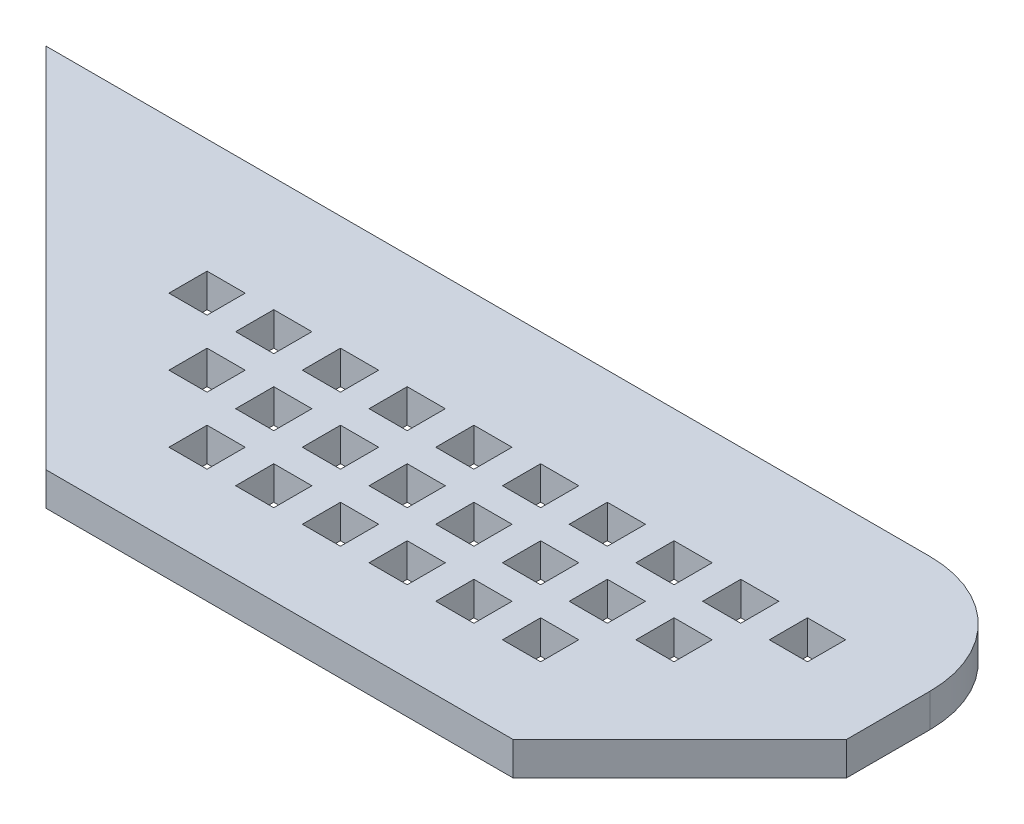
ISO-10303-21;
HEADER;
FILE_DESCRIPTION(('STEP AP214'),'2;1');
FILE_NAME('part.step','',(''),(''),'','','');
FILE_SCHEMA(('AUTOMOTIVE_DESIGN { 1 0 10303 214 1 1 1 1 }'));
ENDSEC;
DATA;
#1=APPLICATION_CONTEXT('core data for automotive mechanical design processes');
#2=APPLICATION_PROTOCOL_DEFINITION('international standard','automotive_design',2000,#1);
#3=PRODUCT_CONTEXT('',#1,'mechanical');
#4=PRODUCT('Part','Part','',(#3));
#5=PRODUCT_RELATED_PRODUCT_CATEGORY('part','',(#4));
#6=PRODUCT_DEFINITION_FORMATION('','',#4);
#7=PRODUCT_DEFINITION_CONTEXT('part definition',#1,'design');
#8=PRODUCT_DEFINITION('design','',#6,#7);
#9=PRODUCT_DEFINITION_SHAPE('','',#8);
#10=(LENGTH_UNIT() NAMED_UNIT(*) SI_UNIT(.MILLI.,.METRE.));
#11=(NAMED_UNIT(*) PLANE_ANGLE_UNIT() SI_UNIT($,.RADIAN.));
#12=(NAMED_UNIT(*) SI_UNIT($,.STERADIAN.) SOLID_ANGLE_UNIT());
#13=UNCERTAINTY_MEASURE_WITH_UNIT(LENGTH_MEASURE(1.E-05),#10,'distance_accuracy_value','');
#14=(GEOMETRIC_REPRESENTATION_CONTEXT(3) GLOBAL_UNCERTAINTY_ASSIGNED_CONTEXT((#13)) GLOBAL_UNIT_ASSIGNED_CONTEXT((#10,
#11,#12)) REPRESENTATION_CONTEXT('',''));
#15=CARTESIAN_POINT('',(0.,0.,0.));
#16=DIRECTION('',(0.,0.,1.));
#17=DIRECTION('',(1.,0.,0.));
#18=AXIS2_PLACEMENT_3D('',#15,#16,#17);
#19=CARTESIAN_POINT('',(155.,10.,-75.0000000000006));
#20=DIRECTION('',(0.,1.,0.));
#21=DIRECTION('',(0.,0.,1.));
#22=AXIS2_PLACEMENT_3D('',#19,#20,#21);
#23=PLANE('',#22);
#24=DIRECTION('',(0.,0.,1.));
#25=VECTOR('',#24,1.);
#26=CARTESIAN_POINT('',(3.99974731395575,10.,-44.2845239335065));
#27=LINE('',#26,#25);
#28=CARTESIAN_POINT('',(3.99974731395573,10.,-55.7154760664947));
#29=VERTEX_POINT('',#28);
#30=CARTESIAN_POINT('',(3.99974731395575,10.,-44.2845239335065));
#31=VERTEX_POINT('',#30);
#32=EDGE_CURVE('E696',#29,#31,#27,.T.);
#33=ORIENTED_EDGE('',*,*,#32,.T.);
#34=DIRECTION('',(-1.,0.,0.));
#35=VECTOR('',#34,1.);
#36=CARTESIAN_POINT('',(-7.43120481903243,10.,-44.2845239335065));
#37=LINE('',#36,#35);
#38=CARTESIAN_POINT('',(-7.43120481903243,10.,-44.2845239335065));
#39=VERTEX_POINT('',#38);
#40=EDGE_CURVE('E697',#31,#39,#37,.T.);
#41=ORIENTED_EDGE('',*,*,#40,.T.);
#42=DIRECTION('',(0.,0.,-1.));
#43=VECTOR('',#42,1.);
#44=CARTESIAN_POINT('',(-7.43120481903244,10.,-55.7154760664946));
#45=LINE('',#44,#43);
#46=CARTESIAN_POINT('',(-7.43120481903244,10.,-55.7154760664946));
#47=VERTEX_POINT('',#46);
#48=EDGE_CURVE('E701',#39,#47,#45,.T.);
#49=ORIENTED_EDGE('',*,*,#48,.T.);
#50=DIRECTION('',(1.,0.,0.));
#51=VECTOR('',#50,1.);
#52=CARTESIAN_POINT('',(3.99974731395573,10.,-55.7154760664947));
#53=LINE('',#52,#51);
#54=EDGE_CURVE('E704',#47,#29,#53,.T.);
#55=ORIENTED_EDGE('',*,*,#54,.T.);
#56=EDGE_LOOP('',(#33,#41,#49,#55));
#57=FACE_BOUND('',#56,.T.);
#58=DIRECTION('',(0.,0.,1.));
#59=VECTOR('',#58,1.);
#60=CARTESIAN_POINT('',(23.9997473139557,10.,-44.2845239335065));
#61=LINE('',#60,#59);
#62=CARTESIAN_POINT('',(23.9997473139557,10.,-55.7154760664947));
#63=VERTEX_POINT('',#62);
#64=CARTESIAN_POINT('',(23.9997473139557,10.,-44.2845239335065));
#65=VERTEX_POINT('',#64);
#66=EDGE_CURVE('E760',#63,#65,#61,.T.);
#67=ORIENTED_EDGE('',*,*,#66,.T.);
#68=DIRECTION('',(-1.,0.,0.));
#69=VECTOR('',#68,1.);
#70=CARTESIAN_POINT('',(12.5687951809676,10.,-44.2845239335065));
#71=LINE('',#70,#69);
#72=CARTESIAN_POINT('',(12.5687951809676,10.,-44.2845239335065));
#73=VERTEX_POINT('',#72);
#74=EDGE_CURVE('E761',#65,#73,#71,.T.);
#75=ORIENTED_EDGE('',*,*,#74,.T.);
#76=DIRECTION('',(0.,0.,-1.));
#77=VECTOR('',#76,1.);
#78=CARTESIAN_POINT('',(12.5687951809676,10.,-55.7154760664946));
#79=LINE('',#78,#77);
#80=CARTESIAN_POINT('',(12.5687951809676,10.,-55.7154760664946));
#81=VERTEX_POINT('',#80);
#82=EDGE_CURVE('E765',#73,#81,#79,.T.);
#83=ORIENTED_EDGE('',*,*,#82,.T.);
#84=DIRECTION('',(1.,0.,0.));
#85=VECTOR('',#84,1.);
#86=CARTESIAN_POINT('',(23.9997473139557,10.,-55.7154760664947));
#87=LINE('',#86,#85);
#88=EDGE_CURVE('E768',#81,#63,#87,.T.);
#89=ORIENTED_EDGE('',*,*,#88,.T.);
#90=EDGE_LOOP('',(#67,#75,#83,#89));
#91=FACE_BOUND('',#90,.T.);
#92=DIRECTION('',(0.,0.,1.));
#93=VECTOR('',#92,1.);
#94=CARTESIAN_POINT('',(23.9997473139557,10.,-24.2845239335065));
#95=LINE('',#94,#93);
#96=CARTESIAN_POINT('',(23.9997473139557,10.,-35.7154760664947));
#97=VERTEX_POINT('',#96);
#98=CARTESIAN_POINT('',(23.9997473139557,10.,-24.2845239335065));
#99=VERTEX_POINT('',#98);
#100=EDGE_CURVE('E824',#97,#99,#95,.T.);
#101=ORIENTED_EDGE('',*,*,#100,.T.);
#102=DIRECTION('',(-1.,0.,0.));
#103=VECTOR('',#102,1.);
#104=CARTESIAN_POINT('',(12.5687951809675,10.,-24.2845239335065));
#105=LINE('',#104,#103);
#106=CARTESIAN_POINT('',(12.5687951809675,10.,-24.2845239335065));
#107=VERTEX_POINT('',#106);
#108=EDGE_CURVE('E825',#99,#107,#105,.T.);
#109=ORIENTED_EDGE('',*,*,#108,.T.);
#110=DIRECTION('',(0.,0.,-1.));
#111=VECTOR('',#110,1.);
#112=CARTESIAN_POINT('',(12.5687951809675,10.,-35.7154760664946));
#113=LINE('',#112,#111);
#114=CARTESIAN_POINT('',(12.5687951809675,10.,-35.7154760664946));
#115=VERTEX_POINT('',#114);
#116=EDGE_CURVE('E829',#107,#115,#113,.T.);
#117=ORIENTED_EDGE('',*,*,#116,.T.);
#118=DIRECTION('',(1.,0.,0.));
#119=VECTOR('',#118,1.);
#120=CARTESIAN_POINT('',(23.9997473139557,10.,-35.7154760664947));
#121=LINE('',#120,#119);
#122=EDGE_CURVE('E832',#115,#97,#121,.T.);
#123=ORIENTED_EDGE('',*,*,#122,.T.);
#124=EDGE_LOOP('',(#101,#109,#117,#123));
#125=FACE_BOUND('',#124,.T.);
#126=DIRECTION('',(0.,0.,1.));
#127=VECTOR('',#126,1.);
#128=CARTESIAN_POINT('',(43.9997473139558,10.,-64.2845239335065));
#129=LINE('',#128,#127);
#130=CARTESIAN_POINT('',(43.9997473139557,10.,-75.7154760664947));
#131=VERTEX_POINT('',#130);
#132=CARTESIAN_POINT('',(43.9997473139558,10.,-64.2845239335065));
#133=VERTEX_POINT('',#132);
#134=EDGE_CURVE('E888',#131,#133,#129,.T.);
#135=ORIENTED_EDGE('',*,*,#134,.T.);
#136=DIRECTION('',(-1.,0.,0.));
#137=VECTOR('',#136,1.);
#138=CARTESIAN_POINT('',(32.5687951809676,10.,-64.2845239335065));
#139=LINE('',#138,#137);
#140=CARTESIAN_POINT('',(32.5687951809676,10.,-64.2845239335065));
#141=VERTEX_POINT('',#140);
#142=EDGE_CURVE('E889',#133,#141,#139,.T.);
#143=ORIENTED_EDGE('',*,*,#142,.T.);
#144=DIRECTION('',(0.,0.,-1.));
#145=VECTOR('',#144,1.);
#146=CARTESIAN_POINT('',(32.5687951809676,10.,-75.7154760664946));
#147=LINE('',#146,#145);
#148=CARTESIAN_POINT('',(32.5687951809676,10.,-75.7154760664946));
#149=VERTEX_POINT('',#148);
#150=EDGE_CURVE('E893',#141,#149,#147,.T.);
#151=ORIENTED_EDGE('',*,*,#150,.T.);
#152=DIRECTION('',(1.,0.,0.));
#153=VECTOR('',#152,1.);
#154=CARTESIAN_POINT('',(43.9997473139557,10.,-75.7154760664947));
#155=LINE('',#154,#153);
#156=EDGE_CURVE('E896',#149,#131,#155,.T.);
#157=ORIENTED_EDGE('',*,*,#156,.T.);
#158=EDGE_LOOP('',(#135,#143,#151,#157));
#159=FACE_BOUND('',#158,.T.);
#160=DIRECTION('',(0.,0.,1.));
#161=VECTOR('',#160,1.);
#162=CARTESIAN_POINT('',(63.9997473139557,10.,-44.2845239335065));
#163=LINE('',#162,#161);
#164=CARTESIAN_POINT('',(63.9997473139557,10.,-55.7154760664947));
#165=VERTEX_POINT('',#164);
#166=CARTESIAN_POINT('',(63.9997473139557,10.,-44.2845239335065));
#167=VERTEX_POINT('',#166);
#168=EDGE_CURVE('E952',#165,#167,#163,.T.);
#169=ORIENTED_EDGE('',*,*,#168,.T.);
#170=DIRECTION('',(-1.,0.,0.));
#171=VECTOR('',#170,1.);
#172=CARTESIAN_POINT('',(52.5687951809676,10.,-44.2845239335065));
#173=LINE('',#172,#171);
#174=CARTESIAN_POINT('',(52.5687951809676,10.,-44.2845239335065));
#175=VERTEX_POINT('',#174);
#176=EDGE_CURVE('E953',#167,#175,#173,.T.);
#177=ORIENTED_EDGE('',*,*,#176,.T.);
#178=DIRECTION('',(0.,0.,-1.));
#179=VECTOR('',#178,1.);
#180=CARTESIAN_POINT('',(52.5687951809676,10.,-55.7154760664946));
#181=LINE('',#180,#179);
#182=CARTESIAN_POINT('',(52.5687951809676,10.,-55.7154760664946));
#183=VERTEX_POINT('',#182);
#184=EDGE_CURVE('E957',#175,#183,#181,.T.);
#185=ORIENTED_EDGE('',*,*,#184,.T.);
#186=DIRECTION('',(1.,0.,0.));
#187=VECTOR('',#186,1.);
#188=CARTESIAN_POINT('',(63.9997473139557,10.,-55.7154760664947));
#189=LINE('',#188,#187);
#190=EDGE_CURVE('E960',#183,#165,#189,.T.);
#191=ORIENTED_EDGE('',*,*,#190,.T.);
#192=EDGE_LOOP('',(#169,#177,#185,#191));
#193=FACE_BOUND('',#192,.T.);
#194=DIRECTION('',(0.,0.,1.));
#195=VECTOR('',#194,1.);
#196=CARTESIAN_POINT('',(63.9997473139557,10.,-24.2845239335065));
#197=LINE('',#196,#195);
#198=CARTESIAN_POINT('',(63.9997473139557,10.,-35.7154760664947));
#199=VERTEX_POINT('',#198);
#200=CARTESIAN_POINT('',(63.9997473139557,10.,-24.2845239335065));
#201=VERTEX_POINT('',#200);
#202=EDGE_CURVE('E1016',#199,#201,#197,.T.);
#203=ORIENTED_EDGE('',*,*,#202,.T.);
#204=DIRECTION('',(-1.,0.,0.));
#205=VECTOR('',#204,1.);
#206=CARTESIAN_POINT('',(52.5687951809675,10.,-24.2845239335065));
#207=LINE('',#206,#205);
#208=CARTESIAN_POINT('',(52.5687951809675,10.,-24.2845239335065));
#209=VERTEX_POINT('',#208);
#210=EDGE_CURVE('E1017',#201,#209,#207,.T.);
#211=ORIENTED_EDGE('',*,*,#210,.T.);
#212=DIRECTION('',(0.,0.,-1.));
#213=VECTOR('',#212,1.);
#214=CARTESIAN_POINT('',(52.5687951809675,10.,-35.7154760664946));
#215=LINE('',#214,#213);
#216=CARTESIAN_POINT('',(52.5687951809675,10.,-35.7154760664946));
#217=VERTEX_POINT('',#216);
#218=EDGE_CURVE('E1021',#209,#217,#215,.T.);
#219=ORIENTED_EDGE('',*,*,#218,.T.);
#220=DIRECTION('',(1.,0.,0.));
#221=VECTOR('',#220,1.);
#222=CARTESIAN_POINT('',(63.9997473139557,10.,-35.7154760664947));
#223=LINE('',#222,#221);
#224=EDGE_CURVE('E1024',#217,#199,#223,.T.);
#225=ORIENTED_EDGE('',*,*,#224,.T.);
#226=EDGE_LOOP('',(#203,#211,#219,#225));
#227=FACE_BOUND('',#226,.T.);
#228=DIRECTION('',(0.,0.,1.));
#229=VECTOR('',#228,1.);
#230=CARTESIAN_POINT('',(83.9997473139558,10.,-64.2845239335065));
#231=LINE('',#230,#229);
#232=CARTESIAN_POINT('',(83.9997473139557,10.,-75.7154760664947));
#233=VERTEX_POINT('',#232);
#234=CARTESIAN_POINT('',(83.9997473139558,10.,-64.2845239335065));
#235=VERTEX_POINT('',#234);
#236=EDGE_CURVE('E1080',#233,#235,#231,.T.);
#237=ORIENTED_EDGE('',*,*,#236,.T.);
#238=DIRECTION('',(-1.,0.,0.));
#239=VECTOR('',#238,1.);
#240=CARTESIAN_POINT('',(72.5687951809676,10.,-64.2845239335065));
#241=LINE('',#240,#239);
#242=CARTESIAN_POINT('',(72.5687951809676,10.,-64.2845239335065));
#243=VERTEX_POINT('',#242);
#244=EDGE_CURVE('E1081',#235,#243,#241,.T.);
#245=ORIENTED_EDGE('',*,*,#244,.T.);
#246=DIRECTION('',(0.,0.,-1.));
#247=VECTOR('',#246,1.);
#248=CARTESIAN_POINT('',(72.5687951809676,10.,-75.7154760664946));
#249=LINE('',#248,#247);
#250=CARTESIAN_POINT('',(72.5687951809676,10.,-75.7154760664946));
#251=VERTEX_POINT('',#250);
#252=EDGE_CURVE('E1085',#243,#251,#249,.T.);
#253=ORIENTED_EDGE('',*,*,#252,.T.);
#254=DIRECTION('',(1.,0.,0.));
#255=VECTOR('',#254,1.);
#256=CARTESIAN_POINT('',(83.9997473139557,10.,-75.7154760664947));
#257=LINE('',#256,#255);
#258=EDGE_CURVE('E1088',#251,#233,#257,.T.);
#259=ORIENTED_EDGE('',*,*,#258,.T.);
#260=EDGE_LOOP('',(#237,#245,#253,#259));
#261=FACE_BOUND('',#260,.T.);
#262=DIRECTION('',(0.,0.,1.));
#263=VECTOR('',#262,1.);
#264=CARTESIAN_POINT('',(103.999747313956,10.,-44.2845239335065));
#265=LINE('',#264,#263);
#266=CARTESIAN_POINT('',(103.999747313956,10.,-55.7154760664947));
#267=VERTEX_POINT('',#266);
#268=CARTESIAN_POINT('',(103.999747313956,10.,-44.2845239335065));
#269=VERTEX_POINT('',#268);
#270=EDGE_CURVE('E1144',#267,#269,#265,.T.);
#271=ORIENTED_EDGE('',*,*,#270,.T.);
#272=DIRECTION('',(-1.,0.,0.));
#273=VECTOR('',#272,1.);
#274=CARTESIAN_POINT('',(92.5687951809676,10.,-44.2845239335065));
#275=LINE('',#274,#273);
#276=CARTESIAN_POINT('',(92.5687951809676,10.,-44.2845239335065));
#277=VERTEX_POINT('',#276);
#278=EDGE_CURVE('E1145',#269,#277,#275,.T.);
#279=ORIENTED_EDGE('',*,*,#278,.T.);
#280=DIRECTION('',(0.,0.,-1.));
#281=VECTOR('',#280,1.);
#282=CARTESIAN_POINT('',(92.5687951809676,10.,-55.7154760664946));
#283=LINE('',#282,#281);
#284=CARTESIAN_POINT('',(92.5687951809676,10.,-55.7154760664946));
#285=VERTEX_POINT('',#284);
#286=EDGE_CURVE('E1149',#277,#285,#283,.T.);
#287=ORIENTED_EDGE('',*,*,#286,.T.);
#288=DIRECTION('',(1.,0.,0.));
#289=VECTOR('',#288,1.);
#290=CARTESIAN_POINT('',(103.999747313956,10.,-55.7154760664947));
#291=LINE('',#290,#289);
#292=EDGE_CURVE('E1152',#285,#267,#291,.T.);
#293=ORIENTED_EDGE('',*,*,#292,.T.);
#294=EDGE_LOOP('',(#271,#279,#287,#293));
#295=FACE_BOUND('',#294,.T.);
#296=DIRECTION('',(0.,0.,1.));
#297=VECTOR('',#296,1.);
#298=CARTESIAN_POINT('',(103.999747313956,10.,-24.2845239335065));
#299=LINE('',#298,#297);
#300=CARTESIAN_POINT('',(103.999747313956,10.,-35.7154760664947));
#301=VERTEX_POINT('',#300);
#302=CARTESIAN_POINT('',(103.999747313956,10.,-24.2845239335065));
#303=VERTEX_POINT('',#302);
#304=EDGE_CURVE('E1208',#301,#303,#299,.T.);
#305=ORIENTED_EDGE('',*,*,#304,.T.);
#306=DIRECTION('',(-1.,0.,0.));
#307=VECTOR('',#306,1.);
#308=CARTESIAN_POINT('',(92.5687951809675,10.,-24.2845239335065));
#309=LINE('',#308,#307);
#310=CARTESIAN_POINT('',(92.5687951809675,10.,-24.2845239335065));
#311=VERTEX_POINT('',#310);
#312=EDGE_CURVE('E1209',#303,#311,#309,.T.);
#313=ORIENTED_EDGE('',*,*,#312,.T.);
#314=DIRECTION('',(0.,0.,-1.));
#315=VECTOR('',#314,1.);
#316=CARTESIAN_POINT('',(92.5687951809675,10.,-35.7154760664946));
#317=LINE('',#316,#315);
#318=CARTESIAN_POINT('',(92.5687951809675,10.,-35.7154760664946));
#319=VERTEX_POINT('',#318);
#320=EDGE_CURVE('E1213',#311,#319,#317,.T.);
#321=ORIENTED_EDGE('',*,*,#320,.T.);
#322=DIRECTION('',(1.,0.,0.));
#323=VECTOR('',#322,1.);
#324=CARTESIAN_POINT('',(103.999747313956,10.,-35.7154760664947));
#325=LINE('',#324,#323);
#326=EDGE_CURVE('E1216',#319,#301,#325,.T.);
#327=ORIENTED_EDGE('',*,*,#326,.T.);
#328=EDGE_LOOP('',(#305,#313,#321,#327));
#329=FACE_BOUND('',#328,.T.);
#330=DIRECTION('',(0.,0.,1.));
#331=VECTOR('',#330,1.);
#332=CARTESIAN_POINT('',(123.999747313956,10.,-64.2845239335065));
#333=LINE('',#332,#331);
#334=CARTESIAN_POINT('',(123.999747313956,10.,-75.7154760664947));
#335=VERTEX_POINT('',#334);
#336=CARTESIAN_POINT('',(123.999747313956,10.,-64.2845239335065));
#337=VERTEX_POINT('',#336);
#338=EDGE_CURVE('E1272',#335,#337,#333,.T.);
#339=ORIENTED_EDGE('',*,*,#338,.T.);
#340=DIRECTION('',(-1.,0.,0.));
#341=VECTOR('',#340,1.);
#342=CARTESIAN_POINT('',(112.568795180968,10.,-64.2845239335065));
#343=LINE('',#342,#341);
#344=CARTESIAN_POINT('',(112.568795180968,10.,-64.2845239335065));
#345=VERTEX_POINT('',#344);
#346=EDGE_CURVE('E1273',#337,#345,#343,.T.);
#347=ORIENTED_EDGE('',*,*,#346,.T.);
#348=DIRECTION('',(0.,0.,-1.));
#349=VECTOR('',#348,1.);
#350=CARTESIAN_POINT('',(112.568795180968,10.,-75.7154760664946));
#351=LINE('',#350,#349);
#352=CARTESIAN_POINT('',(112.568795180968,10.,-75.7154760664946));
#353=VERTEX_POINT('',#352);
#354=EDGE_CURVE('E1277',#345,#353,#351,.T.);
#355=ORIENTED_EDGE('',*,*,#354,.T.);
#356=DIRECTION('',(1.,0.,0.));
#357=VECTOR('',#356,1.);
#358=CARTESIAN_POINT('',(123.999747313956,10.,-75.7154760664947));
#359=LINE('',#358,#357);
#360=EDGE_CURVE('E1280',#353,#335,#359,.T.);
#361=ORIENTED_EDGE('',*,*,#360,.T.);
#362=EDGE_LOOP('',(#339,#347,#355,#361));
#363=FACE_BOUND('',#362,.T.);
#364=DIRECTION('',(0.,0.,1.));
#365=VECTOR('',#364,1.);
#366=CARTESIAN_POINT('',(143.999747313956,10.,-44.2845239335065));
#367=LINE('',#366,#365);
#368=CARTESIAN_POINT('',(143.999747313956,10.,-55.7154760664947));
#369=VERTEX_POINT('',#368);
#370=CARTESIAN_POINT('',(143.999747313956,10.,-44.2845239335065));
#371=VERTEX_POINT('',#370);
#372=EDGE_CURVE('E1336',#369,#371,#367,.T.);
#373=ORIENTED_EDGE('',*,*,#372,.T.);
#374=DIRECTION('',(-1.,0.,0.));
#375=VECTOR('',#374,1.);
#376=CARTESIAN_POINT('',(132.568795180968,10.,-44.2845239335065));
#377=LINE('',#376,#375);
#378=CARTESIAN_POINT('',(132.568795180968,10.,-44.2845239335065));
#379=VERTEX_POINT('',#378);
#380=EDGE_CURVE('E1337',#371,#379,#377,.T.);
#381=ORIENTED_EDGE('',*,*,#380,.T.);
#382=DIRECTION('',(0.,0.,-1.));
#383=VECTOR('',#382,1.);
#384=CARTESIAN_POINT('',(132.568795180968,10.,-55.7154760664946));
#385=LINE('',#384,#383);
#386=CARTESIAN_POINT('',(132.568795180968,10.,-55.7154760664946));
#387=VERTEX_POINT('',#386);
#388=EDGE_CURVE('E1341',#379,#387,#385,.T.);
#389=ORIENTED_EDGE('',*,*,#388,.T.);
#390=DIRECTION('',(1.,0.,0.));
#391=VECTOR('',#390,1.);
#392=CARTESIAN_POINT('',(143.999747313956,10.,-55.7154760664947));
#393=LINE('',#392,#391);
#394=EDGE_CURVE('E1344',#387,#369,#393,.T.);
#395=ORIENTED_EDGE('',*,*,#394,.T.);
#396=EDGE_LOOP('',(#373,#381,#389,#395));
#397=FACE_BOUND('',#396,.T.);
#398=DIRECTION('',(0.,0.,1.));
#399=VECTOR('',#398,1.);
#400=CARTESIAN_POINT('',(163.999747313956,10.,-64.2845239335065));
#401=LINE('',#400,#399);
#402=CARTESIAN_POINT('',(163.999747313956,10.,-75.7154760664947));
#403=VERTEX_POINT('',#402);
#404=CARTESIAN_POINT('',(163.999747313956,10.,-64.2845239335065));
#405=VERTEX_POINT('',#404);
#406=EDGE_CURVE('E1400',#403,#405,#401,.T.);
#407=ORIENTED_EDGE('',*,*,#406,.T.);
#408=DIRECTION('',(-1.,0.,0.));
#409=VECTOR('',#408,1.);
#410=CARTESIAN_POINT('',(152.568795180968,10.,-64.2845239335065));
#411=LINE('',#410,#409);
#412=CARTESIAN_POINT('',(152.568795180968,10.,-64.2845239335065));
#413=VERTEX_POINT('',#412);
#414=EDGE_CURVE('E1401',#405,#413,#411,.T.);
#415=ORIENTED_EDGE('',*,*,#414,.T.);
#416=DIRECTION('',(0.,0.,-1.));
#417=VECTOR('',#416,1.);
#418=CARTESIAN_POINT('',(152.568795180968,10.,-75.7154760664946));
#419=LINE('',#418,#417);
#420=CARTESIAN_POINT('',(152.568795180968,10.,-75.7154760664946));
#421=VERTEX_POINT('',#420);
#422=EDGE_CURVE('E1405',#413,#421,#419,.T.);
#423=ORIENTED_EDGE('',*,*,#422,.T.);
#424=DIRECTION('',(1.,0.,0.));
#425=VECTOR('',#424,1.);
#426=CARTESIAN_POINT('',(163.999747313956,10.,-75.7154760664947));
#427=LINE('',#426,#425);
#428=EDGE_CURVE('E1408',#421,#403,#427,.T.);
#429=ORIENTED_EDGE('',*,*,#428,.T.);
#430=EDGE_LOOP('',(#407,#415,#423,#429));
#431=FACE_BOUND('',#430,.T.);
#432=DIRECTION('',(0.707106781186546,0.,0.707106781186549));
#433=VECTOR('',#432,1.);
#434=CARTESIAN_POINT('',(-110.,10.,-110.000000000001));
#435=LINE('',#434,#433);
#436=CARTESIAN_POINT('',(-110.,10.,-110.000000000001));
#437=VERTEX_POINT('',#436);
#438=CARTESIAN_POINT('',(0.,10.,0.));
#439=VERTEX_POINT('',#438);
#440=EDGE_CURVE('E1445',#437,#439,#435,.T.);
#441=ORIENTED_EDGE('',*,*,#440,.T.);
#442=DIRECTION('',(1.,0.,0.));
#443=VECTOR('',#442,1.);
#444=CARTESIAN_POINT('',(0.,10.,0.));
#445=LINE('',#444,#443);
#446=CARTESIAN_POINT('',(140.,10.,0.));
#447=VERTEX_POINT('',#446);
#448=EDGE_CURVE('E1448',#439,#447,#445,.T.);
#449=ORIENTED_EDGE('',*,*,#448,.T.);
#450=DIRECTION('',(0.707106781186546,0.,-0.707106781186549));
#451=VECTOR('',#450,1.);
#452=CARTESIAN_POINT('',(140.,10.,0.));
#453=LINE('',#452,#451);
#454=CARTESIAN_POINT('',(190.,10.,-50.));
#455=VERTEX_POINT('',#454);
#456=EDGE_CURVE('E1450',#447,#455,#453,.T.);
#457=ORIENTED_EDGE('',*,*,#456,.T.);
#458=DIRECTION('',(0.,0.,-1.));
#459=VECTOR('',#458,1.);
#460=CARTESIAN_POINT('',(190.,10.,-50.));
#461=LINE('',#460,#459);
#462=CARTESIAN_POINT('',(190.,10.,-75.0000000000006));
#463=VERTEX_POINT('',#462);
#464=EDGE_CURVE('E1452',#455,#463,#461,.T.);
#465=ORIENTED_EDGE('',*,*,#464,.T.);
#466=CARTESIAN_POINT('',(155.,10.,-75.0000000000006));
#467=DIRECTION('',(0.,1.,0.));
#468=DIRECTION('',(0.,0.,1.));
#469=AXIS2_PLACEMENT_3D('',#466,#467,#468);
#470=CIRCLE('',#469,35.);
#471=CARTESIAN_POINT('',(155.,10.,-110.000000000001));
#472=VERTEX_POINT('',#471);
#473=EDGE_CURVE('E1454',#463,#472,#470,.T.);
#474=ORIENTED_EDGE('',*,*,#473,.T.);
#475=DIRECTION('',(-1.,0.,0.));
#476=VECTOR('',#475,1.);
#477=CARTESIAN_POINT('',(155.,10.,-110.000000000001));
#478=LINE('',#477,#476);
#479=EDGE_CURVE('E1456',#472,#437,#478,.T.);
#480=ORIENTED_EDGE('',*,*,#479,.T.);
#481=EDGE_LOOP('',(#441,#449,#457,#465,#474,#480));
#482=FACE_BOUND('',#481,.T.);
#483=DIRECTION('',(0.,0.,1.));
#484=VECTOR('',#483,1.);
#485=CARTESIAN_POINT('',(143.999747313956,10.,-64.2845239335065));
#486=LINE('',#485,#484);
#487=CARTESIAN_POINT('',(143.999747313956,10.,-75.7154760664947));
#488=VERTEX_POINT('',#487);
#489=CARTESIAN_POINT('',(143.999747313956,10.,-64.2845239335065));
#490=VERTEX_POINT('',#489);
#491=EDGE_CURVE('E1368',#488,#490,#486,.T.);
#492=ORIENTED_EDGE('',*,*,#491,.T.);
#493=DIRECTION('',(-1.,0.,0.));
#494=VECTOR('',#493,1.);
#495=CARTESIAN_POINT('',(132.568795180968,10.,-64.2845239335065));
#496=LINE('',#495,#494);
#497=CARTESIAN_POINT('',(132.568795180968,10.,-64.2845239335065));
#498=VERTEX_POINT('',#497);
#499=EDGE_CURVE('E1369',#490,#498,#496,.T.);
#500=ORIENTED_EDGE('',*,*,#499,.T.);
#501=DIRECTION('',(0.,0.,-1.));
#502=VECTOR('',#501,1.);
#503=CARTESIAN_POINT('',(132.568795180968,10.,-75.7154760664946));
#504=LINE('',#503,#502);
#505=CARTESIAN_POINT('',(132.568795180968,10.,-75.7154760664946));
#506=VERTEX_POINT('',#505);
#507=EDGE_CURVE('E1373',#498,#506,#504,.T.);
#508=ORIENTED_EDGE('',*,*,#507,.T.);
#509=DIRECTION('',(1.,0.,0.));
#510=VECTOR('',#509,1.);
#511=CARTESIAN_POINT('',(143.999747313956,10.,-75.7154760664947));
#512=LINE('',#511,#510);
#513=EDGE_CURVE('E1376',#506,#488,#512,.T.);
#514=ORIENTED_EDGE('',*,*,#513,.T.);
#515=EDGE_LOOP('',(#492,#500,#508,#514));
#516=FACE_BOUND('',#515,.T.);
#517=DIRECTION('',(0.,0.,1.));
#518=VECTOR('',#517,1.);
#519=CARTESIAN_POINT('',(123.999747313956,10.,-24.2845239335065));
#520=LINE('',#519,#518);
#521=CARTESIAN_POINT('',(123.999747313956,10.,-35.7154760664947));
#522=VERTEX_POINT('',#521);
#523=CARTESIAN_POINT('',(123.999747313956,10.,-24.2845239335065));
#524=VERTEX_POINT('',#523);
#525=EDGE_CURVE('E1304',#522,#524,#520,.T.);
#526=ORIENTED_EDGE('',*,*,#525,.T.);
#527=DIRECTION('',(-1.,0.,0.));
#528=VECTOR('',#527,1.);
#529=CARTESIAN_POINT('',(112.568795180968,10.,-24.2845239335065));
#530=LINE('',#529,#528);
#531=CARTESIAN_POINT('',(112.568795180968,10.,-24.2845239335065));
#532=VERTEX_POINT('',#531);
#533=EDGE_CURVE('E1305',#524,#532,#530,.T.);
#534=ORIENTED_EDGE('',*,*,#533,.T.);
#535=DIRECTION('',(0.,0.,-1.));
#536=VECTOR('',#535,1.);
#537=CARTESIAN_POINT('',(112.568795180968,10.,-35.7154760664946));
#538=LINE('',#537,#536);
#539=CARTESIAN_POINT('',(112.568795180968,10.,-35.7154760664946));
#540=VERTEX_POINT('',#539);
#541=EDGE_CURVE('E1309',#532,#540,#538,.T.);
#542=ORIENTED_EDGE('',*,*,#541,.T.);
#543=DIRECTION('',(1.,0.,0.));
#544=VECTOR('',#543,1.);
#545=CARTESIAN_POINT('',(123.999747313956,10.,-35.7154760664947));
#546=LINE('',#545,#544);
#547=EDGE_CURVE('E1312',#540,#522,#546,.T.);
#548=ORIENTED_EDGE('',*,*,#547,.T.);
#549=EDGE_LOOP('',(#526,#534,#542,#548));
#550=FACE_BOUND('',#549,.T.);
#551=DIRECTION('',(0.,0.,1.));
#552=VECTOR('',#551,1.);
#553=CARTESIAN_POINT('',(123.999747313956,10.,-44.2845239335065));
#554=LINE('',#553,#552);
#555=CARTESIAN_POINT('',(123.999747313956,10.,-55.7154760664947));
#556=VERTEX_POINT('',#555);
#557=CARTESIAN_POINT('',(123.999747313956,10.,-44.2845239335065));
#558=VERTEX_POINT('',#557);
#559=EDGE_CURVE('E1240',#556,#558,#554,.T.);
#560=ORIENTED_EDGE('',*,*,#559,.T.);
#561=DIRECTION('',(-1.,0.,0.));
#562=VECTOR('',#561,1.);
#563=CARTESIAN_POINT('',(112.568795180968,10.,-44.2845239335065));
#564=LINE('',#563,#562);
#565=CARTESIAN_POINT('',(112.568795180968,10.,-44.2845239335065));
#566=VERTEX_POINT('',#565);
#567=EDGE_CURVE('E1241',#558,#566,#564,.T.);
#568=ORIENTED_EDGE('',*,*,#567,.T.);
#569=DIRECTION('',(0.,0.,-1.));
#570=VECTOR('',#569,1.);
#571=CARTESIAN_POINT('',(112.568795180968,10.,-55.7154760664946));
#572=LINE('',#571,#570);
#573=CARTESIAN_POINT('',(112.568795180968,10.,-55.7154760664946));
#574=VERTEX_POINT('',#573);
#575=EDGE_CURVE('E1245',#566,#574,#572,.T.);
#576=ORIENTED_EDGE('',*,*,#575,.T.);
#577=DIRECTION('',(1.,0.,0.));
#578=VECTOR('',#577,1.);
#579=CARTESIAN_POINT('',(123.999747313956,10.,-55.7154760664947));
#580=LINE('',#579,#578);
#581=EDGE_CURVE('E1248',#574,#556,#580,.T.);
#582=ORIENTED_EDGE('',*,*,#581,.T.);
#583=EDGE_LOOP('',(#560,#568,#576,#582));
#584=FACE_BOUND('',#583,.T.);
#585=DIRECTION('',(0.,0.,1.));
#586=VECTOR('',#585,1.);
#587=CARTESIAN_POINT('',(103.999747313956,10.,-64.2845239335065));
#588=LINE('',#587,#586);
#589=CARTESIAN_POINT('',(103.999747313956,10.,-75.7154760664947));
#590=VERTEX_POINT('',#589);
#591=CARTESIAN_POINT('',(103.999747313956,10.,-64.2845239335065));
#592=VERTEX_POINT('',#591);
#593=EDGE_CURVE('E1176',#590,#592,#588,.T.);
#594=ORIENTED_EDGE('',*,*,#593,.T.);
#595=DIRECTION('',(-1.,0.,0.));
#596=VECTOR('',#595,1.);
#597=CARTESIAN_POINT('',(92.5687951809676,10.,-64.2845239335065));
#598=LINE('',#597,#596);
#599=CARTESIAN_POINT('',(92.5687951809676,10.,-64.2845239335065));
#600=VERTEX_POINT('',#599);
#601=EDGE_CURVE('E1177',#592,#600,#598,.T.);
#602=ORIENTED_EDGE('',*,*,#601,.T.);
#603=DIRECTION('',(0.,0.,-1.));
#604=VECTOR('',#603,1.);
#605=CARTESIAN_POINT('',(92.5687951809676,10.,-75.7154760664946));
#606=LINE('',#605,#604);
#607=CARTESIAN_POINT('',(92.5687951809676,10.,-75.7154760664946));
#608=VERTEX_POINT('',#607);
#609=EDGE_CURVE('E1181',#600,#608,#606,.T.);
#610=ORIENTED_EDGE('',*,*,#609,.T.);
#611=DIRECTION('',(1.,0.,0.));
#612=VECTOR('',#611,1.);
#613=CARTESIAN_POINT('',(103.999747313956,10.,-75.7154760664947));
#614=LINE('',#613,#612);
#615=EDGE_CURVE('E1184',#608,#590,#614,.T.);
#616=ORIENTED_EDGE('',*,*,#615,.T.);
#617=EDGE_LOOP('',(#594,#602,#610,#616));
#618=FACE_BOUND('',#617,.T.);
#619=DIRECTION('',(0.,0.,1.));
#620=VECTOR('',#619,1.);
#621=CARTESIAN_POINT('',(83.9997473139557,10.,-24.2845239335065));
#622=LINE('',#621,#620);
#623=CARTESIAN_POINT('',(83.9997473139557,10.,-35.7154760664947));
#624=VERTEX_POINT('',#623);
#625=CARTESIAN_POINT('',(83.9997473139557,10.,-24.2845239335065));
#626=VERTEX_POINT('',#625);
#627=EDGE_CURVE('E1112',#624,#626,#622,.T.);
#628=ORIENTED_EDGE('',*,*,#627,.T.);
#629=DIRECTION('',(-1.,0.,0.));
#630=VECTOR('',#629,1.);
#631=CARTESIAN_POINT('',(72.5687951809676,10.,-24.2845239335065));
#632=LINE('',#631,#630);
#633=CARTESIAN_POINT('',(72.5687951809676,10.,-24.2845239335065));
#634=VERTEX_POINT('',#633);
#635=EDGE_CURVE('E1113',#626,#634,#632,.T.);
#636=ORIENTED_EDGE('',*,*,#635,.T.);
#637=DIRECTION('',(0.,0.,-1.));
#638=VECTOR('',#637,1.);
#639=CARTESIAN_POINT('',(72.5687951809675,10.,-35.7154760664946));
#640=LINE('',#639,#638);
#641=CARTESIAN_POINT('',(72.5687951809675,10.,-35.7154760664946));
#642=VERTEX_POINT('',#641);
#643=EDGE_CURVE('E1117',#634,#642,#640,.T.);
#644=ORIENTED_EDGE('',*,*,#643,.T.);
#645=DIRECTION('',(1.,0.,0.));
#646=VECTOR('',#645,1.);
#647=CARTESIAN_POINT('',(83.9997473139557,10.,-35.7154760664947));
#648=LINE('',#647,#646);
#649=EDGE_CURVE('E1120',#642,#624,#648,.T.);
#650=ORIENTED_EDGE('',*,*,#649,.T.);
#651=EDGE_LOOP('',(#628,#636,#644,#650));
#652=FACE_BOUND('',#651,.T.);
#653=DIRECTION('',(0.,0.,1.));
#654=VECTOR('',#653,1.);
#655=CARTESIAN_POINT('',(83.9997473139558,10.,-44.2845239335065));
#656=LINE('',#655,#654);
#657=CARTESIAN_POINT('',(83.9997473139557,10.,-55.7154760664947));
#658=VERTEX_POINT('',#657);
#659=CARTESIAN_POINT('',(83.9997473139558,10.,-44.2845239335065));
#660=VERTEX_POINT('',#659);
#661=EDGE_CURVE('E1048',#658,#660,#656,.T.);
#662=ORIENTED_EDGE('',*,*,#661,.T.);
#663=DIRECTION('',(-1.,0.,0.));
#664=VECTOR('',#663,1.);
#665=CARTESIAN_POINT('',(72.5687951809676,10.,-44.2845239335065));
#666=LINE('',#665,#664);
#667=CARTESIAN_POINT('',(72.5687951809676,10.,-44.2845239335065));
#668=VERTEX_POINT('',#667);
#669=EDGE_CURVE('E1049',#660,#668,#666,.T.);
#670=ORIENTED_EDGE('',*,*,#669,.T.);
#671=DIRECTION('',(0.,0.,-1.));
#672=VECTOR('',#671,1.);
#673=CARTESIAN_POINT('',(72.5687951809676,10.,-55.7154760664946));
#674=LINE('',#673,#672);
#675=CARTESIAN_POINT('',(72.5687951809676,10.,-55.7154760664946));
#676=VERTEX_POINT('',#675);
#677=EDGE_CURVE('E1053',#668,#676,#674,.T.);
#678=ORIENTED_EDGE('',*,*,#677,.T.);
#679=DIRECTION('',(1.,0.,0.));
#680=VECTOR('',#679,1.);
#681=CARTESIAN_POINT('',(83.9997473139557,10.,-55.7154760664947));
#682=LINE('',#681,#680);
#683=EDGE_CURVE('E1056',#676,#658,#682,.T.);
#684=ORIENTED_EDGE('',*,*,#683,.T.);
#685=EDGE_LOOP('',(#662,#670,#678,#684));
#686=FACE_BOUND('',#685,.T.);
#687=DIRECTION('',(0.,0.,1.));
#688=VECTOR('',#687,1.);
#689=CARTESIAN_POINT('',(63.9997473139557,10.,-64.2845239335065));
#690=LINE('',#689,#688);
#691=CARTESIAN_POINT('',(63.9997473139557,10.,-75.7154760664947));
#692=VERTEX_POINT('',#691);
#693=CARTESIAN_POINT('',(63.9997473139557,10.,-64.2845239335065));
#694=VERTEX_POINT('',#693);
#695=EDGE_CURVE('E984',#692,#694,#690,.T.);
#696=ORIENTED_EDGE('',*,*,#695,.T.);
#697=DIRECTION('',(-1.,0.,0.));
#698=VECTOR('',#697,1.);
#699=CARTESIAN_POINT('',(52.5687951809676,10.,-64.2845239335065));
#700=LINE('',#699,#698);
#701=CARTESIAN_POINT('',(52.5687951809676,10.,-64.2845239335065));
#702=VERTEX_POINT('',#701);
#703=EDGE_CURVE('E985',#694,#702,#700,.T.);
#704=ORIENTED_EDGE('',*,*,#703,.T.);
#705=DIRECTION('',(0.,0.,-1.));
#706=VECTOR('',#705,1.);
#707=CARTESIAN_POINT('',(52.5687951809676,10.,-75.7154760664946));
#708=LINE('',#707,#706);
#709=CARTESIAN_POINT('',(52.5687951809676,10.,-75.7154760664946));
#710=VERTEX_POINT('',#709);
#711=EDGE_CURVE('E989',#702,#710,#708,.T.);
#712=ORIENTED_EDGE('',*,*,#711,.T.);
#713=DIRECTION('',(1.,0.,0.));
#714=VECTOR('',#713,1.);
#715=CARTESIAN_POINT('',(63.9997473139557,10.,-75.7154760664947));
#716=LINE('',#715,#714);
#717=EDGE_CURVE('E992',#710,#692,#716,.T.);
#718=ORIENTED_EDGE('',*,*,#717,.T.);
#719=EDGE_LOOP('',(#696,#704,#712,#718));
#720=FACE_BOUND('',#719,.T.);
#721=DIRECTION('',(0.,0.,1.));
#722=VECTOR('',#721,1.);
#723=CARTESIAN_POINT('',(43.9997473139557,10.,-24.2845239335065));
#724=LINE('',#723,#722);
#725=CARTESIAN_POINT('',(43.9997473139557,10.,-35.7154760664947));
#726=VERTEX_POINT('',#725);
#727=CARTESIAN_POINT('',(43.9997473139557,10.,-24.2845239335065));
#728=VERTEX_POINT('',#727);
#729=EDGE_CURVE('E920',#726,#728,#724,.T.);
#730=ORIENTED_EDGE('',*,*,#729,.T.);
#731=DIRECTION('',(-1.,0.,0.));
#732=VECTOR('',#731,1.);
#733=CARTESIAN_POINT('',(32.5687951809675,10.,-24.2845239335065));
#734=LINE('',#733,#732);
#735=CARTESIAN_POINT('',(32.5687951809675,10.,-24.2845239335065));
#736=VERTEX_POINT('',#735);
#737=EDGE_CURVE('E921',#728,#736,#734,.T.);
#738=ORIENTED_EDGE('',*,*,#737,.T.);
#739=DIRECTION('',(0.,0.,-1.));
#740=VECTOR('',#739,1.);
#741=CARTESIAN_POINT('',(32.5687951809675,10.,-35.7154760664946));
#742=LINE('',#741,#740);
#743=CARTESIAN_POINT('',(32.5687951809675,10.,-35.7154760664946));
#744=VERTEX_POINT('',#743);
#745=EDGE_CURVE('E925',#736,#744,#742,.T.);
#746=ORIENTED_EDGE('',*,*,#745,.T.);
#747=DIRECTION('',(1.,0.,0.));
#748=VECTOR('',#747,1.);
#749=CARTESIAN_POINT('',(43.9997473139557,10.,-35.7154760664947));
#750=LINE('',#749,#748);
#751=EDGE_CURVE('E928',#744,#726,#750,.T.);
#752=ORIENTED_EDGE('',*,*,#751,.T.);
#753=EDGE_LOOP('',(#730,#738,#746,#752));
#754=FACE_BOUND('',#753,.T.);
#755=DIRECTION('',(0.,0.,1.));
#756=VECTOR('',#755,1.);
#757=CARTESIAN_POINT('',(43.9997473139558,10.,-44.2845239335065));
#758=LINE('',#757,#756);
#759=CARTESIAN_POINT('',(43.9997473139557,10.,-55.7154760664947));
#760=VERTEX_POINT('',#759);
#761=CARTESIAN_POINT('',(43.9997473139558,10.,-44.2845239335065));
#762=VERTEX_POINT('',#761);
#763=EDGE_CURVE('E856',#760,#762,#758,.T.);
#764=ORIENTED_EDGE('',*,*,#763,.T.);
#765=DIRECTION('',(-1.,0.,0.));
#766=VECTOR('',#765,1.);
#767=CARTESIAN_POINT('',(32.5687951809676,10.,-44.2845239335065));
#768=LINE('',#767,#766);
#769=CARTESIAN_POINT('',(32.5687951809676,10.,-44.2845239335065));
#770=VERTEX_POINT('',#769);
#771=EDGE_CURVE('E857',#762,#770,#768,.T.);
#772=ORIENTED_EDGE('',*,*,#771,.T.);
#773=DIRECTION('',(0.,0.,-1.));
#774=VECTOR('',#773,1.);
#775=CARTESIAN_POINT('',(32.5687951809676,10.,-55.7154760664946));
#776=LINE('',#775,#774);
#777=CARTESIAN_POINT('',(32.5687951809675,10.,-55.7154760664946));
#778=VERTEX_POINT('',#777);
#779=EDGE_CURVE('E861',#770,#778,#776,.T.);
#780=ORIENTED_EDGE('',*,*,#779,.T.);
#781=DIRECTION('',(1.,0.,0.));
#782=VECTOR('',#781,1.);
#783=CARTESIAN_POINT('',(43.9997473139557,10.,-55.7154760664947));
#784=LINE('',#783,#782);
#785=EDGE_CURVE('E864',#778,#760,#784,.T.);
#786=ORIENTED_EDGE('',*,*,#785,.T.);
#787=EDGE_LOOP('',(#764,#772,#780,#786));
#788=FACE_BOUND('',#787,.T.);
#789=DIRECTION('',(0.,0.,1.));
#790=VECTOR('',#789,1.);
#791=CARTESIAN_POINT('',(23.9997473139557,10.,-64.2845239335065));
#792=LINE('',#791,#790);
#793=CARTESIAN_POINT('',(23.9997473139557,10.,-75.7154760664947));
#794=VERTEX_POINT('',#793);
#795=CARTESIAN_POINT('',(23.9997473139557,10.,-64.2845239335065));
#796=VERTEX_POINT('',#795);
#797=EDGE_CURVE('E792',#794,#796,#792,.T.);
#798=ORIENTED_EDGE('',*,*,#797,.T.);
#799=DIRECTION('',(-1.,0.,0.));
#800=VECTOR('',#799,1.);
#801=CARTESIAN_POINT('',(12.5687951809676,10.,-64.2845239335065));
#802=LINE('',#801,#800);
#803=CARTESIAN_POINT('',(12.5687951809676,10.,-64.2845239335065));
#804=VERTEX_POINT('',#803);
#805=EDGE_CURVE('E793',#796,#804,#802,.T.);
#806=ORIENTED_EDGE('',*,*,#805,.T.);
#807=DIRECTION('',(0.,0.,-1.));
#808=VECTOR('',#807,1.);
#809=CARTESIAN_POINT('',(12.5687951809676,10.,-75.7154760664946));
#810=LINE('',#809,#808);
#811=CARTESIAN_POINT('',(12.5687951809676,10.,-75.7154760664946));
#812=VERTEX_POINT('',#811);
#813=EDGE_CURVE('E797',#804,#812,#810,.T.);
#814=ORIENTED_EDGE('',*,*,#813,.T.);
#815=DIRECTION('',(1.,0.,0.));
#816=VECTOR('',#815,1.);
#817=CARTESIAN_POINT('',(23.9997473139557,10.,-75.7154760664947));
#818=LINE('',#817,#816);
#819=EDGE_CURVE('E800',#812,#794,#818,.T.);
#820=ORIENTED_EDGE('',*,*,#819,.T.);
#821=EDGE_LOOP('',(#798,#806,#814,#820));
#822=FACE_BOUND('',#821,.T.);
#823=DIRECTION('',(0.,0.,1.));
#824=VECTOR('',#823,1.);
#825=CARTESIAN_POINT('',(3.99974731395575,10.,-64.2845239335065));
#826=LINE('',#825,#824);
#827=CARTESIAN_POINT('',(3.99974731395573,10.,-75.7154760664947));
#828=VERTEX_POINT('',#827);
#829=CARTESIAN_POINT('',(3.99974731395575,10.,-64.2845239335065));
#830=VERTEX_POINT('',#829);
#831=EDGE_CURVE('E728',#828,#830,#826,.T.);
#832=ORIENTED_EDGE('',*,*,#831,.T.);
#833=DIRECTION('',(-1.,0.,0.));
#834=VECTOR('',#833,1.);
#835=CARTESIAN_POINT('',(-7.43120481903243,10.,-64.2845239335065));
#836=LINE('',#835,#834);
#837=CARTESIAN_POINT('',(-7.43120481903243,10.,-64.2845239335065));
#838=VERTEX_POINT('',#837);
#839=EDGE_CURVE('E729',#830,#838,#836,.T.);
#840=ORIENTED_EDGE('',*,*,#839,.T.);
#841=DIRECTION('',(0.,0.,-1.));
#842=VECTOR('',#841,1.);
#843=CARTESIAN_POINT('',(-7.43120481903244,10.,-75.7154760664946));
#844=LINE('',#843,#842);
#845=CARTESIAN_POINT('',(-7.43120481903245,10.,-75.7154760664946));
#846=VERTEX_POINT('',#845);
#847=EDGE_CURVE('E733',#838,#846,#844,.T.);
#848=ORIENTED_EDGE('',*,*,#847,.T.);
#849=DIRECTION('',(1.,0.,0.));
#850=VECTOR('',#849,1.);
#851=CARTESIAN_POINT('',(3.99974731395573,10.,-75.7154760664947));
#852=LINE('',#851,#850);
#853=EDGE_CURVE('E736',#846,#828,#852,.T.);
#854=ORIENTED_EDGE('',*,*,#853,.T.);
#855=EDGE_LOOP('',(#832,#840,#848,#854));
#856=FACE_BOUND('',#855,.T.);
#857=DIRECTION('',(0.,0.,1.));
#858=VECTOR('',#857,1.);
#859=CARTESIAN_POINT('',(-16.0002526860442,10.,-64.2845239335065));
#860=LINE('',#859,#858);
#861=CARTESIAN_POINT('',(-16.0002526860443,10.,-75.7154760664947));
#862=VERTEX_POINT('',#861);
#863=CARTESIAN_POINT('',(-16.0002526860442,10.,-64.2845239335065));
#864=VERTEX_POINT('',#863);
#865=EDGE_CURVE('E677',#862,#864,#860,.T.);
#866=ORIENTED_EDGE('',*,*,#865,.T.);
#867=DIRECTION('',(-1.,0.,0.));
#868=VECTOR('',#867,1.);
#869=CARTESIAN_POINT('',(-27.4312048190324,10.,-64.2845239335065));
#870=LINE('',#869,#868);
#871=CARTESIAN_POINT('',(-27.4312048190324,10.,-64.2845239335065));
#872=VERTEX_POINT('',#871);
#873=EDGE_CURVE('E664',#864,#872,#870,.T.);
#874=ORIENTED_EDGE('',*,*,#873,.T.);
#875=DIRECTION('',(0.,0.,-1.));
#876=VECTOR('',#875,1.);
#877=CARTESIAN_POINT('',(-27.4312048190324,10.,-75.7154760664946));
#878=LINE('',#877,#876);
#879=CARTESIAN_POINT('',(-27.4312048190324,10.,-75.7154760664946));
#880=VERTEX_POINT('',#879);
#881=EDGE_CURVE('E672',#872,#880,#878,.T.);
#882=ORIENTED_EDGE('',*,*,#881,.T.);
#883=DIRECTION('',(1.,0.,0.));
#884=VECTOR('',#883,1.);
#885=CARTESIAN_POINT('',(-16.0002526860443,10.,-75.7154760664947));
#886=LINE('',#885,#884);
#887=EDGE_CURVE('E48',#880,#862,#886,.T.);
#888=ORIENTED_EDGE('',*,*,#887,.T.);
#889=EDGE_LOOP('',(#866,#874,#882,#888));
#890=FACE_BOUND('',#889,.T.);
#891=ADVANCED_FACE('F33',(#57,#91,#125,#159,#193,#227,#261,#295,#329,#363,#397,#431,#482,#516,
#550,#584,#618,#652,#686,#720,#754,#788,#822,#856,#890),#23,.T.);
#892=CARTESIAN_POINT('',(155.,0.,-75.0000000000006));
#893=DIRECTION('',(0.,1.,0.));
#894=DIRECTION('',(0.,0.,1.));
#895=AXIS2_PLACEMENT_3D('',#892,#893,#894);
#896=PLANE('',#895);
#897=DIRECTION('',(-1.,0.,0.));
#898=VECTOR('',#897,1.);
#899=CARTESIAN_POINT('',(-7.43120481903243,0.,-44.2845239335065));
#900=LINE('',#899,#898);
#901=CARTESIAN_POINT('',(3.99974731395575,0.,-44.2845239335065));
#902=VERTEX_POINT('',#901);
#903=CARTESIAN_POINT('',(-7.43120481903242,0.,-44.2845239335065));
#904=VERTEX_POINT('',#903);
#905=EDGE_CURVE('E709',#902,#904,#900,.T.);
#906=ORIENTED_EDGE('',*,*,#905,.F.);
#907=DIRECTION('',(0.,0.,1.));
#908=VECTOR('',#907,1.);
#909=CARTESIAN_POINT('',(3.99974731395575,0.,-44.2845239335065));
#910=LINE('',#909,#908);
#911=CARTESIAN_POINT('',(3.99974731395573,0.,-55.7154760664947));
#912=VERTEX_POINT('',#911);
#913=EDGE_CURVE('E700',#912,#902,#910,.T.);
#914=ORIENTED_EDGE('',*,*,#913,.F.);
#915=DIRECTION('',(1.,0.,0.));
#916=VECTOR('',#915,1.);
#917=CARTESIAN_POINT('',(3.99974731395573,0.,-55.7154760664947));
#918=LINE('',#917,#916);
#919=CARTESIAN_POINT('',(-7.43120481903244,0.,-55.7154760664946));
#920=VERTEX_POINT('',#919);
#921=EDGE_CURVE('E715',#920,#912,#918,.T.);
#922=ORIENTED_EDGE('',*,*,#921,.F.);
#923=DIRECTION('',(0.,0.,-1.));
#924=VECTOR('',#923,1.);
#925=CARTESIAN_POINT('',(-7.43120481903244,0.,-55.7154760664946));
#926=LINE('',#925,#924);
#927=EDGE_CURVE('E712',#904,#920,#926,.T.);
#928=ORIENTED_EDGE('',*,*,#927,.F.);
#929=EDGE_LOOP('',(#906,#914,#922,#928));
#930=FACE_BOUND('',#929,.T.);
#931=DIRECTION('',(-1.,0.,0.));
#932=VECTOR('',#931,1.);
#933=CARTESIAN_POINT('',(12.5687951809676,0.,-44.2845239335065));
#934=LINE('',#933,#932);
#935=CARTESIAN_POINT('',(23.9997473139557,0.,-44.2845239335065));
#936=VERTEX_POINT('',#935);
#937=CARTESIAN_POINT('',(12.5687951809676,0.,-44.2845239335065));
#938=VERTEX_POINT('',#937);
#939=EDGE_CURVE('E773',#936,#938,#934,.T.);
#940=ORIENTED_EDGE('',*,*,#939,.F.);
#941=DIRECTION('',(0.,0.,1.));
#942=VECTOR('',#941,1.);
#943=CARTESIAN_POINT('',(23.9997473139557,0.,-44.2845239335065));
#944=LINE('',#943,#942);
#945=CARTESIAN_POINT('',(23.9997473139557,0.,-55.7154760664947));
#946=VERTEX_POINT('',#945);
#947=EDGE_CURVE('E764',#946,#936,#944,.T.);
#948=ORIENTED_EDGE('',*,*,#947,.F.);
#949=DIRECTION('',(1.,0.,0.));
#950=VECTOR('',#949,1.);
#951=CARTESIAN_POINT('',(23.9997473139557,0.,-55.7154760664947));
#952=LINE('',#951,#950);
#953=CARTESIAN_POINT('',(12.5687951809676,0.,-55.7154760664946));
#954=VERTEX_POINT('',#953);
#955=EDGE_CURVE('E779',#954,#946,#952,.T.);
#956=ORIENTED_EDGE('',*,*,#955,.F.);
#957=DIRECTION('',(0.,0.,-1.));
#958=VECTOR('',#957,1.);
#959=CARTESIAN_POINT('',(12.5687951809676,0.,-55.7154760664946));
#960=LINE('',#959,#958);
#961=EDGE_CURVE('E776',#938,#954,#960,.T.);
#962=ORIENTED_EDGE('',*,*,#961,.F.);
#963=EDGE_LOOP('',(#940,#948,#956,#962));
#964=FACE_BOUND('',#963,.T.);
#965=DIRECTION('',(-1.,0.,0.));
#966=VECTOR('',#965,1.);
#967=CARTESIAN_POINT('',(12.5687951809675,0.,-24.2845239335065));
#968=LINE('',#967,#966);
#969=CARTESIAN_POINT('',(23.9997473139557,0.,-24.2845239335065));
#970=VERTEX_POINT('',#969);
#971=CARTESIAN_POINT('',(12.5687951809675,0.,-24.2845239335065));
#972=VERTEX_POINT('',#971);
#973=EDGE_CURVE('E837',#970,#972,#968,.T.);
#974=ORIENTED_EDGE('',*,*,#973,.F.);
#975=DIRECTION('',(0.,0.,1.));
#976=VECTOR('',#975,1.);
#977=CARTESIAN_POINT('',(23.9997473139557,0.,-24.2845239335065));
#978=LINE('',#977,#976);
#979=CARTESIAN_POINT('',(23.9997473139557,0.,-35.7154760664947));
#980=VERTEX_POINT('',#979);
#981=EDGE_CURVE('E828',#980,#970,#978,.T.);
#982=ORIENTED_EDGE('',*,*,#981,.F.);
#983=DIRECTION('',(1.,0.,0.));
#984=VECTOR('',#983,1.);
#985=CARTESIAN_POINT('',(23.9997473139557,0.,-35.7154760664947));
#986=LINE('',#985,#984);
#987=CARTESIAN_POINT('',(12.5687951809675,0.,-35.7154760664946));
#988=VERTEX_POINT('',#987);
#989=EDGE_CURVE('E843',#988,#980,#986,.T.);
#990=ORIENTED_EDGE('',*,*,#989,.F.);
#991=DIRECTION('',(0.,0.,-1.));
#992=VECTOR('',#991,1.);
#993=CARTESIAN_POINT('',(12.5687951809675,0.,-35.7154760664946));
#994=LINE('',#993,#992);
#995=EDGE_CURVE('E840',#972,#988,#994,.T.);
#996=ORIENTED_EDGE('',*,*,#995,.F.);
#997=EDGE_LOOP('',(#974,#982,#990,#996));
#998=FACE_BOUND('',#997,.T.);
#999=DIRECTION('',(-1.,0.,0.));
#1000=VECTOR('',#999,1.);
#1001=CARTESIAN_POINT('',(32.5687951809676,0.,-64.2845239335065));
#1002=LINE('',#1001,#1000);
#1003=CARTESIAN_POINT('',(43.9997473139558,0.,-64.2845239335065));
#1004=VERTEX_POINT('',#1003);
#1005=CARTESIAN_POINT('',(32.5687951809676,0.,-64.2845239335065));
#1006=VERTEX_POINT('',#1005);
#1007=EDGE_CURVE('E901',#1004,#1006,#1002,.T.);
#1008=ORIENTED_EDGE('',*,*,#1007,.F.);
#1009=DIRECTION('',(0.,0.,1.));
#1010=VECTOR('',#1009,1.);
#1011=CARTESIAN_POINT('',(43.9997473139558,0.,-64.2845239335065));
#1012=LINE('',#1011,#1010);
#1013=CARTESIAN_POINT('',(43.9997473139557,0.,-75.7154760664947));
#1014=VERTEX_POINT('',#1013);
#1015=EDGE_CURVE('E892',#1014,#1004,#1012,.T.);
#1016=ORIENTED_EDGE('',*,*,#1015,.F.);
#1017=DIRECTION('',(1.,0.,0.));
#1018=VECTOR('',#1017,1.);
#1019=CARTESIAN_POINT('',(43.9997473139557,0.,-75.7154760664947));
#1020=LINE('',#1019,#1018);
#1021=CARTESIAN_POINT('',(32.5687951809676,0.,-75.7154760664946));
#1022=VERTEX_POINT('',#1021);
#1023=EDGE_CURVE('E907',#1022,#1014,#1020,.T.);
#1024=ORIENTED_EDGE('',*,*,#1023,.F.);
#1025=DIRECTION('',(0.,0.,-1.));
#1026=VECTOR('',#1025,1.);
#1027=CARTESIAN_POINT('',(32.5687951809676,0.,-75.7154760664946));
#1028=LINE('',#1027,#1026);
#1029=EDGE_CURVE('E904',#1006,#1022,#1028,.T.);
#1030=ORIENTED_EDGE('',*,*,#1029,.F.);
#1031=EDGE_LOOP('',(#1008,#1016,#1024,#1030));
#1032=FACE_BOUND('',#1031,.T.);
#1033=DIRECTION('',(-1.,0.,0.));
#1034=VECTOR('',#1033,1.);
#1035=CARTESIAN_POINT('',(52.5687951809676,0.,-44.2845239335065));
#1036=LINE('',#1035,#1034);
#1037=CARTESIAN_POINT('',(63.9997473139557,0.,-44.2845239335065));
#1038=VERTEX_POINT('',#1037);
#1039=CARTESIAN_POINT('',(52.5687951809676,0.,-44.2845239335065));
#1040=VERTEX_POINT('',#1039);
#1041=EDGE_CURVE('E965',#1038,#1040,#1036,.T.);
#1042=ORIENTED_EDGE('',*,*,#1041,.F.);
#1043=DIRECTION('',(0.,0.,1.));
#1044=VECTOR('',#1043,1.);
#1045=CARTESIAN_POINT('',(63.9997473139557,0.,-44.2845239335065));
#1046=LINE('',#1045,#1044);
#1047=CARTESIAN_POINT('',(63.9997473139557,0.,-55.7154760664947));
#1048=VERTEX_POINT('',#1047);
#1049=EDGE_CURVE('E956',#1048,#1038,#1046,.T.);
#1050=ORIENTED_EDGE('',*,*,#1049,.F.);
#1051=DIRECTION('',(1.,0.,0.));
#1052=VECTOR('',#1051,1.);
#1053=CARTESIAN_POINT('',(63.9997473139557,0.,-55.7154760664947));
#1054=LINE('',#1053,#1052);
#1055=CARTESIAN_POINT('',(52.5687951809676,0.,-55.7154760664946));
#1056=VERTEX_POINT('',#1055);
#1057=EDGE_CURVE('E971',#1056,#1048,#1054,.T.);
#1058=ORIENTED_EDGE('',*,*,#1057,.F.);
#1059=DIRECTION('',(0.,0.,-1.));
#1060=VECTOR('',#1059,1.);
#1061=CARTESIAN_POINT('',(52.5687951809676,0.,-55.7154760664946));
#1062=LINE('',#1061,#1060);
#1063=EDGE_CURVE('E968',#1040,#1056,#1062,.T.);
#1064=ORIENTED_EDGE('',*,*,#1063,.F.);
#1065=EDGE_LOOP('',(#1042,#1050,#1058,#1064));
#1066=FACE_BOUND('',#1065,.T.);
#1067=DIRECTION('',(-1.,0.,0.));
#1068=VECTOR('',#1067,1.);
#1069=CARTESIAN_POINT('',(52.5687951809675,0.,-24.2845239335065));
#1070=LINE('',#1069,#1068);
#1071=CARTESIAN_POINT('',(63.9997473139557,0.,-24.2845239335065));
#1072=VERTEX_POINT('',#1071);
#1073=CARTESIAN_POINT('',(52.5687951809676,0.,-24.2845239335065));
#1074=VERTEX_POINT('',#1073);
#1075=EDGE_CURVE('E1029',#1072,#1074,#1070,.T.);
#1076=ORIENTED_EDGE('',*,*,#1075,.F.);
#1077=DIRECTION('',(0.,0.,1.));
#1078=VECTOR('',#1077,1.);
#1079=CARTESIAN_POINT('',(63.9997473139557,0.,-24.2845239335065));
#1080=LINE('',#1079,#1078);
#1081=CARTESIAN_POINT('',(63.9997473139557,0.,-35.7154760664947));
#1082=VERTEX_POINT('',#1081);
#1083=EDGE_CURVE('E1020',#1082,#1072,#1080,.T.);
#1084=ORIENTED_EDGE('',*,*,#1083,.F.);
#1085=DIRECTION('',(1.,0.,0.));
#1086=VECTOR('',#1085,1.);
#1087=CARTESIAN_POINT('',(63.9997473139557,0.,-35.7154760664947));
#1088=LINE('',#1087,#1086);
#1089=CARTESIAN_POINT('',(52.5687951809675,0.,-35.7154760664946));
#1090=VERTEX_POINT('',#1089);
#1091=EDGE_CURVE('E1035',#1090,#1082,#1088,.T.);
#1092=ORIENTED_EDGE('',*,*,#1091,.F.);
#1093=DIRECTION('',(0.,0.,-1.));
#1094=VECTOR('',#1093,1.);
#1095=CARTESIAN_POINT('',(52.5687951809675,0.,-35.7154760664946));
#1096=LINE('',#1095,#1094);
#1097=EDGE_CURVE('E1032',#1074,#1090,#1096,.T.);
#1098=ORIENTED_EDGE('',*,*,#1097,.F.);
#1099=EDGE_LOOP('',(#1076,#1084,#1092,#1098));
#1100=FACE_BOUND('',#1099,.T.);
#1101=DIRECTION('',(-1.,0.,0.));
#1102=VECTOR('',#1101,1.);
#1103=CARTESIAN_POINT('',(72.5687951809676,0.,-64.2845239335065));
#1104=LINE('',#1103,#1102);
#1105=CARTESIAN_POINT('',(83.9997473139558,0.,-64.2845239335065));
#1106=VERTEX_POINT('',#1105);
#1107=CARTESIAN_POINT('',(72.5687951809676,0.,-64.2845239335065));
#1108=VERTEX_POINT('',#1107);
#1109=EDGE_CURVE('E1093',#1106,#1108,#1104,.T.);
#1110=ORIENTED_EDGE('',*,*,#1109,.F.);
#1111=DIRECTION('',(0.,0.,1.));
#1112=VECTOR('',#1111,1.);
#1113=CARTESIAN_POINT('',(83.9997473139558,0.,-64.2845239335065));
#1114=LINE('',#1113,#1112);
#1115=CARTESIAN_POINT('',(83.9997473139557,0.,-75.7154760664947));
#1116=VERTEX_POINT('',#1115);
#1117=EDGE_CURVE('E1084',#1116,#1106,#1114,.T.);
#1118=ORIENTED_EDGE('',*,*,#1117,.F.);
#1119=DIRECTION('',(1.,0.,0.));
#1120=VECTOR('',#1119,1.);
#1121=CARTESIAN_POINT('',(83.9997473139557,0.,-75.7154760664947));
#1122=LINE('',#1121,#1120);
#1123=CARTESIAN_POINT('',(72.5687951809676,0.,-75.7154760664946));
#1124=VERTEX_POINT('',#1123);
#1125=EDGE_CURVE('E1099',#1124,#1116,#1122,.T.);
#1126=ORIENTED_EDGE('',*,*,#1125,.F.);
#1127=DIRECTION('',(0.,0.,-1.));
#1128=VECTOR('',#1127,1.);
#1129=CARTESIAN_POINT('',(72.5687951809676,0.,-75.7154760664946));
#1130=LINE('',#1129,#1128);
#1131=EDGE_CURVE('E1096',#1108,#1124,#1130,.T.);
#1132=ORIENTED_EDGE('',*,*,#1131,.F.);
#1133=EDGE_LOOP('',(#1110,#1118,#1126,#1132));
#1134=FACE_BOUND('',#1133,.T.);
#1135=DIRECTION('',(-1.,0.,0.));
#1136=VECTOR('',#1135,1.);
#1137=CARTESIAN_POINT('',(92.5687951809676,0.,-44.2845239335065));
#1138=LINE('',#1137,#1136);
#1139=CARTESIAN_POINT('',(103.999747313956,0.,-44.2845239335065));
#1140=VERTEX_POINT('',#1139);
#1141=CARTESIAN_POINT('',(92.5687951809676,0.,-44.2845239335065));
#1142=VERTEX_POINT('',#1141);
#1143=EDGE_CURVE('E1157',#1140,#1142,#1138,.T.);
#1144=ORIENTED_EDGE('',*,*,#1143,.F.);
#1145=DIRECTION('',(0.,0.,1.));
#1146=VECTOR('',#1145,1.);
#1147=CARTESIAN_POINT('',(103.999747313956,0.,-44.2845239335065));
#1148=LINE('',#1147,#1146);
#1149=CARTESIAN_POINT('',(103.999747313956,0.,-55.7154760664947));
#1150=VERTEX_POINT('',#1149);
#1151=EDGE_CURVE('E1148',#1150,#1140,#1148,.T.);
#1152=ORIENTED_EDGE('',*,*,#1151,.F.);
#1153=DIRECTION('',(1.,0.,0.));
#1154=VECTOR('',#1153,1.);
#1155=CARTESIAN_POINT('',(103.999747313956,0.,-55.7154760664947));
#1156=LINE('',#1155,#1154);
#1157=CARTESIAN_POINT('',(92.5687951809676,0.,-55.7154760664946));
#1158=VERTEX_POINT('',#1157);
#1159=EDGE_CURVE('E1163',#1158,#1150,#1156,.T.);
#1160=ORIENTED_EDGE('',*,*,#1159,.F.);
#1161=DIRECTION('',(0.,0.,-1.));
#1162=VECTOR('',#1161,1.);
#1163=CARTESIAN_POINT('',(92.5687951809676,0.,-55.7154760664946));
#1164=LINE('',#1163,#1162);
#1165=EDGE_CURVE('E1160',#1142,#1158,#1164,.T.);
#1166=ORIENTED_EDGE('',*,*,#1165,.F.);
#1167=EDGE_LOOP('',(#1144,#1152,#1160,#1166));
#1168=FACE_BOUND('',#1167,.T.);
#1169=DIRECTION('',(-1.,0.,0.));
#1170=VECTOR('',#1169,1.);
#1171=CARTESIAN_POINT('',(92.5687951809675,0.,-24.2845239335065));
#1172=LINE('',#1171,#1170);
#1173=CARTESIAN_POINT('',(103.999747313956,0.,-24.2845239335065));
#1174=VERTEX_POINT('',#1173);
#1175=CARTESIAN_POINT('',(92.5687951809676,0.,-24.2845239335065));
#1176=VERTEX_POINT('',#1175);
#1177=EDGE_CURVE('E1221',#1174,#1176,#1172,.T.);
#1178=ORIENTED_EDGE('',*,*,#1177,.F.);
#1179=DIRECTION('',(0.,0.,1.));
#1180=VECTOR('',#1179,1.);
#1181=CARTESIAN_POINT('',(103.999747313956,0.,-24.2845239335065));
#1182=LINE('',#1181,#1180);
#1183=CARTESIAN_POINT('',(103.999747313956,0.,-35.7154760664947));
#1184=VERTEX_POINT('',#1183);
#1185=EDGE_CURVE('E1212',#1184,#1174,#1182,.T.);
#1186=ORIENTED_EDGE('',*,*,#1185,.F.);
#1187=DIRECTION('',(1.,0.,0.));
#1188=VECTOR('',#1187,1.);
#1189=CARTESIAN_POINT('',(103.999747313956,0.,-35.7154760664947));
#1190=LINE('',#1189,#1188);
#1191=CARTESIAN_POINT('',(92.5687951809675,0.,-35.7154760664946));
#1192=VERTEX_POINT('',#1191);
#1193=EDGE_CURVE('E1227',#1192,#1184,#1190,.T.);
#1194=ORIENTED_EDGE('',*,*,#1193,.F.);
#1195=DIRECTION('',(0.,0.,-1.));
#1196=VECTOR('',#1195,1.);
#1197=CARTESIAN_POINT('',(92.5687951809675,0.,-35.7154760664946));
#1198=LINE('',#1197,#1196);
#1199=EDGE_CURVE('E1224',#1176,#1192,#1198,.T.);
#1200=ORIENTED_EDGE('',*,*,#1199,.F.);
#1201=EDGE_LOOP('',(#1178,#1186,#1194,#1200));
#1202=FACE_BOUND('',#1201,.T.);
#1203=DIRECTION('',(-1.,0.,0.));
#1204=VECTOR('',#1203,1.);
#1205=CARTESIAN_POINT('',(112.568795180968,0.,-64.2845239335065));
#1206=LINE('',#1205,#1204);
#1207=CARTESIAN_POINT('',(123.999747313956,0.,-64.2845239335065));
#1208=VERTEX_POINT('',#1207);
#1209=CARTESIAN_POINT('',(112.568795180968,0.,-64.2845239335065));
#1210=VERTEX_POINT('',#1209);
#1211=EDGE_CURVE('E1285',#1208,#1210,#1206,.T.);
#1212=ORIENTED_EDGE('',*,*,#1211,.F.);
#1213=DIRECTION('',(0.,0.,1.));
#1214=VECTOR('',#1213,1.);
#1215=CARTESIAN_POINT('',(123.999747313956,0.,-64.2845239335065));
#1216=LINE('',#1215,#1214);
#1217=CARTESIAN_POINT('',(123.999747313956,0.,-75.7154760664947));
#1218=VERTEX_POINT('',#1217);
#1219=EDGE_CURVE('E1276',#1218,#1208,#1216,.T.);
#1220=ORIENTED_EDGE('',*,*,#1219,.F.);
#1221=DIRECTION('',(1.,0.,0.));
#1222=VECTOR('',#1221,1.);
#1223=CARTESIAN_POINT('',(123.999747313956,0.,-75.7154760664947));
#1224=LINE('',#1223,#1222);
#1225=CARTESIAN_POINT('',(112.568795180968,0.,-75.7154760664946));
#1226=VERTEX_POINT('',#1225);
#1227=EDGE_CURVE('E1291',#1226,#1218,#1224,.T.);
#1228=ORIENTED_EDGE('',*,*,#1227,.F.);
#1229=DIRECTION('',(0.,0.,-1.));
#1230=VECTOR('',#1229,1.);
#1231=CARTESIAN_POINT('',(112.568795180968,0.,-75.7154760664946));
#1232=LINE('',#1231,#1230);
#1233=EDGE_CURVE('E1288',#1210,#1226,#1232,.T.);
#1234=ORIENTED_EDGE('',*,*,#1233,.F.);
#1235=EDGE_LOOP('',(#1212,#1220,#1228,#1234));
#1236=FACE_BOUND('',#1235,.T.);
#1237=DIRECTION('',(-1.,0.,0.));
#1238=VECTOR('',#1237,1.);
#1239=CARTESIAN_POINT('',(132.568795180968,0.,-44.2845239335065));
#1240=LINE('',#1239,#1238);
#1241=CARTESIAN_POINT('',(143.999747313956,0.,-44.2845239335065));
#1242=VERTEX_POINT('',#1241);
#1243=CARTESIAN_POINT('',(132.568795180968,0.,-44.2845239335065));
#1244=VERTEX_POINT('',#1243);
#1245=EDGE_CURVE('E1349',#1242,#1244,#1240,.T.);
#1246=ORIENTED_EDGE('',*,*,#1245,.F.);
#1247=DIRECTION('',(0.,0.,1.));
#1248=VECTOR('',#1247,1.);
#1249=CARTESIAN_POINT('',(143.999747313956,0.,-44.2845239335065));
#1250=LINE('',#1249,#1248);
#1251=CARTESIAN_POINT('',(143.999747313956,0.,-55.7154760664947));
#1252=VERTEX_POINT('',#1251);
#1253=EDGE_CURVE('E1340',#1252,#1242,#1250,.T.);
#1254=ORIENTED_EDGE('',*,*,#1253,.F.);
#1255=DIRECTION('',(1.,0.,0.));
#1256=VECTOR('',#1255,1.);
#1257=CARTESIAN_POINT('',(143.999747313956,0.,-55.7154760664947));
#1258=LINE('',#1257,#1256);
#1259=CARTESIAN_POINT('',(132.568795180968,0.,-55.7154760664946));
#1260=VERTEX_POINT('',#1259);
#1261=EDGE_CURVE('E1355',#1260,#1252,#1258,.T.);
#1262=ORIENTED_EDGE('',*,*,#1261,.F.);
#1263=DIRECTION('',(0.,0.,-1.));
#1264=VECTOR('',#1263,1.);
#1265=CARTESIAN_POINT('',(132.568795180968,0.,-55.7154760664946));
#1266=LINE('',#1265,#1264);
#1267=EDGE_CURVE('E1352',#1244,#1260,#1266,.T.);
#1268=ORIENTED_EDGE('',*,*,#1267,.F.);
#1269=EDGE_LOOP('',(#1246,#1254,#1262,#1268));
#1270=FACE_BOUND('',#1269,.T.);
#1271=DIRECTION('',(-1.,0.,0.));
#1272=VECTOR('',#1271,1.);
#1273=CARTESIAN_POINT('',(152.568795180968,0.,-64.2845239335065));
#1274=LINE('',#1273,#1272);
#1275=CARTESIAN_POINT('',(163.999747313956,0.,-64.2845239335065));
#1276=VERTEX_POINT('',#1275);
#1277=CARTESIAN_POINT('',(152.568795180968,0.,-64.2845239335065));
#1278=VERTEX_POINT('',#1277);
#1279=EDGE_CURVE('E1413',#1276,#1278,#1274,.T.);
#1280=ORIENTED_EDGE('',*,*,#1279,.F.);
#1281=DIRECTION('',(0.,0.,1.));
#1282=VECTOR('',#1281,1.);
#1283=CARTESIAN_POINT('',(163.999747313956,0.,-64.2845239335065));
#1284=LINE('',#1283,#1282);
#1285=CARTESIAN_POINT('',(163.999747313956,0.,-75.7154760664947));
#1286=VERTEX_POINT('',#1285);
#1287=EDGE_CURVE('E1404',#1286,#1276,#1284,.T.);
#1288=ORIENTED_EDGE('',*,*,#1287,.F.);
#1289=DIRECTION('',(1.,0.,0.));
#1290=VECTOR('',#1289,1.);
#1291=CARTESIAN_POINT('',(163.999747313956,0.,-75.7154760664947));
#1292=LINE('',#1291,#1290);
#1293=CARTESIAN_POINT('',(152.568795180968,0.,-75.7154760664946));
#1294=VERTEX_POINT('',#1293);
#1295=EDGE_CURVE('E1419',#1294,#1286,#1292,.T.);
#1296=ORIENTED_EDGE('',*,*,#1295,.F.);
#1297=DIRECTION('',(0.,0.,-1.));
#1298=VECTOR('',#1297,1.);
#1299=CARTESIAN_POINT('',(152.568795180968,0.,-75.7154760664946));
#1300=LINE('',#1299,#1298);
#1301=EDGE_CURVE('E1416',#1278,#1294,#1300,.T.);
#1302=ORIENTED_EDGE('',*,*,#1301,.F.);
#1303=EDGE_LOOP('',(#1280,#1288,#1296,#1302));
#1304=FACE_BOUND('',#1303,.T.);
#1305=DIRECTION('',(0.707106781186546,0.,0.707106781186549));
#1306=VECTOR('',#1305,1.);
#1307=CARTESIAN_POINT('',(-110.,0.,-110.000000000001));
#1308=LINE('',#1307,#1306);
#1309=CARTESIAN_POINT('',(-110.,0.,-110.000000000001));
#1310=VERTEX_POINT('',#1309);
#1311=CARTESIAN_POINT('',(0.,0.,0.));
#1312=VERTEX_POINT('',#1311);
#1313=EDGE_CURVE('E1432',#1310,#1312,#1308,.T.);
#1314=ORIENTED_EDGE('',*,*,#1313,.F.);
#1315=DIRECTION('',(-1.,0.,0.));
#1316=VECTOR('',#1315,1.);
#1317=CARTESIAN_POINT('',(155.,0.,-110.000000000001));
#1318=LINE('',#1317,#1316);
#1319=CARTESIAN_POINT('',(155.,0.,-110.000000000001));
#1320=VERTEX_POINT('',#1319);
#1321=EDGE_CURVE('E1443',#1320,#1310,#1318,.T.);
#1322=ORIENTED_EDGE('',*,*,#1321,.F.);
#1323=CARTESIAN_POINT('',(155.,0.,-75.0000000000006));
#1324=DIRECTION('',(0.,1.,0.));
#1325=DIRECTION('',(0.,0.,1.));
#1326=AXIS2_PLACEMENT_3D('',#1323,#1324,#1325);
#1327=CIRCLE('',#1326,35.);
#1328=CARTESIAN_POINT('',(190.,0.,-75.0000000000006));
#1329=VERTEX_POINT('',#1328);
#1330=EDGE_CURVE('E1441',#1329,#1320,#1327,.T.);
#1331=ORIENTED_EDGE('',*,*,#1330,.F.);
#1332=DIRECTION('',(0.,0.,-1.));
#1333=VECTOR('',#1332,1.);
#1334=CARTESIAN_POINT('',(190.,0.,-50.));
#1335=LINE('',#1334,#1333);
#1336=CARTESIAN_POINT('',(190.,0.,-50.));
#1337=VERTEX_POINT('',#1336);
#1338=EDGE_CURVE('E1439',#1337,#1329,#1335,.T.);
#1339=ORIENTED_EDGE('',*,*,#1338,.F.);
#1340=DIRECTION('',(0.707106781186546,0.,-0.707106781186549));
#1341=VECTOR('',#1340,1.);
#1342=CARTESIAN_POINT('',(140.,0.,0.));
#1343=LINE('',#1342,#1341);
#1344=CARTESIAN_POINT('',(140.,0.,0.));
#1345=VERTEX_POINT('',#1344);
#1346=EDGE_CURVE('E1437',#1345,#1337,#1343,.T.);
#1347=ORIENTED_EDGE('',*,*,#1346,.F.);
#1348=DIRECTION('',(1.,0.,0.));
#1349=VECTOR('',#1348,1.);
#1350=CARTESIAN_POINT('',(0.,0.,0.));
#1351=LINE('',#1350,#1349);
#1352=EDGE_CURVE('E1435',#1312,#1345,#1351,.T.);
#1353=ORIENTED_EDGE('',*,*,#1352,.F.);
#1354=EDGE_LOOP('',(#1314,#1322,#1331,#1339,#1347,#1353));
#1355=FACE_BOUND('',#1354,.T.);
#1356=DIRECTION('',(-1.,0.,0.));
#1357=VECTOR('',#1356,1.);
#1358=CARTESIAN_POINT('',(132.568795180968,0.,-64.2845239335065));
#1359=LINE('',#1358,#1357);
#1360=CARTESIAN_POINT('',(143.999747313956,0.,-64.2845239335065));
#1361=VERTEX_POINT('',#1360);
#1362=CARTESIAN_POINT('',(132.568795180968,0.,-64.2845239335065));
#1363=VERTEX_POINT('',#1362);
#1364=EDGE_CURVE('E1381',#1361,#1363,#1359,.T.);
#1365=ORIENTED_EDGE('',*,*,#1364,.F.);
#1366=DIRECTION('',(0.,0.,1.));
#1367=VECTOR('',#1366,1.);
#1368=CARTESIAN_POINT('',(143.999747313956,0.,-64.2845239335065));
#1369=LINE('',#1368,#1367);
#1370=CARTESIAN_POINT('',(143.999747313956,0.,-75.7154760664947));
#1371=VERTEX_POINT('',#1370);
#1372=EDGE_CURVE('E1372',#1371,#1361,#1369,.T.);
#1373=ORIENTED_EDGE('',*,*,#1372,.F.);
#1374=DIRECTION('',(1.,0.,0.));
#1375=VECTOR('',#1374,1.);
#1376=CARTESIAN_POINT('',(143.999747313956,0.,-75.7154760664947));
#1377=LINE('',#1376,#1375);
#1378=CARTESIAN_POINT('',(132.568795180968,0.,-75.7154760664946));
#1379=VERTEX_POINT('',#1378);
#1380=EDGE_CURVE('E1387',#1379,#1371,#1377,.T.);
#1381=ORIENTED_EDGE('',*,*,#1380,.F.);
#1382=DIRECTION('',(0.,0.,-1.));
#1383=VECTOR('',#1382,1.);
#1384=CARTESIAN_POINT('',(132.568795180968,0.,-75.7154760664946));
#1385=LINE('',#1384,#1383);
#1386=EDGE_CURVE('E1384',#1363,#1379,#1385,.T.);
#1387=ORIENTED_EDGE('',*,*,#1386,.F.);
#1388=EDGE_LOOP('',(#1365,#1373,#1381,#1387));
#1389=FACE_BOUND('',#1388,.T.);
#1390=DIRECTION('',(-1.,0.,0.));
#1391=VECTOR('',#1390,1.);
#1392=CARTESIAN_POINT('',(112.568795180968,0.,-24.2845239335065));
#1393=LINE('',#1392,#1391);
#1394=CARTESIAN_POINT('',(123.999747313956,0.,-24.2845239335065));
#1395=VERTEX_POINT('',#1394);
#1396=CARTESIAN_POINT('',(112.568795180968,0.,-24.2845239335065));
#1397=VERTEX_POINT('',#1396);
#1398=EDGE_CURVE('E1317',#1395,#1397,#1393,.T.);
#1399=ORIENTED_EDGE('',*,*,#1398,.F.);
#1400=DIRECTION('',(0.,0.,1.));
#1401=VECTOR('',#1400,1.);
#1402=CARTESIAN_POINT('',(123.999747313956,0.,-24.2845239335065));
#1403=LINE('',#1402,#1401);
#1404=CARTESIAN_POINT('',(123.999747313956,0.,-35.7154760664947));
#1405=VERTEX_POINT('',#1404);
#1406=EDGE_CURVE('E1308',#1405,#1395,#1403,.T.);
#1407=ORIENTED_EDGE('',*,*,#1406,.F.);
#1408=DIRECTION('',(1.,0.,0.));
#1409=VECTOR('',#1408,1.);
#1410=CARTESIAN_POINT('',(123.999747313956,0.,-35.7154760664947));
#1411=LINE('',#1410,#1409);
#1412=CARTESIAN_POINT('',(112.568795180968,0.,-35.7154760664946));
#1413=VERTEX_POINT('',#1412);
#1414=EDGE_CURVE('E1323',#1413,#1405,#1411,.T.);
#1415=ORIENTED_EDGE('',*,*,#1414,.F.);
#1416=DIRECTION('',(0.,0.,-1.));
#1417=VECTOR('',#1416,1.);
#1418=CARTESIAN_POINT('',(112.568795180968,0.,-35.7154760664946));
#1419=LINE('',#1418,#1417);
#1420=EDGE_CURVE('E1320',#1397,#1413,#1419,.T.);
#1421=ORIENTED_EDGE('',*,*,#1420,.F.);
#1422=EDGE_LOOP('',(#1399,#1407,#1415,#1421));
#1423=FACE_BOUND('',#1422,.T.);
#1424=DIRECTION('',(-1.,0.,0.));
#1425=VECTOR('',#1424,1.);
#1426=CARTESIAN_POINT('',(112.568795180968,0.,-44.2845239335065));
#1427=LINE('',#1426,#1425);
#1428=CARTESIAN_POINT('',(123.999747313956,0.,-44.2845239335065));
#1429=VERTEX_POINT('',#1428);
#1430=CARTESIAN_POINT('',(112.568795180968,0.,-44.2845239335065));
#1431=VERTEX_POINT('',#1430);
#1432=EDGE_CURVE('E1253',#1429,#1431,#1427,.T.);
#1433=ORIENTED_EDGE('',*,*,#1432,.F.);
#1434=DIRECTION('',(0.,0.,1.));
#1435=VECTOR('',#1434,1.);
#1436=CARTESIAN_POINT('',(123.999747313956,0.,-44.2845239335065));
#1437=LINE('',#1436,#1435);
#1438=CARTESIAN_POINT('',(123.999747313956,0.,-55.7154760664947));
#1439=VERTEX_POINT('',#1438);
#1440=EDGE_CURVE('E1244',#1439,#1429,#1437,.T.);
#1441=ORIENTED_EDGE('',*,*,#1440,.F.);
#1442=DIRECTION('',(1.,0.,0.));
#1443=VECTOR('',#1442,1.);
#1444=CARTESIAN_POINT('',(123.999747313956,0.,-55.7154760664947));
#1445=LINE('',#1444,#1443);
#1446=CARTESIAN_POINT('',(112.568795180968,0.,-55.7154760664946));
#1447=VERTEX_POINT('',#1446);
#1448=EDGE_CURVE('E1259',#1447,#1439,#1445,.T.);
#1449=ORIENTED_EDGE('',*,*,#1448,.F.);
#1450=DIRECTION('',(0.,0.,-1.));
#1451=VECTOR('',#1450,1.);
#1452=CARTESIAN_POINT('',(112.568795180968,0.,-55.7154760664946));
#1453=LINE('',#1452,#1451);
#1454=EDGE_CURVE('E1256',#1431,#1447,#1453,.T.);
#1455=ORIENTED_EDGE('',*,*,#1454,.F.);
#1456=EDGE_LOOP('',(#1433,#1441,#1449,#1455));
#1457=FACE_BOUND('',#1456,.T.);
#1458=DIRECTION('',(-1.,0.,0.));
#1459=VECTOR('',#1458,1.);
#1460=CARTESIAN_POINT('',(92.5687951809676,0.,-64.2845239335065));
#1461=LINE('',#1460,#1459);
#1462=CARTESIAN_POINT('',(103.999747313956,0.,-64.2845239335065));
#1463=VERTEX_POINT('',#1462);
#1464=CARTESIAN_POINT('',(92.5687951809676,0.,-64.2845239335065));
#1465=VERTEX_POINT('',#1464);
#1466=EDGE_CURVE('E1189',#1463,#1465,#1461,.T.);
#1467=ORIENTED_EDGE('',*,*,#1466,.F.);
#1468=DIRECTION('',(0.,0.,1.));
#1469=VECTOR('',#1468,1.);
#1470=CARTESIAN_POINT('',(103.999747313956,0.,-64.2845239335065));
#1471=LINE('',#1470,#1469);
#1472=CARTESIAN_POINT('',(103.999747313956,0.,-75.7154760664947));
#1473=VERTEX_POINT('',#1472);
#1474=EDGE_CURVE('E1180',#1473,#1463,#1471,.T.);
#1475=ORIENTED_EDGE('',*,*,#1474,.F.);
#1476=DIRECTION('',(1.,0.,0.));
#1477=VECTOR('',#1476,1.);
#1478=CARTESIAN_POINT('',(103.999747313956,0.,-75.7154760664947));
#1479=LINE('',#1478,#1477);
#1480=CARTESIAN_POINT('',(92.5687951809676,0.,-75.7154760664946));
#1481=VERTEX_POINT('',#1480);
#1482=EDGE_CURVE('E1195',#1481,#1473,#1479,.T.);
#1483=ORIENTED_EDGE('',*,*,#1482,.F.);
#1484=DIRECTION('',(0.,0.,-1.));
#1485=VECTOR('',#1484,1.);
#1486=CARTESIAN_POINT('',(92.5687951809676,0.,-75.7154760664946));
#1487=LINE('',#1486,#1485);
#1488=EDGE_CURVE('E1192',#1465,#1481,#1487,.T.);
#1489=ORIENTED_EDGE('',*,*,#1488,.F.);
#1490=EDGE_LOOP('',(#1467,#1475,#1483,#1489));
#1491=FACE_BOUND('',#1490,.T.);
#1492=DIRECTION('',(-1.,0.,0.));
#1493=VECTOR('',#1492,1.);
#1494=CARTESIAN_POINT('',(72.5687951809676,0.,-24.2845239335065));
#1495=LINE('',#1494,#1493);
#1496=CARTESIAN_POINT('',(83.9997473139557,0.,-24.2845239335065));
#1497=VERTEX_POINT('',#1496);
#1498=CARTESIAN_POINT('',(72.5687951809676,0.,-24.2845239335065));
#1499=VERTEX_POINT('',#1498);
#1500=EDGE_CURVE('E1125',#1497,#1499,#1495,.T.);
#1501=ORIENTED_EDGE('',*,*,#1500,.F.);
#1502=DIRECTION('',(0.,0.,1.));
#1503=VECTOR('',#1502,1.);
#1504=CARTESIAN_POINT('',(83.9997473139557,0.,-24.2845239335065));
#1505=LINE('',#1504,#1503);
#1506=CARTESIAN_POINT('',(83.9997473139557,0.,-35.7154760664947));
#1507=VERTEX_POINT('',#1506);
#1508=EDGE_CURVE('E1116',#1507,#1497,#1505,.T.);
#1509=ORIENTED_EDGE('',*,*,#1508,.F.);
#1510=DIRECTION('',(1.,0.,0.));
#1511=VECTOR('',#1510,1.);
#1512=CARTESIAN_POINT('',(83.9997473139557,0.,-35.7154760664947));
#1513=LINE('',#1512,#1511);
#1514=CARTESIAN_POINT('',(72.5687951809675,0.,-35.7154760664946));
#1515=VERTEX_POINT('',#1514);
#1516=EDGE_CURVE('E1131',#1515,#1507,#1513,.T.);
#1517=ORIENTED_EDGE('',*,*,#1516,.F.);
#1518=DIRECTION('',(0.,0.,-1.));
#1519=VECTOR('',#1518,1.);
#1520=CARTESIAN_POINT('',(72.5687951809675,0.,-35.7154760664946));
#1521=LINE('',#1520,#1519);
#1522=EDGE_CURVE('E1128',#1499,#1515,#1521,.T.);
#1523=ORIENTED_EDGE('',*,*,#1522,.F.);
#1524=EDGE_LOOP('',(#1501,#1509,#1517,#1523));
#1525=FACE_BOUND('',#1524,.T.);
#1526=DIRECTION('',(-1.,0.,0.));
#1527=VECTOR('',#1526,1.);
#1528=CARTESIAN_POINT('',(72.5687951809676,0.,-44.2845239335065));
#1529=LINE('',#1528,#1527);
#1530=CARTESIAN_POINT('',(83.9997473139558,0.,-44.2845239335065));
#1531=VERTEX_POINT('',#1530);
#1532=CARTESIAN_POINT('',(72.5687951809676,0.,-44.2845239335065));
#1533=VERTEX_POINT('',#1532);
#1534=EDGE_CURVE('E1061',#1531,#1533,#1529,.T.);
#1535=ORIENTED_EDGE('',*,*,#1534,.F.);
#1536=DIRECTION('',(0.,0.,1.));
#1537=VECTOR('',#1536,1.);
#1538=CARTESIAN_POINT('',(83.9997473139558,0.,-44.2845239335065));
#1539=LINE('',#1538,#1537);
#1540=CARTESIAN_POINT('',(83.9997473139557,0.,-55.7154760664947));
#1541=VERTEX_POINT('',#1540);
#1542=EDGE_CURVE('E1052',#1541,#1531,#1539,.T.);
#1543=ORIENTED_EDGE('',*,*,#1542,.F.);
#1544=DIRECTION('',(1.,0.,0.));
#1545=VECTOR('',#1544,1.);
#1546=CARTESIAN_POINT('',(83.9997473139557,0.,-55.7154760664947));
#1547=LINE('',#1546,#1545);
#1548=CARTESIAN_POINT('',(72.5687951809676,0.,-55.7154760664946));
#1549=VERTEX_POINT('',#1548);
#1550=EDGE_CURVE('E1067',#1549,#1541,#1547,.T.);
#1551=ORIENTED_EDGE('',*,*,#1550,.F.);
#1552=DIRECTION('',(0.,0.,-1.));
#1553=VECTOR('',#1552,1.);
#1554=CARTESIAN_POINT('',(72.5687951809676,0.,-55.7154760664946));
#1555=LINE('',#1554,#1553);
#1556=EDGE_CURVE('E1064',#1533,#1549,#1555,.T.);
#1557=ORIENTED_EDGE('',*,*,#1556,.F.);
#1558=EDGE_LOOP('',(#1535,#1543,#1551,#1557));
#1559=FACE_BOUND('',#1558,.T.);
#1560=DIRECTION('',(-1.,0.,0.));
#1561=VECTOR('',#1560,1.);
#1562=CARTESIAN_POINT('',(52.5687951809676,0.,-64.2845239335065));
#1563=LINE('',#1562,#1561);
#1564=CARTESIAN_POINT('',(63.9997473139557,0.,-64.2845239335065));
#1565=VERTEX_POINT('',#1564);
#1566=CARTESIAN_POINT('',(52.5687951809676,0.,-64.2845239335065));
#1567=VERTEX_POINT('',#1566);
#1568=EDGE_CURVE('E997',#1565,#1567,#1563,.T.);
#1569=ORIENTED_EDGE('',*,*,#1568,.F.);
#1570=DIRECTION('',(0.,0.,1.));
#1571=VECTOR('',#1570,1.);
#1572=CARTESIAN_POINT('',(63.9997473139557,0.,-64.2845239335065));
#1573=LINE('',#1572,#1571);
#1574=CARTESIAN_POINT('',(63.9997473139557,0.,-75.7154760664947));
#1575=VERTEX_POINT('',#1574);
#1576=EDGE_CURVE('E988',#1575,#1565,#1573,.T.);
#1577=ORIENTED_EDGE('',*,*,#1576,.F.);
#1578=DIRECTION('',(1.,0.,0.));
#1579=VECTOR('',#1578,1.);
#1580=CARTESIAN_POINT('',(63.9997473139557,0.,-75.7154760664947));
#1581=LINE('',#1580,#1579);
#1582=CARTESIAN_POINT('',(52.5687951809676,0.,-75.7154760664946));
#1583=VERTEX_POINT('',#1582);
#1584=EDGE_CURVE('E1003',#1583,#1575,#1581,.T.);
#1585=ORIENTED_EDGE('',*,*,#1584,.F.);
#1586=DIRECTION('',(0.,0.,-1.));
#1587=VECTOR('',#1586,1.);
#1588=CARTESIAN_POINT('',(52.5687951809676,0.,-75.7154760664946));
#1589=LINE('',#1588,#1587);
#1590=EDGE_CURVE('E1000',#1567,#1583,#1589,.T.);
#1591=ORIENTED_EDGE('',*,*,#1590,.F.);
#1592=EDGE_LOOP('',(#1569,#1577,#1585,#1591));
#1593=FACE_BOUND('',#1592,.T.);
#1594=DIRECTION('',(-1.,0.,0.));
#1595=VECTOR('',#1594,1.);
#1596=CARTESIAN_POINT('',(32.5687951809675,0.,-24.2845239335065));
#1597=LINE('',#1596,#1595);
#1598=CARTESIAN_POINT('',(43.9997473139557,0.,-24.2845239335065));
#1599=VERTEX_POINT('',#1598);
#1600=CARTESIAN_POINT('',(32.5687951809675,0.,-24.2845239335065));
#1601=VERTEX_POINT('',#1600);
#1602=EDGE_CURVE('E933',#1599,#1601,#1597,.T.);
#1603=ORIENTED_EDGE('',*,*,#1602,.F.);
#1604=DIRECTION('',(0.,0.,1.));
#1605=VECTOR('',#1604,1.);
#1606=CARTESIAN_POINT('',(43.9997473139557,0.,-24.2845239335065));
#1607=LINE('',#1606,#1605);
#1608=CARTESIAN_POINT('',(43.9997473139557,0.,-35.7154760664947));
#1609=VERTEX_POINT('',#1608);
#1610=EDGE_CURVE('E924',#1609,#1599,#1607,.T.);
#1611=ORIENTED_EDGE('',*,*,#1610,.F.);
#1612=DIRECTION('',(1.,0.,0.));
#1613=VECTOR('',#1612,1.);
#1614=CARTESIAN_POINT('',(43.9997473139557,0.,-35.7154760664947));
#1615=LINE('',#1614,#1613);
#1616=CARTESIAN_POINT('',(32.5687951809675,0.,-35.7154760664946));
#1617=VERTEX_POINT('',#1616);
#1618=EDGE_CURVE('E939',#1617,#1609,#1615,.T.);
#1619=ORIENTED_EDGE('',*,*,#1618,.F.);
#1620=DIRECTION('',(0.,0.,-1.));
#1621=VECTOR('',#1620,1.);
#1622=CARTESIAN_POINT('',(32.5687951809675,0.,-35.7154760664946));
#1623=LINE('',#1622,#1621);
#1624=EDGE_CURVE('E936',#1601,#1617,#1623,.T.);
#1625=ORIENTED_EDGE('',*,*,#1624,.F.);
#1626=EDGE_LOOP('',(#1603,#1611,#1619,#1625));
#1627=FACE_BOUND('',#1626,.T.);
#1628=DIRECTION('',(-1.,0.,0.));
#1629=VECTOR('',#1628,1.);
#1630=CARTESIAN_POINT('',(32.5687951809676,0.,-44.2845239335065));
#1631=LINE('',#1630,#1629);
#1632=CARTESIAN_POINT('',(43.9997473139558,0.,-44.2845239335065));
#1633=VERTEX_POINT('',#1632);
#1634=CARTESIAN_POINT('',(32.5687951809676,0.,-44.2845239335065));
#1635=VERTEX_POINT('',#1634);
#1636=EDGE_CURVE('E869',#1633,#1635,#1631,.T.);
#1637=ORIENTED_EDGE('',*,*,#1636,.F.);
#1638=DIRECTION('',(0.,0.,1.));
#1639=VECTOR('',#1638,1.);
#1640=CARTESIAN_POINT('',(43.9997473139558,0.,-44.2845239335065));
#1641=LINE('',#1640,#1639);
#1642=CARTESIAN_POINT('',(43.9997473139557,0.,-55.7154760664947));
#1643=VERTEX_POINT('',#1642);
#1644=EDGE_CURVE('E860',#1643,#1633,#1641,.T.);
#1645=ORIENTED_EDGE('',*,*,#1644,.F.);
#1646=DIRECTION('',(1.,0.,0.));
#1647=VECTOR('',#1646,1.);
#1648=CARTESIAN_POINT('',(43.9997473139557,0.,-55.7154760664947));
#1649=LINE('',#1648,#1647);
#1650=CARTESIAN_POINT('',(32.5687951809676,0.,-55.7154760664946));
#1651=VERTEX_POINT('',#1650);
#1652=EDGE_CURVE('E875',#1651,#1643,#1649,.T.);
#1653=ORIENTED_EDGE('',*,*,#1652,.F.);
#1654=DIRECTION('',(0.,0.,-1.));
#1655=VECTOR('',#1654,1.);
#1656=CARTESIAN_POINT('',(32.5687951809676,0.,-55.7154760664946));
#1657=LINE('',#1656,#1655);
#1658=EDGE_CURVE('E872',#1635,#1651,#1657,.T.);
#1659=ORIENTED_EDGE('',*,*,#1658,.F.);
#1660=EDGE_LOOP('',(#1637,#1645,#1653,#1659));
#1661=FACE_BOUND('',#1660,.T.);
#1662=DIRECTION('',(-1.,0.,0.));
#1663=VECTOR('',#1662,1.);
#1664=CARTESIAN_POINT('',(12.5687951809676,0.,-64.2845239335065));
#1665=LINE('',#1664,#1663);
#1666=CARTESIAN_POINT('',(23.9997473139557,0.,-64.2845239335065));
#1667=VERTEX_POINT('',#1666);
#1668=CARTESIAN_POINT('',(12.5687951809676,0.,-64.2845239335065));
#1669=VERTEX_POINT('',#1668);
#1670=EDGE_CURVE('E805',#1667,#1669,#1665,.T.);
#1671=ORIENTED_EDGE('',*,*,#1670,.F.);
#1672=DIRECTION('',(0.,0.,1.));
#1673=VECTOR('',#1672,1.);
#1674=CARTESIAN_POINT('',(23.9997473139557,0.,-64.2845239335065));
#1675=LINE('',#1674,#1673);
#1676=CARTESIAN_POINT('',(23.9997473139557,0.,-75.7154760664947));
#1677=VERTEX_POINT('',#1676);
#1678=EDGE_CURVE('E796',#1677,#1667,#1675,.T.);
#1679=ORIENTED_EDGE('',*,*,#1678,.F.);
#1680=DIRECTION('',(1.,0.,0.));
#1681=VECTOR('',#1680,1.);
#1682=CARTESIAN_POINT('',(23.9997473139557,0.,-75.7154760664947));
#1683=LINE('',#1682,#1681);
#1684=CARTESIAN_POINT('',(12.5687951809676,0.,-75.7154760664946));
#1685=VERTEX_POINT('',#1684);
#1686=EDGE_CURVE('E811',#1685,#1677,#1683,.T.);
#1687=ORIENTED_EDGE('',*,*,#1686,.F.);
#1688=DIRECTION('',(0.,0.,-1.));
#1689=VECTOR('',#1688,1.);
#1690=CARTESIAN_POINT('',(12.5687951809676,0.,-75.7154760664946));
#1691=LINE('',#1690,#1689);
#1692=EDGE_CURVE('E808',#1669,#1685,#1691,.T.);
#1693=ORIENTED_EDGE('',*,*,#1692,.F.);
#1694=EDGE_LOOP('',(#1671,#1679,#1687,#1693));
#1695=FACE_BOUND('',#1694,.T.);
#1696=DIRECTION('',(-1.,0.,0.));
#1697=VECTOR('',#1696,1.);
#1698=CARTESIAN_POINT('',(-7.43120481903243,0.,-64.2845239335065));
#1699=LINE('',#1698,#1697);
#1700=CARTESIAN_POINT('',(3.99974731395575,0.,-64.2845239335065));
#1701=VERTEX_POINT('',#1700);
#1702=CARTESIAN_POINT('',(-7.43120481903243,0.,-64.2845239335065));
#1703=VERTEX_POINT('',#1702);
#1704=EDGE_CURVE('E741',#1701,#1703,#1699,.T.);
#1705=ORIENTED_EDGE('',*,*,#1704,.F.);
#1706=DIRECTION('',(0.,0.,1.));
#1707=VECTOR('',#1706,1.);
#1708=CARTESIAN_POINT('',(3.99974731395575,0.,-64.2845239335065));
#1709=LINE('',#1708,#1707);
#1710=CARTESIAN_POINT('',(3.99974731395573,0.,-75.7154760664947));
#1711=VERTEX_POINT('',#1710);
#1712=EDGE_CURVE('E732',#1711,#1701,#1709,.T.);
#1713=ORIENTED_EDGE('',*,*,#1712,.F.);
#1714=DIRECTION('',(1.,0.,0.));
#1715=VECTOR('',#1714,1.);
#1716=CARTESIAN_POINT('',(3.99974731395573,0.,-75.7154760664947));
#1717=LINE('',#1716,#1715);
#1718=CARTESIAN_POINT('',(-7.43120481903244,0.,-75.7154760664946));
#1719=VERTEX_POINT('',#1718);
#1720=EDGE_CURVE('E747',#1719,#1711,#1717,.T.);
#1721=ORIENTED_EDGE('',*,*,#1720,.F.);
#1722=DIRECTION('',(0.,0.,-1.));
#1723=VECTOR('',#1722,1.);
#1724=CARTESIAN_POINT('',(-7.43120481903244,0.,-75.7154760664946));
#1725=LINE('',#1724,#1723);
#1726=EDGE_CURVE('E744',#1703,#1719,#1725,.T.);
#1727=ORIENTED_EDGE('',*,*,#1726,.F.);
#1728=EDGE_LOOP('',(#1705,#1713,#1721,#1727));
#1729=FACE_BOUND('',#1728,.T.);
#1730=DIRECTION('',(-1.,0.,0.));
#1731=VECTOR('',#1730,1.);
#1732=CARTESIAN_POINT('',(-27.4312048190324,0.,-64.2845239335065));
#1733=LINE('',#1732,#1731);
#1734=CARTESIAN_POINT('',(-16.0002526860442,0.,-64.2845239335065));
#1735=VERTEX_POINT('',#1734);
#1736=CARTESIAN_POINT('',(-27.4312048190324,0.,-64.2845239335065));
#1737=VERTEX_POINT('',#1736);
#1738=EDGE_CURVE('E56',#1735,#1737,#1733,.T.);
#1739=ORIENTED_EDGE('',*,*,#1738,.F.);
#1740=DIRECTION('',(0.,0.,1.));
#1741=VECTOR('',#1740,1.);
#1742=CARTESIAN_POINT('',(-16.0002526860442,0.,-64.2845239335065));
#1743=LINE('',#1742,#1741);
#1744=CARTESIAN_POINT('',(-16.0002526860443,0.,-75.7154760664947));
#1745=VERTEX_POINT('',#1744);
#1746=EDGE_CURVE('E678',#1745,#1735,#1743,.T.);
#1747=ORIENTED_EDGE('',*,*,#1746,.F.);
#1748=DIRECTION('',(1.,0.,0.));
#1749=VECTOR('',#1748,1.);
#1750=CARTESIAN_POINT('',(-16.0002526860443,0.,-75.7154760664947));
#1751=LINE('',#1750,#1749);
#1752=CARTESIAN_POINT('',(-27.4312048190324,0.,-75.7154760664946));
#1753=VERTEX_POINT('',#1752);
#1754=EDGE_CURVE('E681',#1753,#1745,#1751,.T.);
#1755=ORIENTED_EDGE('',*,*,#1754,.F.);
#1756=DIRECTION('',(0.,0.,-1.));
#1757=VECTOR('',#1756,1.);
#1758=CARTESIAN_POINT('',(-27.4312048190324,0.,-75.7154760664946));
#1759=LINE('',#1758,#1757);
#1760=EDGE_CURVE('E687',#1737,#1753,#1759,.T.);
#1761=ORIENTED_EDGE('',*,*,#1760,.F.);
#1762=EDGE_LOOP('',(#1739,#1747,#1755,#1761));
#1763=FACE_BOUND('',#1762,.T.);
#1764=ADVANCED_FACE('F1480',(#930,#964,#998,#1032,#1066,#1100,#1134,#1168,#1202,#1236,#1270,
#1304,#1355,#1389,#1423,#1457,#1491,#1525,#1559,#1593,#1627,#1661,#1695,#1729,#1763),#896,.F.);
#1765=CARTESIAN_POINT('',(-110.,10.,-110.000000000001));
#1766=DIRECTION('',(0.707106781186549,0.,-0.707106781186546));
#1767=DIRECTION('',(-0.707106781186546,0.,-0.707106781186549));
#1768=AXIS2_PLACEMENT_3D('',#1765,#1766,#1767);
#1769=PLANE('',#1768);
#1770=ORIENTED_EDGE('',*,*,#1313,.T.);
#1771=DIRECTION('',(0.,-1.,0.));
#1772=VECTOR('',#1771,1.);
#1773=CARTESIAN_POINT('',(0.,10.,0.));
#1774=LINE('',#1773,#1772);
#1775=EDGE_CURVE('E11',#439,#1312,#1774,.T.);
#1776=ORIENTED_EDGE('',*,*,#1775,.F.);
#1777=ORIENTED_EDGE('',*,*,#440,.F.);
#1778=DIRECTION('',(0.,-1.,0.));
#1779=VECTOR('',#1778,1.);
#1780=CARTESIAN_POINT('',(-110.,10.,-110.000000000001));
#1781=LINE('',#1780,#1779);
#1782=EDGE_CURVE('E1458',#437,#1310,#1781,.T.);
#1783=ORIENTED_EDGE('',*,*,#1782,.T.);
#1784=EDGE_LOOP('',(#1770,#1776,#1777,#1783));
#1785=FACE_BOUND('',#1784,.T.);
#1786=ADVANCED_FACE('F35',(#1785),#1769,.F.);
#1787=CARTESIAN_POINT('',(0.,10.,0.));
#1788=DIRECTION('',(0.,0.,-1.));
#1789=DIRECTION('',(-1.,0.,0.));
#1790=AXIS2_PLACEMENT_3D('',#1787,#1788,#1789);
#1791=PLANE('',#1790);
#1792=ORIENTED_EDGE('',*,*,#1352,.T.);
#1793=DIRECTION('',(0.,-1.,0.));
#1794=VECTOR('',#1793,1.);
#1795=CARTESIAN_POINT('',(140.,10.,0.));
#1796=LINE('',#1795,#1794);
#1797=EDGE_CURVE('E41',#447,#1345,#1796,.T.);
#1798=ORIENTED_EDGE('',*,*,#1797,.F.);
#1799=ORIENTED_EDGE('',*,*,#448,.F.);
#1800=ORIENTED_EDGE('',*,*,#1775,.T.);
#1801=EDGE_LOOP('',(#1792,#1798,#1799,#1800));
#1802=FACE_BOUND('',#1801,.T.);
#1803=ADVANCED_FACE('F1498',(#1802),#1791,.F.);
#1804=CARTESIAN_POINT('',(140.,10.,0.));
#1805=DIRECTION('',(-0.707106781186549,0.,-0.707106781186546));
#1806=DIRECTION('',(-0.707106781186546,0.,0.707106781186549));
#1807=AXIS2_PLACEMENT_3D('',#1804,#1805,#1806);
#1808=PLANE('',#1807);
#1809=ORIENTED_EDGE('',*,*,#1346,.T.);
#1810=DIRECTION('',(0.,-1.,0.));
#1811=VECTOR('',#1810,1.);
#1812=CARTESIAN_POINT('',(190.,10.,-50.));
#1813=LINE('',#1812,#1811);
#1814=EDGE_CURVE('E1467',#455,#1337,#1813,.T.);
#1815=ORIENTED_EDGE('',*,*,#1814,.F.);
#1816=ORIENTED_EDGE('',*,*,#456,.F.);
#1817=ORIENTED_EDGE('',*,*,#1797,.T.);
#1818=EDGE_LOOP('',(#1809,#1815,#1816,#1817));
#1819=FACE_BOUND('',#1818,.T.);
#1820=ADVANCED_FACE('F1474',(#1819),#1808,.F.);
#1821=CARTESIAN_POINT('',(190.,10.,-50.));
#1822=DIRECTION('',(-1.,0.,0.));
#1823=DIRECTION('',(0.,0.,1.));
#1824=AXIS2_PLACEMENT_3D('',#1821,#1822,#1823);
#1825=PLANE('',#1824);
#1826=ORIENTED_EDGE('',*,*,#1338,.T.);
#1827=DIRECTION('',(0.,-1.,0.));
#1828=VECTOR('',#1827,1.);
#1829=CARTESIAN_POINT('',(190.,10.,-75.0000000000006));
#1830=LINE('',#1829,#1828);
#1831=EDGE_CURVE('E1464',#463,#1329,#1830,.T.);
#1832=ORIENTED_EDGE('',*,*,#1831,.F.);
#1833=ORIENTED_EDGE('',*,*,#464,.F.);
#1834=ORIENTED_EDGE('',*,*,#1814,.T.);
#1835=EDGE_LOOP('',(#1826,#1832,#1833,#1834));
#1836=FACE_BOUND('',#1835,.T.);
#1837=ADVANCED_FACE('F1486',(#1836),#1825,.F.);
#1838=CARTESIAN_POINT('',(155.,10.,-75.0000000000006));
#1839=DIRECTION('',(0.,-1.,0.));
#1840=DIRECTION('',(0.,0.,-1.));
#1841=AXIS2_PLACEMENT_3D('',#1838,#1839,#1840);
#1842=CYLINDRICAL_SURFACE('',#1841,35.);
#1843=ORIENTED_EDGE('',*,*,#1330,.T.);
#1844=DIRECTION('',(0.,-1.,0.));
#1845=VECTOR('',#1844,1.);
#1846=CARTESIAN_POINT('',(155.,10.,-110.000000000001));
#1847=LINE('',#1846,#1845);
#1848=EDGE_CURVE('E1461',#472,#1320,#1847,.T.);
#1849=ORIENTED_EDGE('',*,*,#1848,.F.);
#1850=ORIENTED_EDGE('',*,*,#473,.F.);
#1851=ORIENTED_EDGE('',*,*,#1831,.T.);
#1852=EDGE_LOOP('',(#1843,#1849,#1850,#1851));
#1853=FACE_BOUND('',#1852,.T.);
#1854=ADVANCED_FACE('F1490',(#1853),#1842,.T.);
#1855=CARTESIAN_POINT('',(155.,10.,-110.000000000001));
#1856=DIRECTION('',(0.,0.,1.));
#1857=DIRECTION('',(1.,0.,0.));
#1858=AXIS2_PLACEMENT_3D('',#1855,#1856,#1857);
#1859=PLANE('',#1858);
#1860=ORIENTED_EDGE('',*,*,#1321,.T.);
#1861=ORIENTED_EDGE('',*,*,#1782,.F.);
#1862=ORIENTED_EDGE('',*,*,#479,.F.);
#1863=ORIENTED_EDGE('',*,*,#1848,.T.);
#1864=EDGE_LOOP('',(#1860,#1861,#1862,#1863));
#1865=FACE_BOUND('',#1864,.T.);
#1866=ADVANCED_FACE('F1501',(#1865),#1859,.F.);
#1867=CARTESIAN_POINT('',(152.568795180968,0.,-64.2845239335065));
#1868=DIRECTION('',(0.,0.,-1.));
#1869=DIRECTION('',(-1.,0.,0.));
#1870=AXIS2_PLACEMENT_3D('',#1867,#1868,#1869);
#1871=PLANE('',#1870);
#1872=ORIENTED_EDGE('',*,*,#414,.F.);
#1873=DIRECTION('',(0.,1.,0.));
#1874=VECTOR('',#1873,1.);
#1875=CARTESIAN_POINT('',(163.999747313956,0.,-64.2845239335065));
#1876=LINE('',#1875,#1874);
#1877=EDGE_CURVE('E1426',#1276,#405,#1876,.T.);
#1878=ORIENTED_EDGE('',*,*,#1877,.F.);
#1879=ORIENTED_EDGE('',*,*,#1279,.T.);
#1880=DIRECTION('',(0.,1.,0.));
#1881=VECTOR('',#1880,1.);
#1882=CARTESIAN_POINT('',(152.568795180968,0.,-64.2845239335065));
#1883=LINE('',#1882,#1881);
#1884=EDGE_CURVE('E1415',#1278,#413,#1883,.T.);
#1885=ORIENTED_EDGE('',*,*,#1884,.T.);
#1886=EDGE_LOOP('',(#1872,#1878,#1879,#1885));
#1887=FACE_BOUND('',#1886,.T.);
#1888=ADVANCED_FACE('F1503',(#1887),#1871,.T.);
#1889=CARTESIAN_POINT('',(163.999747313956,0.,-64.2845239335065));
#1890=DIRECTION('',(-1.,0.,0.));
#1891=DIRECTION('',(0.,0.,1.));
#1892=AXIS2_PLACEMENT_3D('',#1889,#1890,#1891);
#1893=PLANE('',#1892);
#1894=ORIENTED_EDGE('',*,*,#406,.F.);
#1895=DIRECTION('',(0.,1.,0.));
#1896=VECTOR('',#1895,1.);
#1897=CARTESIAN_POINT('',(163.999747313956,0.,-75.7154760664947));
#1898=LINE('',#1897,#1896);
#1899=EDGE_CURVE('E1424',#1286,#403,#1898,.T.);
#1900=ORIENTED_EDGE('',*,*,#1899,.F.);
#1901=ORIENTED_EDGE('',*,*,#1287,.T.);
#1902=ORIENTED_EDGE('',*,*,#1877,.T.);
#1903=EDGE_LOOP('',(#1894,#1900,#1901,#1902));
#1904=FACE_BOUND('',#1903,.T.);
#1905=ADVANCED_FACE('F1509',(#1904),#1893,.T.);
#1906=CARTESIAN_POINT('',(163.999747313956,0.,-75.7154760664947));
#1907=DIRECTION('',(0.,0.,1.));
#1908=DIRECTION('',(1.,0.,0.));
#1909=AXIS2_PLACEMENT_3D('',#1906,#1907,#1908);
#1910=PLANE('',#1909);
#1911=ORIENTED_EDGE('',*,*,#428,.F.);
#1912=DIRECTION('',(0.,1.,0.));
#1913=VECTOR('',#1912,1.);
#1914=CARTESIAN_POINT('',(152.568795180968,0.,-75.7154760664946));
#1915=LINE('',#1914,#1913);
#1916=EDGE_CURVE('E1427',#1294,#421,#1915,.T.);
#1917=ORIENTED_EDGE('',*,*,#1916,.F.);
#1918=ORIENTED_EDGE('',*,*,#1295,.T.);
#1919=ORIENTED_EDGE('',*,*,#1899,.T.);
#1920=EDGE_LOOP('',(#1911,#1917,#1918,#1919));
#1921=FACE_BOUND('',#1920,.T.);
#1922=ADVANCED_FACE('F1525',(#1921),#1910,.T.);
#1923=CARTESIAN_POINT('',(152.568795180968,0.,-75.7154760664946));
#1924=DIRECTION('',(1.,0.,0.));
#1925=DIRECTION('',(0.,0.,-1.));
#1926=AXIS2_PLACEMENT_3D('',#1923,#1924,#1925);
#1927=PLANE('',#1926);
#1928=ORIENTED_EDGE('',*,*,#422,.F.);
#1929=ORIENTED_EDGE('',*,*,#1884,.F.);
#1930=ORIENTED_EDGE('',*,*,#1301,.T.);
#1931=ORIENTED_EDGE('',*,*,#1916,.T.);
#1932=EDGE_LOOP('',(#1928,#1929,#1930,#1931));
#1933=FACE_BOUND('',#1932,.T.);
#1934=ADVANCED_FACE('F1529',(#1933),#1927,.T.);
#1935=CARTESIAN_POINT('',(132.568795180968,0.,-64.2845239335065));
#1936=DIRECTION('',(0.,0.,-1.));
#1937=DIRECTION('',(-1.,0.,0.));
#1938=AXIS2_PLACEMENT_3D('',#1935,#1936,#1937);
#1939=PLANE('',#1938);
#1940=ORIENTED_EDGE('',*,*,#499,.F.);
#1941=DIRECTION('',(0.,1.,0.));
#1942=VECTOR('',#1941,1.);
#1943=CARTESIAN_POINT('',(143.999747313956,0.,-64.2845239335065));
#1944=LINE('',#1943,#1942);
#1945=EDGE_CURVE('E1394',#1361,#490,#1944,.T.);
#1946=ORIENTED_EDGE('',*,*,#1945,.F.);
#1947=ORIENTED_EDGE('',*,*,#1364,.T.);
#1948=DIRECTION('',(0.,1.,0.));
#1949=VECTOR('',#1948,1.);
#1950=CARTESIAN_POINT('',(132.568795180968,0.,-64.2845239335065));
#1951=LINE('',#1950,#1949);
#1952=EDGE_CURVE('E1383',#1363,#498,#1951,.T.);
#1953=ORIENTED_EDGE('',*,*,#1952,.T.);
#1954=EDGE_LOOP('',(#1940,#1946,#1947,#1953));
#1955=FACE_BOUND('',#1954,.T.);
#1956=ADVANCED_FACE('F1532',(#1955),#1939,.T.);
#1957=CARTESIAN_POINT('',(143.999747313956,0.,-64.2845239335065));
#1958=DIRECTION('',(-1.,0.,0.));
#1959=DIRECTION('',(0.,0.,1.));
#1960=AXIS2_PLACEMENT_3D('',#1957,#1958,#1959);
#1961=PLANE('',#1960);
#1962=ORIENTED_EDGE('',*,*,#491,.F.);
#1963=DIRECTION('',(0.,1.,0.));
#1964=VECTOR('',#1963,1.);
#1965=CARTESIAN_POINT('',(143.999747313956,0.,-75.7154760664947));
#1966=LINE('',#1965,#1964);
#1967=EDGE_CURVE('E1392',#1371,#488,#1966,.T.);
#1968=ORIENTED_EDGE('',*,*,#1967,.F.);
#1969=ORIENTED_EDGE('',*,*,#1372,.T.);
#1970=ORIENTED_EDGE('',*,*,#1945,.T.);
#1971=EDGE_LOOP('',(#1962,#1968,#1969,#1970));
#1972=FACE_BOUND('',#1971,.T.);
#1973=ADVANCED_FACE('F1535',(#1972),#1961,.T.);
#1974=CARTESIAN_POINT('',(143.999747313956,0.,-75.7154760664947));
#1975=DIRECTION('',(0.,0.,1.));
#1976=DIRECTION('',(1.,0.,0.));
#1977=AXIS2_PLACEMENT_3D('',#1974,#1975,#1976);
#1978=PLANE('',#1977);
#1979=ORIENTED_EDGE('',*,*,#513,.F.);
#1980=DIRECTION('',(0.,1.,0.));
#1981=VECTOR('',#1980,1.);
#1982=CARTESIAN_POINT('',(132.568795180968,0.,-75.7154760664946));
#1983=LINE('',#1982,#1981);
#1984=EDGE_CURVE('E1395',#1379,#506,#1983,.T.);
#1985=ORIENTED_EDGE('',*,*,#1984,.F.);
#1986=ORIENTED_EDGE('',*,*,#1380,.T.);
#1987=ORIENTED_EDGE('',*,*,#1967,.T.);
#1988=EDGE_LOOP('',(#1979,#1985,#1986,#1987));
#1989=FACE_BOUND('',#1988,.T.);
#1990=ADVANCED_FACE('F1538',(#1989),#1978,.T.);
#1991=CARTESIAN_POINT('',(132.568795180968,0.,-75.7154760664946));
#1992=DIRECTION('',(1.,0.,0.));
#1993=DIRECTION('',(0.,0.,-1.));
#1994=AXIS2_PLACEMENT_3D('',#1991,#1992,#1993);
#1995=PLANE('',#1994);
#1996=ORIENTED_EDGE('',*,*,#507,.F.);
#1997=ORIENTED_EDGE('',*,*,#1952,.F.);
#1998=ORIENTED_EDGE('',*,*,#1386,.T.);
#1999=ORIENTED_EDGE('',*,*,#1984,.T.);
#2000=EDGE_LOOP('',(#1996,#1997,#1998,#1999));
#2001=FACE_BOUND('',#2000,.T.);
#2002=ADVANCED_FACE('F1542',(#2001),#1995,.T.);
#2003=CARTESIAN_POINT('',(132.568795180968,0.,-44.2845239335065));
#2004=DIRECTION('',(0.,0.,-1.));
#2005=DIRECTION('',(-1.,0.,0.));
#2006=AXIS2_PLACEMENT_3D('',#2003,#2004,#2005);
#2007=PLANE('',#2006);
#2008=ORIENTED_EDGE('',*,*,#380,.F.);
#2009=DIRECTION('',(0.,1.,0.));
#2010=VECTOR('',#2009,1.);
#2011=CARTESIAN_POINT('',(143.999747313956,0.,-44.2845239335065));
#2012=LINE('',#2011,#2010);
#2013=EDGE_CURVE('E1362',#1242,#371,#2012,.T.);
#2014=ORIENTED_EDGE('',*,*,#2013,.F.);
#2015=ORIENTED_EDGE('',*,*,#1245,.T.);
#2016=DIRECTION('',(0.,1.,0.));
#2017=VECTOR('',#2016,1.);
#2018=CARTESIAN_POINT('',(132.568795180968,0.,-44.2845239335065));
#2019=LINE('',#2018,#2017);
#2020=EDGE_CURVE('E1351',#1244,#379,#2019,.T.);
#2021=ORIENTED_EDGE('',*,*,#2020,.T.);
#2022=EDGE_LOOP('',(#2008,#2014,#2015,#2021));
#2023=FACE_BOUND('',#2022,.T.);
#2024=ADVANCED_FACE('F1546',(#2023),#2007,.T.);
#2025=CARTESIAN_POINT('',(143.999747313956,0.,-44.2845239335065));
#2026=DIRECTION('',(-1.,0.,0.));
#2027=DIRECTION('',(0.,0.,1.));
#2028=AXIS2_PLACEMENT_3D('',#2025,#2026,#2027);
#2029=PLANE('',#2028);
#2030=ORIENTED_EDGE('',*,*,#372,.F.);
#2031=DIRECTION('',(0.,1.,0.));
#2032=VECTOR('',#2031,1.);
#2033=CARTESIAN_POINT('',(143.999747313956,0.,-55.7154760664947));
#2034=LINE('',#2033,#2032);
#2035=EDGE_CURVE('E1360',#1252,#369,#2034,.T.);
#2036=ORIENTED_EDGE('',*,*,#2035,.F.);
#2037=ORIENTED_EDGE('',*,*,#1253,.T.);
#2038=ORIENTED_EDGE('',*,*,#2013,.T.);
#2039=EDGE_LOOP('',(#2030,#2036,#2037,#2038));
#2040=FACE_BOUND('',#2039,.T.);
#2041=ADVANCED_FACE('F1551',(#2040),#2029,.T.);
#2042=CARTESIAN_POINT('',(143.999747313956,0.,-55.7154760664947));
#2043=DIRECTION('',(0.,0.,1.));
#2044=DIRECTION('',(1.,0.,0.));
#2045=AXIS2_PLACEMENT_3D('',#2042,#2043,#2044);
#2046=PLANE('',#2045);
#2047=ORIENTED_EDGE('',*,*,#394,.F.);
#2048=DIRECTION('',(0.,1.,0.));
#2049=VECTOR('',#2048,1.);
#2050=CARTESIAN_POINT('',(132.568795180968,0.,-55.7154760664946));
#2051=LINE('',#2050,#2049);
#2052=EDGE_CURVE('E1363',#1260,#387,#2051,.T.);
#2053=ORIENTED_EDGE('',*,*,#2052,.F.);
#2054=ORIENTED_EDGE('',*,*,#1261,.T.);
#2055=ORIENTED_EDGE('',*,*,#2035,.T.);
#2056=EDGE_LOOP('',(#2047,#2053,#2054,#2055));
#2057=FACE_BOUND('',#2056,.T.);
#2058=ADVANCED_FACE('F1554',(#2057),#2046,.T.);
#2059=CARTESIAN_POINT('',(132.568795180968,0.,-55.7154760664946));
#2060=DIRECTION('',(1.,0.,0.));
#2061=DIRECTION('',(0.,0.,-1.));
#2062=AXIS2_PLACEMENT_3D('',#2059,#2060,#2061);
#2063=PLANE('',#2062);
#2064=ORIENTED_EDGE('',*,*,#388,.F.);
#2065=ORIENTED_EDGE('',*,*,#2020,.F.);
#2066=ORIENTED_EDGE('',*,*,#1267,.T.);
#2067=ORIENTED_EDGE('',*,*,#2052,.T.);
#2068=EDGE_LOOP('',(#2064,#2065,#2066,#2067));
#2069=FACE_BOUND('',#2068,.T.);
#2070=ADVANCED_FACE('F1558',(#2069),#2063,.T.);
#2071=CARTESIAN_POINT('',(112.568795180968,0.,-24.2845239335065));
#2072=DIRECTION('',(0.,0.,-1.));
#2073=DIRECTION('',(-1.,0.,0.));
#2074=AXIS2_PLACEMENT_3D('',#2071,#2072,#2073);
#2075=PLANE('',#2074);
#2076=ORIENTED_EDGE('',*,*,#533,.F.);
#2077=DIRECTION('',(0.,1.,0.));
#2078=VECTOR('',#2077,1.);
#2079=CARTESIAN_POINT('',(123.999747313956,0.,-24.2845239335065));
#2080=LINE('',#2079,#2078);
#2081=EDGE_CURVE('E1330',#1395,#524,#2080,.T.);
#2082=ORIENTED_EDGE('',*,*,#2081,.F.);
#2083=ORIENTED_EDGE('',*,*,#1398,.T.);
#2084=DIRECTION('',(0.,1.,0.));
#2085=VECTOR('',#2084,1.);
#2086=CARTESIAN_POINT('',(112.568795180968,0.,-24.2845239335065));
#2087=LINE('',#2086,#2085);
#2088=EDGE_CURVE('E1319',#1397,#532,#2087,.T.);
#2089=ORIENTED_EDGE('',*,*,#2088,.T.);
#2090=EDGE_LOOP('',(#2076,#2082,#2083,#2089));
#2091=FACE_BOUND('',#2090,.T.);
#2092=ADVANCED_FACE('F1562',(#2091),#2075,.T.);
#2093=CARTESIAN_POINT('',(123.999747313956,0.,-24.2845239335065));
#2094=DIRECTION('',(-1.,0.,0.));
#2095=DIRECTION('',(0.,0.,1.));
#2096=AXIS2_PLACEMENT_3D('',#2093,#2094,#2095);
#2097=PLANE('',#2096);
#2098=ORIENTED_EDGE('',*,*,#525,.F.);
#2099=DIRECTION('',(0.,1.,0.));
#2100=VECTOR('',#2099,1.);
#2101=CARTESIAN_POINT('',(123.999747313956,0.,-35.7154760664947));
#2102=LINE('',#2101,#2100);
#2103=EDGE_CURVE('E1328',#1405,#522,#2102,.T.);
#2104=ORIENTED_EDGE('',*,*,#2103,.F.);
#2105=ORIENTED_EDGE('',*,*,#1406,.T.);
#2106=ORIENTED_EDGE('',*,*,#2081,.T.);
#2107=EDGE_LOOP('',(#2098,#2104,#2105,#2106));
#2108=FACE_BOUND('',#2107,.T.);
#2109=ADVANCED_FACE('F1567',(#2108),#2097,.T.);
#2110=CARTESIAN_POINT('',(123.999747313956,0.,-35.7154760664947));
#2111=DIRECTION('',(0.,0.,1.));
#2112=DIRECTION('',(1.,0.,0.));
#2113=AXIS2_PLACEMENT_3D('',#2110,#2111,#2112);
#2114=PLANE('',#2113);
#2115=ORIENTED_EDGE('',*,*,#547,.F.);
#2116=DIRECTION('',(0.,1.,0.));
#2117=VECTOR('',#2116,1.);
#2118=CARTESIAN_POINT('',(112.568795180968,0.,-35.7154760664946));
#2119=LINE('',#2118,#2117);
#2120=EDGE_CURVE('E1331',#1413,#540,#2119,.T.);
#2121=ORIENTED_EDGE('',*,*,#2120,.F.);
#2122=ORIENTED_EDGE('',*,*,#1414,.T.);
#2123=ORIENTED_EDGE('',*,*,#2103,.T.);
#2124=EDGE_LOOP('',(#2115,#2121,#2122,#2123));
#2125=FACE_BOUND('',#2124,.T.);
#2126=ADVANCED_FACE('F1570',(#2125),#2114,.T.);
#2127=CARTESIAN_POINT('',(112.568795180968,0.,-35.7154760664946));
#2128=DIRECTION('',(1.,0.,0.));
#2129=DIRECTION('',(0.,0.,-1.));
#2130=AXIS2_PLACEMENT_3D('',#2127,#2128,#2129);
#2131=PLANE('',#2130);
#2132=ORIENTED_EDGE('',*,*,#541,.F.);
#2133=ORIENTED_EDGE('',*,*,#2088,.F.);
#2134=ORIENTED_EDGE('',*,*,#1420,.T.);
#2135=ORIENTED_EDGE('',*,*,#2120,.T.);
#2136=EDGE_LOOP('',(#2132,#2133,#2134,#2135));
#2137=FACE_BOUND('',#2136,.T.);
#2138=ADVANCED_FACE('F1574',(#2137),#2131,.T.);
#2139=CARTESIAN_POINT('',(112.568795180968,0.,-64.2845239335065));
#2140=DIRECTION('',(0.,0.,-1.));
#2141=DIRECTION('',(-1.,0.,0.));
#2142=AXIS2_PLACEMENT_3D('',#2139,#2140,#2141);
#2143=PLANE('',#2142);
#2144=ORIENTED_EDGE('',*,*,#346,.F.);
#2145=DIRECTION('',(0.,1.,0.));
#2146=VECTOR('',#2145,1.);
#2147=CARTESIAN_POINT('',(123.999747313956,0.,-64.2845239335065));
#2148=LINE('',#2147,#2146);
#2149=EDGE_CURVE('E1298',#1208,#337,#2148,.T.);
#2150=ORIENTED_EDGE('',*,*,#2149,.F.);
#2151=ORIENTED_EDGE('',*,*,#1211,.T.);
#2152=DIRECTION('',(0.,1.,0.));
#2153=VECTOR('',#2152,1.);
#2154=CARTESIAN_POINT('',(112.568795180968,0.,-64.2845239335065));
#2155=LINE('',#2154,#2153);
#2156=EDGE_CURVE('E1287',#1210,#345,#2155,.T.);
#2157=ORIENTED_EDGE('',*,*,#2156,.T.);
#2158=EDGE_LOOP('',(#2144,#2150,#2151,#2157));
#2159=FACE_BOUND('',#2158,.T.);
#2160=ADVANCED_FACE('F1578',(#2159),#2143,.T.);
#2161=CARTESIAN_POINT('',(123.999747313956,0.,-64.2845239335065));
#2162=DIRECTION('',(-1.,0.,0.));
#2163=DIRECTION('',(0.,0.,1.));
#2164=AXIS2_PLACEMENT_3D('',#2161,#2162,#2163);
#2165=PLANE('',#2164);
#2166=ORIENTED_EDGE('',*,*,#338,.F.);
#2167=DIRECTION('',(0.,1.,0.));
#2168=VECTOR('',#2167,1.);
#2169=CARTESIAN_POINT('',(123.999747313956,0.,-75.7154760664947));
#2170=LINE('',#2169,#2168);
#2171=EDGE_CURVE('E1296',#1218,#335,#2170,.T.);
#2172=ORIENTED_EDGE('',*,*,#2171,.F.);
#2173=ORIENTED_EDGE('',*,*,#1219,.T.);
#2174=ORIENTED_EDGE('',*,*,#2149,.T.);
#2175=EDGE_LOOP('',(#2166,#2172,#2173,#2174));
#2176=FACE_BOUND('',#2175,.T.);
#2177=ADVANCED_FACE('F1583',(#2176),#2165,.T.);
#2178=CARTESIAN_POINT('',(123.999747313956,0.,-75.7154760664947));
#2179=DIRECTION('',(0.,0.,1.));
#2180=DIRECTION('',(1.,0.,0.));
#2181=AXIS2_PLACEMENT_3D('',#2178,#2179,#2180);
#2182=PLANE('',#2181);
#2183=ORIENTED_EDGE('',*,*,#360,.F.);
#2184=DIRECTION('',(0.,1.,0.));
#2185=VECTOR('',#2184,1.);
#2186=CARTESIAN_POINT('',(112.568795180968,0.,-75.7154760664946));
#2187=LINE('',#2186,#2185);
#2188=EDGE_CURVE('E1299',#1226,#353,#2187,.T.);
#2189=ORIENTED_EDGE('',*,*,#2188,.F.);
#2190=ORIENTED_EDGE('',*,*,#1227,.T.);
#2191=ORIENTED_EDGE('',*,*,#2171,.T.);
#2192=EDGE_LOOP('',(#2183,#2189,#2190,#2191));
#2193=FACE_BOUND('',#2192,.T.);
#2194=ADVANCED_FACE('F1586',(#2193),#2182,.T.);
#2195=CARTESIAN_POINT('',(112.568795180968,0.,-75.7154760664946));
#2196=DIRECTION('',(1.,0.,0.));
#2197=DIRECTION('',(0.,0.,-1.));
#2198=AXIS2_PLACEMENT_3D('',#2195,#2196,#2197);
#2199=PLANE('',#2198);
#2200=ORIENTED_EDGE('',*,*,#354,.F.);
#2201=ORIENTED_EDGE('',*,*,#2156,.F.);
#2202=ORIENTED_EDGE('',*,*,#1233,.T.);
#2203=ORIENTED_EDGE('',*,*,#2188,.T.);
#2204=EDGE_LOOP('',(#2200,#2201,#2202,#2203));
#2205=FACE_BOUND('',#2204,.T.);
#2206=ADVANCED_FACE('F1590',(#2205),#2199,.T.);
#2207=CARTESIAN_POINT('',(112.568795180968,0.,-44.2845239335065));
#2208=DIRECTION('',(0.,0.,-1.));
#2209=DIRECTION('',(-1.,0.,0.));
#2210=AXIS2_PLACEMENT_3D('',#2207,#2208,#2209);
#2211=PLANE('',#2210);
#2212=ORIENTED_EDGE('',*,*,#567,.F.);
#2213=DIRECTION('',(0.,1.,0.));
#2214=VECTOR('',#2213,1.);
#2215=CARTESIAN_POINT('',(123.999747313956,0.,-44.2845239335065));
#2216=LINE('',#2215,#2214);
#2217=EDGE_CURVE('E1266',#1429,#558,#2216,.T.);
#2218=ORIENTED_EDGE('',*,*,#2217,.F.);
#2219=ORIENTED_EDGE('',*,*,#1432,.T.);
#2220=DIRECTION('',(0.,1.,0.));
#2221=VECTOR('',#2220,1.);
#2222=CARTESIAN_POINT('',(112.568795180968,0.,-44.2845239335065));
#2223=LINE('',#2222,#2221);
#2224=EDGE_CURVE('E1255',#1431,#566,#2223,.T.);
#2225=ORIENTED_EDGE('',*,*,#2224,.T.);
#2226=EDGE_LOOP('',(#2212,#2218,#2219,#2225));
#2227=FACE_BOUND('',#2226,.T.);
#2228=ADVANCED_FACE('F1594',(#2227),#2211,.T.);
#2229=CARTESIAN_POINT('',(123.999747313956,0.,-44.2845239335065));
#2230=DIRECTION('',(-1.,0.,0.));
#2231=DIRECTION('',(0.,0.,1.));
#2232=AXIS2_PLACEMENT_3D('',#2229,#2230,#2231);
#2233=PLANE('',#2232);
#2234=ORIENTED_EDGE('',*,*,#559,.F.);
#2235=DIRECTION('',(0.,1.,0.));
#2236=VECTOR('',#2235,1.);
#2237=CARTESIAN_POINT('',(123.999747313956,0.,-55.7154760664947));
#2238=LINE('',#2237,#2236);
#2239=EDGE_CURVE('E1264',#1439,#556,#2238,.T.);
#2240=ORIENTED_EDGE('',*,*,#2239,.F.);
#2241=ORIENTED_EDGE('',*,*,#1440,.T.);
#2242=ORIENTED_EDGE('',*,*,#2217,.T.);
#2243=EDGE_LOOP('',(#2234,#2240,#2241,#2242));
#2244=FACE_BOUND('',#2243,.T.);
#2245=ADVANCED_FACE('F1599',(#2244),#2233,.T.);
#2246=CARTESIAN_POINT('',(123.999747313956,0.,-55.7154760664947));
#2247=DIRECTION('',(0.,0.,1.));
#2248=DIRECTION('',(1.,0.,0.));
#2249=AXIS2_PLACEMENT_3D('',#2246,#2247,#2248);
#2250=PLANE('',#2249);
#2251=ORIENTED_EDGE('',*,*,#581,.F.);
#2252=DIRECTION('',(0.,1.,0.));
#2253=VECTOR('',#2252,1.);
#2254=CARTESIAN_POINT('',(112.568795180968,0.,-55.7154760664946));
#2255=LINE('',#2254,#2253);
#2256=EDGE_CURVE('E1267',#1447,#574,#2255,.T.);
#2257=ORIENTED_EDGE('',*,*,#2256,.F.);
#2258=ORIENTED_EDGE('',*,*,#1448,.T.);
#2259=ORIENTED_EDGE('',*,*,#2239,.T.);
#2260=EDGE_LOOP('',(#2251,#2257,#2258,#2259));
#2261=FACE_BOUND('',#2260,.T.);
#2262=ADVANCED_FACE('F1602',(#2261),#2250,.T.);
#2263=CARTESIAN_POINT('',(112.568795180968,0.,-55.7154760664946));
#2264=DIRECTION('',(1.,0.,0.));
#2265=DIRECTION('',(0.,0.,-1.));
#2266=AXIS2_PLACEMENT_3D('',#2263,#2264,#2265);
#2267=PLANE('',#2266);
#2268=ORIENTED_EDGE('',*,*,#575,.F.);
#2269=ORIENTED_EDGE('',*,*,#2224,.F.);
#2270=ORIENTED_EDGE('',*,*,#1454,.T.);
#2271=ORIENTED_EDGE('',*,*,#2256,.T.);
#2272=EDGE_LOOP('',(#2268,#2269,#2270,#2271));
#2273=FACE_BOUND('',#2272,.T.);
#2274=ADVANCED_FACE('F1606',(#2273),#2267,.T.);
#2275=CARTESIAN_POINT('',(92.5687951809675,0.,-24.2845239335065));
#2276=DIRECTION('',(0.,0.,-1.));
#2277=DIRECTION('',(-1.,0.,0.));
#2278=AXIS2_PLACEMENT_3D('',#2275,#2276,#2277);
#2279=PLANE('',#2278);
#2280=ORIENTED_EDGE('',*,*,#312,.F.);
#2281=DIRECTION('',(0.,1.,0.));
#2282=VECTOR('',#2281,1.);
#2283=CARTESIAN_POINT('',(103.999747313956,0.,-24.2845239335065));
#2284=LINE('',#2283,#2282);
#2285=EDGE_CURVE('E1234',#1174,#303,#2284,.T.);
#2286=ORIENTED_EDGE('',*,*,#2285,.F.);
#2287=ORIENTED_EDGE('',*,*,#1177,.T.);
#2288=DIRECTION('',(0.,1.,0.));
#2289=VECTOR('',#2288,1.);
#2290=CARTESIAN_POINT('',(92.5687951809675,0.,-24.2845239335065));
#2291=LINE('',#2290,#2289);
#2292=EDGE_CURVE('E1223',#1176,#311,#2291,.T.);
#2293=ORIENTED_EDGE('',*,*,#2292,.T.);
#2294=EDGE_LOOP('',(#2280,#2286,#2287,#2293));
#2295=FACE_BOUND('',#2294,.T.);
#2296=ADVANCED_FACE('F1610',(#2295),#2279,.T.);
#2297=CARTESIAN_POINT('',(103.999747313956,0.,-24.2845239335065));
#2298=DIRECTION('',(-1.,0.,0.));
#2299=DIRECTION('',(0.,0.,1.));
#2300=AXIS2_PLACEMENT_3D('',#2297,#2298,#2299);
#2301=PLANE('',#2300);
#2302=ORIENTED_EDGE('',*,*,#304,.F.);
#2303=DIRECTION('',(0.,1.,0.));
#2304=VECTOR('',#2303,1.);
#2305=CARTESIAN_POINT('',(103.999747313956,0.,-35.7154760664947));
#2306=LINE('',#2305,#2304);
#2307=EDGE_CURVE('E1232',#1184,#301,#2306,.T.);
#2308=ORIENTED_EDGE('',*,*,#2307,.F.);
#2309=ORIENTED_EDGE('',*,*,#1185,.T.);
#2310=ORIENTED_EDGE('',*,*,#2285,.T.);
#2311=EDGE_LOOP('',(#2302,#2308,#2309,#2310));
#2312=FACE_BOUND('',#2311,.T.);
#2313=ADVANCED_FACE('F1615',(#2312),#2301,.T.);
#2314=CARTESIAN_POINT('',(103.999747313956,0.,-35.7154760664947));
#2315=DIRECTION('',(0.,0.,1.));
#2316=DIRECTION('',(1.,0.,0.));
#2317=AXIS2_PLACEMENT_3D('',#2314,#2315,#2316);
#2318=PLANE('',#2317);
#2319=ORIENTED_EDGE('',*,*,#326,.F.);
#2320=DIRECTION('',(0.,1.,0.));
#2321=VECTOR('',#2320,1.);
#2322=CARTESIAN_POINT('',(92.5687951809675,0.,-35.7154760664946));
#2323=LINE('',#2322,#2321);
#2324=EDGE_CURVE('E1235',#1192,#319,#2323,.T.);
#2325=ORIENTED_EDGE('',*,*,#2324,.F.);
#2326=ORIENTED_EDGE('',*,*,#1193,.T.);
#2327=ORIENTED_EDGE('',*,*,#2307,.T.);
#2328=EDGE_LOOP('',(#2319,#2325,#2326,#2327));
#2329=FACE_BOUND('',#2328,.T.);
#2330=ADVANCED_FACE('F1618',(#2329),#2318,.T.);
#2331=CARTESIAN_POINT('',(92.5687951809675,0.,-35.7154760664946));
#2332=DIRECTION('',(1.,0.,0.));
#2333=DIRECTION('',(0.,0.,-1.));
#2334=AXIS2_PLACEMENT_3D('',#2331,#2332,#2333);
#2335=PLANE('',#2334);
#2336=ORIENTED_EDGE('',*,*,#320,.F.);
#2337=ORIENTED_EDGE('',*,*,#2292,.F.);
#2338=ORIENTED_EDGE('',*,*,#1199,.T.);
#2339=ORIENTED_EDGE('',*,*,#2324,.T.);
#2340=EDGE_LOOP('',(#2336,#2337,#2338,#2339));
#2341=FACE_BOUND('',#2340,.T.);
#2342=ADVANCED_FACE('F1622',(#2341),#2335,.T.);
#2343=CARTESIAN_POINT('',(92.5687951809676,0.,-64.2845239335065));
#2344=DIRECTION('',(0.,0.,-1.));
#2345=DIRECTION('',(-1.,0.,0.));
#2346=AXIS2_PLACEMENT_3D('',#2343,#2344,#2345);
#2347=PLANE('',#2346);
#2348=ORIENTED_EDGE('',*,*,#601,.F.);
#2349=DIRECTION('',(0.,1.,0.));
#2350=VECTOR('',#2349,1.);
#2351=CARTESIAN_POINT('',(103.999747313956,0.,-64.2845239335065));
#2352=LINE('',#2351,#2350);
#2353=EDGE_CURVE('E1202',#1463,#592,#2352,.T.);
#2354=ORIENTED_EDGE('',*,*,#2353,.F.);
#2355=ORIENTED_EDGE('',*,*,#1466,.T.);
#2356=DIRECTION('',(0.,1.,0.));
#2357=VECTOR('',#2356,1.);
#2358=CARTESIAN_POINT('',(92.5687951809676,0.,-64.2845239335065));
#2359=LINE('',#2358,#2357);
#2360=EDGE_CURVE('E1191',#1465,#600,#2359,.T.);
#2361=ORIENTED_EDGE('',*,*,#2360,.T.);
#2362=EDGE_LOOP('',(#2348,#2354,#2355,#2361));
#2363=FACE_BOUND('',#2362,.T.);
#2364=ADVANCED_FACE('F1626',(#2363),#2347,.T.);
#2365=CARTESIAN_POINT('',(103.999747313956,0.,-64.2845239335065));
#2366=DIRECTION('',(-1.,0.,0.));
#2367=DIRECTION('',(0.,0.,1.));
#2368=AXIS2_PLACEMENT_3D('',#2365,#2366,#2367);
#2369=PLANE('',#2368);
#2370=ORIENTED_EDGE('',*,*,#593,.F.);
#2371=DIRECTION('',(0.,1.,0.));
#2372=VECTOR('',#2371,1.);
#2373=CARTESIAN_POINT('',(103.999747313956,0.,-75.7154760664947));
#2374=LINE('',#2373,#2372);
#2375=EDGE_CURVE('E1200',#1473,#590,#2374,.T.);
#2376=ORIENTED_EDGE('',*,*,#2375,.F.);
#2377=ORIENTED_EDGE('',*,*,#1474,.T.);
#2378=ORIENTED_EDGE('',*,*,#2353,.T.);
#2379=EDGE_LOOP('',(#2370,#2376,#2377,#2378));
#2380=FACE_BOUND('',#2379,.T.);
#2381=ADVANCED_FACE('F1631',(#2380),#2369,.T.);
#2382=CARTESIAN_POINT('',(103.999747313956,0.,-75.7154760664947));
#2383=DIRECTION('',(0.,0.,1.));
#2384=DIRECTION('',(1.,0.,0.));
#2385=AXIS2_PLACEMENT_3D('',#2382,#2383,#2384);
#2386=PLANE('',#2385);
#2387=ORIENTED_EDGE('',*,*,#615,.F.);
#2388=DIRECTION('',(0.,1.,0.));
#2389=VECTOR('',#2388,1.);
#2390=CARTESIAN_POINT('',(92.5687951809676,0.,-75.7154760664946));
#2391=LINE('',#2390,#2389);
#2392=EDGE_CURVE('E1203',#1481,#608,#2391,.T.);
#2393=ORIENTED_EDGE('',*,*,#2392,.F.);
#2394=ORIENTED_EDGE('',*,*,#1482,.T.);
#2395=ORIENTED_EDGE('',*,*,#2375,.T.);
#2396=EDGE_LOOP('',(#2387,#2393,#2394,#2395));
#2397=FACE_BOUND('',#2396,.T.);
#2398=ADVANCED_FACE('F1634',(#2397),#2386,.T.);
#2399=CARTESIAN_POINT('',(92.5687951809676,0.,-75.7154760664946));
#2400=DIRECTION('',(1.,0.,0.));
#2401=DIRECTION('',(0.,0.,-1.));
#2402=AXIS2_PLACEMENT_3D('',#2399,#2400,#2401);
#2403=PLANE('',#2402);
#2404=ORIENTED_EDGE('',*,*,#609,.F.);
#2405=ORIENTED_EDGE('',*,*,#2360,.F.);
#2406=ORIENTED_EDGE('',*,*,#1488,.T.);
#2407=ORIENTED_EDGE('',*,*,#2392,.T.);
#2408=EDGE_LOOP('',(#2404,#2405,#2406,#2407));
#2409=FACE_BOUND('',#2408,.T.);
#2410=ADVANCED_FACE('F1638',(#2409),#2403,.T.);
#2411=CARTESIAN_POINT('',(92.5687951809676,0.,-44.2845239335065));
#2412=DIRECTION('',(0.,0.,-1.));
#2413=DIRECTION('',(-1.,0.,0.));
#2414=AXIS2_PLACEMENT_3D('',#2411,#2412,#2413);
#2415=PLANE('',#2414);
#2416=ORIENTED_EDGE('',*,*,#278,.F.);
#2417=DIRECTION('',(0.,1.,0.));
#2418=VECTOR('',#2417,1.);
#2419=CARTESIAN_POINT('',(103.999747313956,0.,-44.2845239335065));
#2420=LINE('',#2419,#2418);
#2421=EDGE_CURVE('E1170',#1140,#269,#2420,.T.);
#2422=ORIENTED_EDGE('',*,*,#2421,.F.);
#2423=ORIENTED_EDGE('',*,*,#1143,.T.);
#2424=DIRECTION('',(0.,1.,0.));
#2425=VECTOR('',#2424,1.);
#2426=CARTESIAN_POINT('',(92.5687951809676,0.,-44.2845239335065));
#2427=LINE('',#2426,#2425);
#2428=EDGE_CURVE('E1159',#1142,#277,#2427,.T.);
#2429=ORIENTED_EDGE('',*,*,#2428,.T.);
#2430=EDGE_LOOP('',(#2416,#2422,#2423,#2429));
#2431=FACE_BOUND('',#2430,.T.);
#2432=ADVANCED_FACE('F1642',(#2431),#2415,.T.);
#2433=CARTESIAN_POINT('',(103.999747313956,0.,-44.2845239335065));
#2434=DIRECTION('',(-1.,0.,0.));
#2435=DIRECTION('',(0.,0.,1.));
#2436=AXIS2_PLACEMENT_3D('',#2433,#2434,#2435);
#2437=PLANE('',#2436);
#2438=ORIENTED_EDGE('',*,*,#270,.F.);
#2439=DIRECTION('',(0.,1.,0.));
#2440=VECTOR('',#2439,1.);
#2441=CARTESIAN_POINT('',(103.999747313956,0.,-55.7154760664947));
#2442=LINE('',#2441,#2440);
#2443=EDGE_CURVE('E1168',#1150,#267,#2442,.T.);
#2444=ORIENTED_EDGE('',*,*,#2443,.F.);
#2445=ORIENTED_EDGE('',*,*,#1151,.T.);
#2446=ORIENTED_EDGE('',*,*,#2421,.T.);
#2447=EDGE_LOOP('',(#2438,#2444,#2445,#2446));
#2448=FACE_BOUND('',#2447,.T.);
#2449=ADVANCED_FACE('F1647',(#2448),#2437,.T.);
#2450=CARTESIAN_POINT('',(103.999747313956,0.,-55.7154760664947));
#2451=DIRECTION('',(0.,0.,1.));
#2452=DIRECTION('',(1.,0.,0.));
#2453=AXIS2_PLACEMENT_3D('',#2450,#2451,#2452);
#2454=PLANE('',#2453);
#2455=ORIENTED_EDGE('',*,*,#292,.F.);
#2456=DIRECTION('',(0.,1.,0.));
#2457=VECTOR('',#2456,1.);
#2458=CARTESIAN_POINT('',(92.5687951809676,0.,-55.7154760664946));
#2459=LINE('',#2458,#2457);
#2460=EDGE_CURVE('E1171',#1158,#285,#2459,.T.);
#2461=ORIENTED_EDGE('',*,*,#2460,.F.);
#2462=ORIENTED_EDGE('',*,*,#1159,.T.);
#2463=ORIENTED_EDGE('',*,*,#2443,.T.);
#2464=EDGE_LOOP('',(#2455,#2461,#2462,#2463));
#2465=FACE_BOUND('',#2464,.T.);
#2466=ADVANCED_FACE('F1650',(#2465),#2454,.T.);
#2467=CARTESIAN_POINT('',(92.5687951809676,0.,-55.7154760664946));
#2468=DIRECTION('',(1.,0.,0.));
#2469=DIRECTION('',(0.,0.,-1.));
#2470=AXIS2_PLACEMENT_3D('',#2467,#2468,#2469);
#2471=PLANE('',#2470);
#2472=ORIENTED_EDGE('',*,*,#286,.F.);
#2473=ORIENTED_EDGE('',*,*,#2428,.F.);
#2474=ORIENTED_EDGE('',*,*,#1165,.T.);
#2475=ORIENTED_EDGE('',*,*,#2460,.T.);
#2476=EDGE_LOOP('',(#2472,#2473,#2474,#2475));
#2477=FACE_BOUND('',#2476,.T.);
#2478=ADVANCED_FACE('F1654',(#2477),#2471,.T.);
#2479=CARTESIAN_POINT('',(72.5687951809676,0.,-24.2845239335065));
#2480=DIRECTION('',(0.,0.,-1.));
#2481=DIRECTION('',(-1.,0.,0.));
#2482=AXIS2_PLACEMENT_3D('',#2479,#2480,#2481);
#2483=PLANE('',#2482);
#2484=ORIENTED_EDGE('',*,*,#635,.F.);
#2485=DIRECTION('',(0.,1.,0.));
#2486=VECTOR('',#2485,1.);
#2487=CARTESIAN_POINT('',(83.9997473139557,0.,-24.2845239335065));
#2488=LINE('',#2487,#2486);
#2489=EDGE_CURVE('E1138',#1497,#626,#2488,.T.);
#2490=ORIENTED_EDGE('',*,*,#2489,.F.);
#2491=ORIENTED_EDGE('',*,*,#1500,.T.);
#2492=DIRECTION('',(0.,1.,0.));
#2493=VECTOR('',#2492,1.);
#2494=CARTESIAN_POINT('',(72.5687951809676,0.,-24.2845239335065));
#2495=LINE('',#2494,#2493);
#2496=EDGE_CURVE('E1127',#1499,#634,#2495,.T.);
#2497=ORIENTED_EDGE('',*,*,#2496,.T.);
#2498=EDGE_LOOP('',(#2484,#2490,#2491,#2497));
#2499=FACE_BOUND('',#2498,.T.);
#2500=ADVANCED_FACE('F1658',(#2499),#2483,.T.);
#2501=CARTESIAN_POINT('',(83.9997473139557,0.,-24.2845239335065));
#2502=DIRECTION('',(-1.,0.,0.));
#2503=DIRECTION('',(0.,0.,1.));
#2504=AXIS2_PLACEMENT_3D('',#2501,#2502,#2503);
#2505=PLANE('',#2504);
#2506=ORIENTED_EDGE('',*,*,#627,.F.);
#2507=DIRECTION('',(0.,1.,0.));
#2508=VECTOR('',#2507,1.);
#2509=CARTESIAN_POINT('',(83.9997473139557,0.,-35.7154760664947));
#2510=LINE('',#2509,#2508);
#2511=EDGE_CURVE('E1136',#1507,#624,#2510,.T.);
#2512=ORIENTED_EDGE('',*,*,#2511,.F.);
#2513=ORIENTED_EDGE('',*,*,#1508,.T.);
#2514=ORIENTED_EDGE('',*,*,#2489,.T.);
#2515=EDGE_LOOP('',(#2506,#2512,#2513,#2514));
#2516=FACE_BOUND('',#2515,.T.);
#2517=ADVANCED_FACE('F1663',(#2516),#2505,.T.);
#2518=CARTESIAN_POINT('',(83.9997473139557,0.,-35.7154760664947));
#2519=DIRECTION('',(0.,0.,1.));
#2520=DIRECTION('',(1.,0.,0.));
#2521=AXIS2_PLACEMENT_3D('',#2518,#2519,#2520);
#2522=PLANE('',#2521);
#2523=ORIENTED_EDGE('',*,*,#649,.F.);
#2524=DIRECTION('',(0.,1.,0.));
#2525=VECTOR('',#2524,1.);
#2526=CARTESIAN_POINT('',(72.5687951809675,0.,-35.7154760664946));
#2527=LINE('',#2526,#2525);
#2528=EDGE_CURVE('E1139',#1515,#642,#2527,.T.);
#2529=ORIENTED_EDGE('',*,*,#2528,.F.);
#2530=ORIENTED_EDGE('',*,*,#1516,.T.);
#2531=ORIENTED_EDGE('',*,*,#2511,.T.);
#2532=EDGE_LOOP('',(#2523,#2529,#2530,#2531));
#2533=FACE_BOUND('',#2532,.T.);
#2534=ADVANCED_FACE('F1666',(#2533),#2522,.T.);
#2535=CARTESIAN_POINT('',(72.5687951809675,0.,-35.7154760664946));
#2536=DIRECTION('',(1.,0.,0.));
#2537=DIRECTION('',(0.,0.,-1.));
#2538=AXIS2_PLACEMENT_3D('',#2535,#2536,#2537);
#2539=PLANE('',#2538);
#2540=ORIENTED_EDGE('',*,*,#643,.F.);
#2541=ORIENTED_EDGE('',*,*,#2496,.F.);
#2542=ORIENTED_EDGE('',*,*,#1522,.T.);
#2543=ORIENTED_EDGE('',*,*,#2528,.T.);
#2544=EDGE_LOOP('',(#2540,#2541,#2542,#2543));
#2545=FACE_BOUND('',#2544,.T.);
#2546=ADVANCED_FACE('F1670',(#2545),#2539,.T.);
#2547=CARTESIAN_POINT('',(72.5687951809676,0.,-64.2845239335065));
#2548=DIRECTION('',(0.,0.,-1.));
#2549=DIRECTION('',(-1.,0.,0.));
#2550=AXIS2_PLACEMENT_3D('',#2547,#2548,#2549);
#2551=PLANE('',#2550);
#2552=ORIENTED_EDGE('',*,*,#244,.F.);
#2553=DIRECTION('',(0.,1.,0.));
#2554=VECTOR('',#2553,1.);
#2555=CARTESIAN_POINT('',(83.9997473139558,0.,-64.2845239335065));
#2556=LINE('',#2555,#2554);
#2557=EDGE_CURVE('E1106',#1106,#235,#2556,.T.);
#2558=ORIENTED_EDGE('',*,*,#2557,.F.);
#2559=ORIENTED_EDGE('',*,*,#1109,.T.);
#2560=DIRECTION('',(0.,1.,0.));
#2561=VECTOR('',#2560,1.);
#2562=CARTESIAN_POINT('',(72.5687951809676,0.,-64.2845239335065));
#2563=LINE('',#2562,#2561);
#2564=EDGE_CURVE('E1095',#1108,#243,#2563,.T.);
#2565=ORIENTED_EDGE('',*,*,#2564,.T.);
#2566=EDGE_LOOP('',(#2552,#2558,#2559,#2565));
#2567=FACE_BOUND('',#2566,.T.);
#2568=ADVANCED_FACE('F1674',(#2567),#2551,.T.);
#2569=CARTESIAN_POINT('',(83.9997473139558,0.,-64.2845239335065));
#2570=DIRECTION('',(-1.,0.,0.));
#2571=DIRECTION('',(0.,0.,1.));
#2572=AXIS2_PLACEMENT_3D('',#2569,#2570,#2571);
#2573=PLANE('',#2572);
#2574=ORIENTED_EDGE('',*,*,#236,.F.);
#2575=DIRECTION('',(0.,1.,0.));
#2576=VECTOR('',#2575,1.);
#2577=CARTESIAN_POINT('',(83.9997473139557,0.,-75.7154760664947));
#2578=LINE('',#2577,#2576);
#2579=EDGE_CURVE('E1104',#1116,#233,#2578,.T.);
#2580=ORIENTED_EDGE('',*,*,#2579,.F.);
#2581=ORIENTED_EDGE('',*,*,#1117,.T.);
#2582=ORIENTED_EDGE('',*,*,#2557,.T.);
#2583=EDGE_LOOP('',(#2574,#2580,#2581,#2582));
#2584=FACE_BOUND('',#2583,.T.);
#2585=ADVANCED_FACE('F1679',(#2584),#2573,.T.);
#2586=CARTESIAN_POINT('',(83.9997473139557,0.,-75.7154760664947));
#2587=DIRECTION('',(0.,0.,1.));
#2588=DIRECTION('',(1.,0.,0.));
#2589=AXIS2_PLACEMENT_3D('',#2586,#2587,#2588);
#2590=PLANE('',#2589);
#2591=ORIENTED_EDGE('',*,*,#258,.F.);
#2592=DIRECTION('',(0.,1.,0.));
#2593=VECTOR('',#2592,1.);
#2594=CARTESIAN_POINT('',(72.5687951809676,0.,-75.7154760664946));
#2595=LINE('',#2594,#2593);
#2596=EDGE_CURVE('E1107',#1124,#251,#2595,.T.);
#2597=ORIENTED_EDGE('',*,*,#2596,.F.);
#2598=ORIENTED_EDGE('',*,*,#1125,.T.);
#2599=ORIENTED_EDGE('',*,*,#2579,.T.);
#2600=EDGE_LOOP('',(#2591,#2597,#2598,#2599));
#2601=FACE_BOUND('',#2600,.T.);
#2602=ADVANCED_FACE('F1682',(#2601),#2590,.T.);
#2603=CARTESIAN_POINT('',(72.5687951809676,0.,-75.7154760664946));
#2604=DIRECTION('',(1.,0.,0.));
#2605=DIRECTION('',(0.,0.,-1.));
#2606=AXIS2_PLACEMENT_3D('',#2603,#2604,#2605);
#2607=PLANE('',#2606);
#2608=ORIENTED_EDGE('',*,*,#252,.F.);
#2609=ORIENTED_EDGE('',*,*,#2564,.F.);
#2610=ORIENTED_EDGE('',*,*,#1131,.T.);
#2611=ORIENTED_EDGE('',*,*,#2596,.T.);
#2612=EDGE_LOOP('',(#2608,#2609,#2610,#2611));
#2613=FACE_BOUND('',#2612,.T.);
#2614=ADVANCED_FACE('F1686',(#2613),#2607,.T.);
#2615=CARTESIAN_POINT('',(72.5687951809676,0.,-44.2845239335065));
#2616=DIRECTION('',(0.,0.,-1.));
#2617=DIRECTION('',(-1.,0.,0.));
#2618=AXIS2_PLACEMENT_3D('',#2615,#2616,#2617);
#2619=PLANE('',#2618);
#2620=ORIENTED_EDGE('',*,*,#669,.F.);
#2621=DIRECTION('',(0.,1.,0.));
#2622=VECTOR('',#2621,1.);
#2623=CARTESIAN_POINT('',(83.9997473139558,0.,-44.2845239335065));
#2624=LINE('',#2623,#2622);
#2625=EDGE_CURVE('E1074',#1531,#660,#2624,.T.);
#2626=ORIENTED_EDGE('',*,*,#2625,.F.);
#2627=ORIENTED_EDGE('',*,*,#1534,.T.);
#2628=DIRECTION('',(0.,1.,0.));
#2629=VECTOR('',#2628,1.);
#2630=CARTESIAN_POINT('',(72.5687951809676,0.,-44.2845239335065));
#2631=LINE('',#2630,#2629);
#2632=EDGE_CURVE('E1063',#1533,#668,#2631,.T.);
#2633=ORIENTED_EDGE('',*,*,#2632,.T.);
#2634=EDGE_LOOP('',(#2620,#2626,#2627,#2633));
#2635=FACE_BOUND('',#2634,.T.);
#2636=ADVANCED_FACE('F1690',(#2635),#2619,.T.);
#2637=CARTESIAN_POINT('',(83.9997473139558,0.,-44.2845239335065));
#2638=DIRECTION('',(-1.,0.,0.));
#2639=DIRECTION('',(0.,0.,1.));
#2640=AXIS2_PLACEMENT_3D('',#2637,#2638,#2639);
#2641=PLANE('',#2640);
#2642=ORIENTED_EDGE('',*,*,#661,.F.);
#2643=DIRECTION('',(0.,1.,0.));
#2644=VECTOR('',#2643,1.);
#2645=CARTESIAN_POINT('',(83.9997473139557,0.,-55.7154760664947));
#2646=LINE('',#2645,#2644);
#2647=EDGE_CURVE('E1072',#1541,#658,#2646,.T.);
#2648=ORIENTED_EDGE('',*,*,#2647,.F.);
#2649=ORIENTED_EDGE('',*,*,#1542,.T.);
#2650=ORIENTED_EDGE('',*,*,#2625,.T.);
#2651=EDGE_LOOP('',(#2642,#2648,#2649,#2650));
#2652=FACE_BOUND('',#2651,.T.);
#2653=ADVANCED_FACE('F1695',(#2652),#2641,.T.);
#2654=CARTESIAN_POINT('',(83.9997473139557,0.,-55.7154760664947));
#2655=DIRECTION('',(0.,0.,1.));
#2656=DIRECTION('',(1.,0.,0.));
#2657=AXIS2_PLACEMENT_3D('',#2654,#2655,#2656);
#2658=PLANE('',#2657);
#2659=ORIENTED_EDGE('',*,*,#683,.F.);
#2660=DIRECTION('',(0.,1.,0.));
#2661=VECTOR('',#2660,1.);
#2662=CARTESIAN_POINT('',(72.5687951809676,0.,-55.7154760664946));
#2663=LINE('',#2662,#2661);
#2664=EDGE_CURVE('E1075',#1549,#676,#2663,.T.);
#2665=ORIENTED_EDGE('',*,*,#2664,.F.);
#2666=ORIENTED_EDGE('',*,*,#1550,.T.);
#2667=ORIENTED_EDGE('',*,*,#2647,.T.);
#2668=EDGE_LOOP('',(#2659,#2665,#2666,#2667));
#2669=FACE_BOUND('',#2668,.T.);
#2670=ADVANCED_FACE('F1698',(#2669),#2658,.T.);
#2671=CARTESIAN_POINT('',(72.5687951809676,0.,-55.7154760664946));
#2672=DIRECTION('',(1.,0.,0.));
#2673=DIRECTION('',(0.,0.,-1.));
#2674=AXIS2_PLACEMENT_3D('',#2671,#2672,#2673);
#2675=PLANE('',#2674);
#2676=ORIENTED_EDGE('',*,*,#677,.F.);
#2677=ORIENTED_EDGE('',*,*,#2632,.F.);
#2678=ORIENTED_EDGE('',*,*,#1556,.T.);
#2679=ORIENTED_EDGE('',*,*,#2664,.T.);
#2680=EDGE_LOOP('',(#2676,#2677,#2678,#2679));
#2681=FACE_BOUND('',#2680,.T.);
#2682=ADVANCED_FACE('F1702',(#2681),#2675,.T.);
#2683=CARTESIAN_POINT('',(52.5687951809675,0.,-24.2845239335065));
#2684=DIRECTION('',(0.,0.,-1.));
#2685=DIRECTION('',(-1.,0.,0.));
#2686=AXIS2_PLACEMENT_3D('',#2683,#2684,#2685);
#2687=PLANE('',#2686);
#2688=ORIENTED_EDGE('',*,*,#210,.F.);
#2689=DIRECTION('',(0.,1.,0.));
#2690=VECTOR('',#2689,1.);
#2691=CARTESIAN_POINT('',(63.9997473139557,0.,-24.2845239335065));
#2692=LINE('',#2691,#2690);
#2693=EDGE_CURVE('E1042',#1072,#201,#2692,.T.);
#2694=ORIENTED_EDGE('',*,*,#2693,.F.);
#2695=ORIENTED_EDGE('',*,*,#1075,.T.);
#2696=DIRECTION('',(0.,1.,0.));
#2697=VECTOR('',#2696,1.);
#2698=CARTESIAN_POINT('',(52.5687951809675,0.,-24.2845239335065));
#2699=LINE('',#2698,#2697);
#2700=EDGE_CURVE('E1031',#1074,#209,#2699,.T.);
#2701=ORIENTED_EDGE('',*,*,#2700,.T.);
#2702=EDGE_LOOP('',(#2688,#2694,#2695,#2701));
#2703=FACE_BOUND('',#2702,.T.);
#2704=ADVANCED_FACE('F1706',(#2703),#2687,.T.);
#2705=CARTESIAN_POINT('',(63.9997473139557,0.,-24.2845239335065));
#2706=DIRECTION('',(-1.,0.,0.));
#2707=DIRECTION('',(0.,0.,1.));
#2708=AXIS2_PLACEMENT_3D('',#2705,#2706,#2707);
#2709=PLANE('',#2708);
#2710=ORIENTED_EDGE('',*,*,#202,.F.);
#2711=DIRECTION('',(0.,1.,0.));
#2712=VECTOR('',#2711,1.);
#2713=CARTESIAN_POINT('',(63.9997473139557,0.,-35.7154760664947));
#2714=LINE('',#2713,#2712);
#2715=EDGE_CURVE('E1040',#1082,#199,#2714,.T.);
#2716=ORIENTED_EDGE('',*,*,#2715,.F.);
#2717=ORIENTED_EDGE('',*,*,#1083,.T.);
#2718=ORIENTED_EDGE('',*,*,#2693,.T.);
#2719=EDGE_LOOP('',(#2710,#2716,#2717,#2718));
#2720=FACE_BOUND('',#2719,.T.);
#2721=ADVANCED_FACE('F1711',(#2720),#2709,.T.);
#2722=CARTESIAN_POINT('',(63.9997473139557,0.,-35.7154760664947));
#2723=DIRECTION('',(0.,0.,1.));
#2724=DIRECTION('',(1.,0.,0.));
#2725=AXIS2_PLACEMENT_3D('',#2722,#2723,#2724);
#2726=PLANE('',#2725);
#2727=ORIENTED_EDGE('',*,*,#224,.F.);
#2728=DIRECTION('',(0.,1.,0.));
#2729=VECTOR('',#2728,1.);
#2730=CARTESIAN_POINT('',(52.5687951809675,0.,-35.7154760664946));
#2731=LINE('',#2730,#2729);
#2732=EDGE_CURVE('E1043',#1090,#217,#2731,.T.);
#2733=ORIENTED_EDGE('',*,*,#2732,.F.);
#2734=ORIENTED_EDGE('',*,*,#1091,.T.);
#2735=ORIENTED_EDGE('',*,*,#2715,.T.);
#2736=EDGE_LOOP('',(#2727,#2733,#2734,#2735));
#2737=FACE_BOUND('',#2736,.T.);
#2738=ADVANCED_FACE('F1714',(#2737),#2726,.T.);
#2739=CARTESIAN_POINT('',(52.5687951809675,0.,-35.7154760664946));
#2740=DIRECTION('',(1.,0.,0.));
#2741=DIRECTION('',(0.,0.,-1.));
#2742=AXIS2_PLACEMENT_3D('',#2739,#2740,#2741);
#2743=PLANE('',#2742);
#2744=ORIENTED_EDGE('',*,*,#218,.F.);
#2745=ORIENTED_EDGE('',*,*,#2700,.F.);
#2746=ORIENTED_EDGE('',*,*,#1097,.T.);
#2747=ORIENTED_EDGE('',*,*,#2732,.T.);
#2748=EDGE_LOOP('',(#2744,#2745,#2746,#2747));
#2749=FACE_BOUND('',#2748,.T.);
#2750=ADVANCED_FACE('F1718',(#2749),#2743,.T.);
#2751=CARTESIAN_POINT('',(52.5687951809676,0.,-64.2845239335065));
#2752=DIRECTION('',(0.,0.,-1.));
#2753=DIRECTION('',(-1.,0.,0.));
#2754=AXIS2_PLACEMENT_3D('',#2751,#2752,#2753);
#2755=PLANE('',#2754);
#2756=ORIENTED_EDGE('',*,*,#703,.F.);
#2757=DIRECTION('',(0.,1.,0.));
#2758=VECTOR('',#2757,1.);
#2759=CARTESIAN_POINT('',(63.9997473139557,0.,-64.2845239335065));
#2760=LINE('',#2759,#2758);
#2761=EDGE_CURVE('E1010',#1565,#694,#2760,.T.);
#2762=ORIENTED_EDGE('',*,*,#2761,.F.);
#2763=ORIENTED_EDGE('',*,*,#1568,.T.);
#2764=DIRECTION('',(0.,1.,0.));
#2765=VECTOR('',#2764,1.);
#2766=CARTESIAN_POINT('',(52.5687951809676,0.,-64.2845239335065));
#2767=LINE('',#2766,#2765);
#2768=EDGE_CURVE('E999',#1567,#702,#2767,.T.);
#2769=ORIENTED_EDGE('',*,*,#2768,.T.);
#2770=EDGE_LOOP('',(#2756,#2762,#2763,#2769));
#2771=FACE_BOUND('',#2770,.T.);
#2772=ADVANCED_FACE('F1722',(#2771),#2755,.T.);
#2773=CARTESIAN_POINT('',(63.9997473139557,0.,-64.2845239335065));
#2774=DIRECTION('',(-1.,0.,0.));
#2775=DIRECTION('',(0.,0.,1.));
#2776=AXIS2_PLACEMENT_3D('',#2773,#2774,#2775);
#2777=PLANE('',#2776);
#2778=ORIENTED_EDGE('',*,*,#695,.F.);
#2779=DIRECTION('',(0.,1.,0.));
#2780=VECTOR('',#2779,1.);
#2781=CARTESIAN_POINT('',(63.9997473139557,0.,-75.7154760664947));
#2782=LINE('',#2781,#2780);
#2783=EDGE_CURVE('E1008',#1575,#692,#2782,.T.);
#2784=ORIENTED_EDGE('',*,*,#2783,.F.);
#2785=ORIENTED_EDGE('',*,*,#1576,.T.);
#2786=ORIENTED_EDGE('',*,*,#2761,.T.);
#2787=EDGE_LOOP('',(#2778,#2784,#2785,#2786));
#2788=FACE_BOUND('',#2787,.T.);
#2789=ADVANCED_FACE('F1727',(#2788),#2777,.T.);
#2790=CARTESIAN_POINT('',(63.9997473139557,0.,-75.7154760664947));
#2791=DIRECTION('',(0.,0.,1.));
#2792=DIRECTION('',(1.,0.,0.));
#2793=AXIS2_PLACEMENT_3D('',#2790,#2791,#2792);
#2794=PLANE('',#2793);
#2795=ORIENTED_EDGE('',*,*,#717,.F.);
#2796=DIRECTION('',(0.,1.,0.));
#2797=VECTOR('',#2796,1.);
#2798=CARTESIAN_POINT('',(52.5687951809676,0.,-75.7154760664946));
#2799=LINE('',#2798,#2797);
#2800=EDGE_CURVE('E1011',#1583,#710,#2799,.T.);
#2801=ORIENTED_EDGE('',*,*,#2800,.F.);
#2802=ORIENTED_EDGE('',*,*,#1584,.T.);
#2803=ORIENTED_EDGE('',*,*,#2783,.T.);
#2804=EDGE_LOOP('',(#2795,#2801,#2802,#2803));
#2805=FACE_BOUND('',#2804,.T.);
#2806=ADVANCED_FACE('F1730',(#2805),#2794,.T.);
#2807=CARTESIAN_POINT('',(52.5687951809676,0.,-75.7154760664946));
#2808=DIRECTION('',(1.,0.,0.));
#2809=DIRECTION('',(0.,0.,-1.));
#2810=AXIS2_PLACEMENT_3D('',#2807,#2808,#2809);
#2811=PLANE('',#2810);
#2812=ORIENTED_EDGE('',*,*,#711,.F.);
#2813=ORIENTED_EDGE('',*,*,#2768,.F.);
#2814=ORIENTED_EDGE('',*,*,#1590,.T.);
#2815=ORIENTED_EDGE('',*,*,#2800,.T.);
#2816=EDGE_LOOP('',(#2812,#2813,#2814,#2815));
#2817=FACE_BOUND('',#2816,.T.);
#2818=ADVANCED_FACE('F1734',(#2817),#2811,.T.);
#2819=CARTESIAN_POINT('',(52.5687951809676,0.,-44.2845239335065));
#2820=DIRECTION('',(0.,0.,-1.));
#2821=DIRECTION('',(-1.,0.,0.));
#2822=AXIS2_PLACEMENT_3D('',#2819,#2820,#2821);
#2823=PLANE('',#2822);
#2824=ORIENTED_EDGE('',*,*,#176,.F.);
#2825=DIRECTION('',(0.,1.,0.));
#2826=VECTOR('',#2825,1.);
#2827=CARTESIAN_POINT('',(63.9997473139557,0.,-44.2845239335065));
#2828=LINE('',#2827,#2826);
#2829=EDGE_CURVE('E978',#1038,#167,#2828,.T.);
#2830=ORIENTED_EDGE('',*,*,#2829,.F.);
#2831=ORIENTED_EDGE('',*,*,#1041,.T.);
#2832=DIRECTION('',(0.,1.,0.));
#2833=VECTOR('',#2832,1.);
#2834=CARTESIAN_POINT('',(52.5687951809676,0.,-44.2845239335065));
#2835=LINE('',#2834,#2833);
#2836=EDGE_CURVE('E967',#1040,#175,#2835,.T.);
#2837=ORIENTED_EDGE('',*,*,#2836,.T.);
#2838=EDGE_LOOP('',(#2824,#2830,#2831,#2837));
#2839=FACE_BOUND('',#2838,.T.);
#2840=ADVANCED_FACE('F1738',(#2839),#2823,.T.);
#2841=CARTESIAN_POINT('',(63.9997473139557,0.,-44.2845239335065));
#2842=DIRECTION('',(-1.,0.,0.));
#2843=DIRECTION('',(0.,0.,1.));
#2844=AXIS2_PLACEMENT_3D('',#2841,#2842,#2843);
#2845=PLANE('',#2844);
#2846=ORIENTED_EDGE('',*,*,#168,.F.);
#2847=DIRECTION('',(0.,1.,0.));
#2848=VECTOR('',#2847,1.);
#2849=CARTESIAN_POINT('',(63.9997473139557,0.,-55.7154760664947));
#2850=LINE('',#2849,#2848);
#2851=EDGE_CURVE('E976',#1048,#165,#2850,.T.);
#2852=ORIENTED_EDGE('',*,*,#2851,.F.);
#2853=ORIENTED_EDGE('',*,*,#1049,.T.);
#2854=ORIENTED_EDGE('',*,*,#2829,.T.);
#2855=EDGE_LOOP('',(#2846,#2852,#2853,#2854));
#2856=FACE_BOUND('',#2855,.T.);
#2857=ADVANCED_FACE('F1743',(#2856),#2845,.T.);
#2858=CARTESIAN_POINT('',(63.9997473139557,0.,-55.7154760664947));
#2859=DIRECTION('',(0.,0.,1.));
#2860=DIRECTION('',(1.,0.,0.));
#2861=AXIS2_PLACEMENT_3D('',#2858,#2859,#2860);
#2862=PLANE('',#2861);
#2863=ORIENTED_EDGE('',*,*,#190,.F.);
#2864=DIRECTION('',(0.,1.,0.));
#2865=VECTOR('',#2864,1.);
#2866=CARTESIAN_POINT('',(52.5687951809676,0.,-55.7154760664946));
#2867=LINE('',#2866,#2865);
#2868=EDGE_CURVE('E979',#1056,#183,#2867,.T.);
#2869=ORIENTED_EDGE('',*,*,#2868,.F.);
#2870=ORIENTED_EDGE('',*,*,#1057,.T.);
#2871=ORIENTED_EDGE('',*,*,#2851,.T.);
#2872=EDGE_LOOP('',(#2863,#2869,#2870,#2871));
#2873=FACE_BOUND('',#2872,.T.);
#2874=ADVANCED_FACE('F1746',(#2873),#2862,.T.);
#2875=CARTESIAN_POINT('',(52.5687951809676,0.,-55.7154760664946));
#2876=DIRECTION('',(1.,0.,0.));
#2877=DIRECTION('',(0.,0.,-1.));
#2878=AXIS2_PLACEMENT_3D('',#2875,#2876,#2877);
#2879=PLANE('',#2878);
#2880=ORIENTED_EDGE('',*,*,#184,.F.);
#2881=ORIENTED_EDGE('',*,*,#2836,.F.);
#2882=ORIENTED_EDGE('',*,*,#1063,.T.);
#2883=ORIENTED_EDGE('',*,*,#2868,.T.);
#2884=EDGE_LOOP('',(#2880,#2881,#2882,#2883));
#2885=FACE_BOUND('',#2884,.T.);
#2886=ADVANCED_FACE('F1750',(#2885),#2879,.T.);
#2887=CARTESIAN_POINT('',(32.5687951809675,0.,-24.2845239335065));
#2888=DIRECTION('',(0.,0.,-1.));
#2889=DIRECTION('',(-1.,0.,0.));
#2890=AXIS2_PLACEMENT_3D('',#2887,#2888,#2889);
#2891=PLANE('',#2890);
#2892=ORIENTED_EDGE('',*,*,#737,.F.);
#2893=DIRECTION('',(0.,1.,0.));
#2894=VECTOR('',#2893,1.);
#2895=CARTESIAN_POINT('',(43.9997473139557,0.,-24.2845239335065));
#2896=LINE('',#2895,#2894);
#2897=EDGE_CURVE('E946',#1599,#728,#2896,.T.);
#2898=ORIENTED_EDGE('',*,*,#2897,.F.);
#2899=ORIENTED_EDGE('',*,*,#1602,.T.);
#2900=DIRECTION('',(0.,1.,0.));
#2901=VECTOR('',#2900,1.);
#2902=CARTESIAN_POINT('',(32.5687951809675,0.,-24.2845239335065));
#2903=LINE('',#2902,#2901);
#2904=EDGE_CURVE('E935',#1601,#736,#2903,.T.);
#2905=ORIENTED_EDGE('',*,*,#2904,.T.);
#2906=EDGE_LOOP('',(#2892,#2898,#2899,#2905));
#2907=FACE_BOUND('',#2906,.T.);
#2908=ADVANCED_FACE('F1754',(#2907),#2891,.T.);
#2909=CARTESIAN_POINT('',(43.9997473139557,0.,-24.2845239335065));
#2910=DIRECTION('',(-1.,0.,0.));
#2911=DIRECTION('',(0.,0.,1.));
#2912=AXIS2_PLACEMENT_3D('',#2909,#2910,#2911);
#2913=PLANE('',#2912);
#2914=ORIENTED_EDGE('',*,*,#729,.F.);
#2915=DIRECTION('',(0.,1.,0.));
#2916=VECTOR('',#2915,1.);
#2917=CARTESIAN_POINT('',(43.9997473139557,0.,-35.7154760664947));
#2918=LINE('',#2917,#2916);
#2919=EDGE_CURVE('E944',#1609,#726,#2918,.T.);
#2920=ORIENTED_EDGE('',*,*,#2919,.F.);
#2921=ORIENTED_EDGE('',*,*,#1610,.T.);
#2922=ORIENTED_EDGE('',*,*,#2897,.T.);
#2923=EDGE_LOOP('',(#2914,#2920,#2921,#2922));
#2924=FACE_BOUND('',#2923,.T.);
#2925=ADVANCED_FACE('F1759',(#2924),#2913,.T.);
#2926=CARTESIAN_POINT('',(43.9997473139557,0.,-35.7154760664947));
#2927=DIRECTION('',(0.,0.,1.));
#2928=DIRECTION('',(1.,0.,0.));
#2929=AXIS2_PLACEMENT_3D('',#2926,#2927,#2928);
#2930=PLANE('',#2929);
#2931=ORIENTED_EDGE('',*,*,#751,.F.);
#2932=DIRECTION('',(0.,1.,0.));
#2933=VECTOR('',#2932,1.);
#2934=CARTESIAN_POINT('',(32.5687951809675,0.,-35.7154760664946));
#2935=LINE('',#2934,#2933);
#2936=EDGE_CURVE('E947',#1617,#744,#2935,.T.);
#2937=ORIENTED_EDGE('',*,*,#2936,.F.);
#2938=ORIENTED_EDGE('',*,*,#1618,.T.);
#2939=ORIENTED_EDGE('',*,*,#2919,.T.);
#2940=EDGE_LOOP('',(#2931,#2937,#2938,#2939));
#2941=FACE_BOUND('',#2940,.T.);
#2942=ADVANCED_FACE('F1762',(#2941),#2930,.T.);
#2943=CARTESIAN_POINT('',(32.5687951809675,0.,-35.7154760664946));
#2944=DIRECTION('',(1.,0.,0.));
#2945=DIRECTION('',(0.,0.,-1.));
#2946=AXIS2_PLACEMENT_3D('',#2943,#2944,#2945);
#2947=PLANE('',#2946);
#2948=ORIENTED_EDGE('',*,*,#745,.F.);
#2949=ORIENTED_EDGE('',*,*,#2904,.F.);
#2950=ORIENTED_EDGE('',*,*,#1624,.T.);
#2951=ORIENTED_EDGE('',*,*,#2936,.T.);
#2952=EDGE_LOOP('',(#2948,#2949,#2950,#2951));
#2953=FACE_BOUND('',#2952,.T.);
#2954=ADVANCED_FACE('F1766',(#2953),#2947,.T.);
#2955=CARTESIAN_POINT('',(32.5687951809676,0.,-64.2845239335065));
#2956=DIRECTION('',(0.,0.,-1.));
#2957=DIRECTION('',(-1.,0.,0.));
#2958=AXIS2_PLACEMENT_3D('',#2955,#2956,#2957);
#2959=PLANE('',#2958);
#2960=ORIENTED_EDGE('',*,*,#142,.F.);
#2961=DIRECTION('',(0.,1.,0.));
#2962=VECTOR('',#2961,1.);
#2963=CARTESIAN_POINT('',(43.9997473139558,0.,-64.2845239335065));
#2964=LINE('',#2963,#2962);
#2965=EDGE_CURVE('E914',#1004,#133,#2964,.T.);
#2966=ORIENTED_EDGE('',*,*,#2965,.F.);
#2967=ORIENTED_EDGE('',*,*,#1007,.T.);
#2968=DIRECTION('',(0.,1.,0.));
#2969=VECTOR('',#2968,1.);
#2970=CARTESIAN_POINT('',(32.5687951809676,0.,-64.2845239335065));
#2971=LINE('',#2970,#2969);
#2972=EDGE_CURVE('E903',#1006,#141,#2971,.T.);
#2973=ORIENTED_EDGE('',*,*,#2972,.T.);
#2974=EDGE_LOOP('',(#2960,#2966,#2967,#2973));
#2975=FACE_BOUND('',#2974,.T.);
#2976=ADVANCED_FACE('F1770',(#2975),#2959,.T.);
#2977=CARTESIAN_POINT('',(43.9997473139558,0.,-64.2845239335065));
#2978=DIRECTION('',(-1.,0.,0.));
#2979=DIRECTION('',(0.,0.,1.));
#2980=AXIS2_PLACEMENT_3D('',#2977,#2978,#2979);
#2981=PLANE('',#2980);
#2982=ORIENTED_EDGE('',*,*,#134,.F.);
#2983=DIRECTION('',(0.,1.,0.));
#2984=VECTOR('',#2983,1.);
#2985=CARTESIAN_POINT('',(43.9997473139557,0.,-75.7154760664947));
#2986=LINE('',#2985,#2984);
#2987=EDGE_CURVE('E912',#1014,#131,#2986,.T.);
#2988=ORIENTED_EDGE('',*,*,#2987,.F.);
#2989=ORIENTED_EDGE('',*,*,#1015,.T.);
#2990=ORIENTED_EDGE('',*,*,#2965,.T.);
#2991=EDGE_LOOP('',(#2982,#2988,#2989,#2990));
#2992=FACE_BOUND('',#2991,.T.);
#2993=ADVANCED_FACE('F1775',(#2992),#2981,.T.);
#2994=CARTESIAN_POINT('',(43.9997473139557,0.,-75.7154760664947));
#2995=DIRECTION('',(0.,0.,1.));
#2996=DIRECTION('',(1.,0.,0.));
#2997=AXIS2_PLACEMENT_3D('',#2994,#2995,#2996);
#2998=PLANE('',#2997);
#2999=ORIENTED_EDGE('',*,*,#156,.F.);
#3000=DIRECTION('',(0.,1.,0.));
#3001=VECTOR('',#3000,1.);
#3002=CARTESIAN_POINT('',(32.5687951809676,0.,-75.7154760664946));
#3003=LINE('',#3002,#3001);
#3004=EDGE_CURVE('E915',#1022,#149,#3003,.T.);
#3005=ORIENTED_EDGE('',*,*,#3004,.F.);
#3006=ORIENTED_EDGE('',*,*,#1023,.T.);
#3007=ORIENTED_EDGE('',*,*,#2987,.T.);
#3008=EDGE_LOOP('',(#2999,#3005,#3006,#3007));
#3009=FACE_BOUND('',#3008,.T.);
#3010=ADVANCED_FACE('F1778',(#3009),#2998,.T.);
#3011=CARTESIAN_POINT('',(32.5687951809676,0.,-75.7154760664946));
#3012=DIRECTION('',(1.,0.,0.));
#3013=DIRECTION('',(0.,0.,-1.));
#3014=AXIS2_PLACEMENT_3D('',#3011,#3012,#3013);
#3015=PLANE('',#3014);
#3016=ORIENTED_EDGE('',*,*,#150,.F.);
#3017=ORIENTED_EDGE('',*,*,#2972,.F.);
#3018=ORIENTED_EDGE('',*,*,#1029,.T.);
#3019=ORIENTED_EDGE('',*,*,#3004,.T.);
#3020=EDGE_LOOP('',(#3016,#3017,#3018,#3019));
#3021=FACE_BOUND('',#3020,.T.);
#3022=ADVANCED_FACE('F1782',(#3021),#3015,.T.);
#3023=CARTESIAN_POINT('',(32.5687951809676,0.,-44.2845239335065));
#3024=DIRECTION('',(0.,0.,-1.));
#3025=DIRECTION('',(-1.,0.,0.));
#3026=AXIS2_PLACEMENT_3D('',#3023,#3024,#3025);
#3027=PLANE('',#3026);
#3028=ORIENTED_EDGE('',*,*,#771,.F.);
#3029=DIRECTION('',(0.,1.,0.));
#3030=VECTOR('',#3029,1.);
#3031=CARTESIAN_POINT('',(43.9997473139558,0.,-44.2845239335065));
#3032=LINE('',#3031,#3030);
#3033=EDGE_CURVE('E882',#1633,#762,#3032,.T.);
#3034=ORIENTED_EDGE('',*,*,#3033,.F.);
#3035=ORIENTED_EDGE('',*,*,#1636,.T.);
#3036=DIRECTION('',(0.,1.,0.));
#3037=VECTOR('',#3036,1.);
#3038=CARTESIAN_POINT('',(32.5687951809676,0.,-44.2845239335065));
#3039=LINE('',#3038,#3037);
#3040=EDGE_CURVE('E871',#1635,#770,#3039,.T.);
#3041=ORIENTED_EDGE('',*,*,#3040,.T.);
#3042=EDGE_LOOP('',(#3028,#3034,#3035,#3041));
#3043=FACE_BOUND('',#3042,.T.);
#3044=ADVANCED_FACE('F1786',(#3043),#3027,.T.);
#3045=CARTESIAN_POINT('',(43.9997473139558,0.,-44.2845239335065));
#3046=DIRECTION('',(-1.,0.,0.));
#3047=DIRECTION('',(0.,0.,1.));
#3048=AXIS2_PLACEMENT_3D('',#3045,#3046,#3047);
#3049=PLANE('',#3048);
#3050=ORIENTED_EDGE('',*,*,#763,.F.);
#3051=DIRECTION('',(0.,1.,0.));
#3052=VECTOR('',#3051,1.);
#3053=CARTESIAN_POINT('',(43.9997473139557,0.,-55.7154760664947));
#3054=LINE('',#3053,#3052);
#3055=EDGE_CURVE('E880',#1643,#760,#3054,.T.);
#3056=ORIENTED_EDGE('',*,*,#3055,.F.);
#3057=ORIENTED_EDGE('',*,*,#1644,.T.);
#3058=ORIENTED_EDGE('',*,*,#3033,.T.);
#3059=EDGE_LOOP('',(#3050,#3056,#3057,#3058));
#3060=FACE_BOUND('',#3059,.T.);
#3061=ADVANCED_FACE('F1791',(#3060),#3049,.T.);
#3062=CARTESIAN_POINT('',(43.9997473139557,0.,-55.7154760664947));
#3063=DIRECTION('',(0.,0.,1.));
#3064=DIRECTION('',(1.,0.,0.));
#3065=AXIS2_PLACEMENT_3D('',#3062,#3063,#3064);
#3066=PLANE('',#3065);
#3067=ORIENTED_EDGE('',*,*,#785,.F.);
#3068=DIRECTION('',(0.,1.,0.));
#3069=VECTOR('',#3068,1.);
#3070=CARTESIAN_POINT('',(32.5687951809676,0.,-55.7154760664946));
#3071=LINE('',#3070,#3069);
#3072=EDGE_CURVE('E883',#1651,#778,#3071,.T.);
#3073=ORIENTED_EDGE('',*,*,#3072,.F.);
#3074=ORIENTED_EDGE('',*,*,#1652,.T.);
#3075=ORIENTED_EDGE('',*,*,#3055,.T.);
#3076=EDGE_LOOP('',(#3067,#3073,#3074,#3075));
#3077=FACE_BOUND('',#3076,.T.);
#3078=ADVANCED_FACE('F1794',(#3077),#3066,.T.);
#3079=CARTESIAN_POINT('',(32.5687951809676,0.,-55.7154760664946));
#3080=DIRECTION('',(1.,0.,0.));
#3081=DIRECTION('',(0.,0.,-1.));
#3082=AXIS2_PLACEMENT_3D('',#3079,#3080,#3081);
#3083=PLANE('',#3082);
#3084=ORIENTED_EDGE('',*,*,#779,.F.);
#3085=ORIENTED_EDGE('',*,*,#3040,.F.);
#3086=ORIENTED_EDGE('',*,*,#1658,.T.);
#3087=ORIENTED_EDGE('',*,*,#3072,.T.);
#3088=EDGE_LOOP('',(#3084,#3085,#3086,#3087));
#3089=FACE_BOUND('',#3088,.T.);
#3090=ADVANCED_FACE('F1798',(#3089),#3083,.T.);
#3091=CARTESIAN_POINT('',(12.5687951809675,0.,-24.2845239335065));
#3092=DIRECTION('',(0.,0.,-1.));
#3093=DIRECTION('',(-1.,0.,0.));
#3094=AXIS2_PLACEMENT_3D('',#3091,#3092,#3093);
#3095=PLANE('',#3094);
#3096=ORIENTED_EDGE('',*,*,#108,.F.);
#3097=DIRECTION('',(0.,1.,0.));
#3098=VECTOR('',#3097,1.);
#3099=CARTESIAN_POINT('',(23.9997473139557,0.,-24.2845239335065));
#3100=LINE('',#3099,#3098);
#3101=EDGE_CURVE('E850',#970,#99,#3100,.T.);
#3102=ORIENTED_EDGE('',*,*,#3101,.F.);
#3103=ORIENTED_EDGE('',*,*,#973,.T.);
#3104=DIRECTION('',(0.,1.,0.));
#3105=VECTOR('',#3104,1.);
#3106=CARTESIAN_POINT('',(12.5687951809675,0.,-24.2845239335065));
#3107=LINE('',#3106,#3105);
#3108=EDGE_CURVE('E839',#972,#107,#3107,.T.);
#3109=ORIENTED_EDGE('',*,*,#3108,.T.);
#3110=EDGE_LOOP('',(#3096,#3102,#3103,#3109));
#3111=FACE_BOUND('',#3110,.T.);
#3112=ADVANCED_FACE('F1802',(#3111),#3095,.T.);
#3113=CARTESIAN_POINT('',(23.9997473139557,0.,-24.2845239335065));
#3114=DIRECTION('',(-1.,0.,0.));
#3115=DIRECTION('',(0.,0.,1.));
#3116=AXIS2_PLACEMENT_3D('',#3113,#3114,#3115);
#3117=PLANE('',#3116);
#3118=ORIENTED_EDGE('',*,*,#100,.F.);
#3119=DIRECTION('',(0.,1.,0.));
#3120=VECTOR('',#3119,1.);
#3121=CARTESIAN_POINT('',(23.9997473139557,0.,-35.7154760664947));
#3122=LINE('',#3121,#3120);
#3123=EDGE_CURVE('E848',#980,#97,#3122,.T.);
#3124=ORIENTED_EDGE('',*,*,#3123,.F.);
#3125=ORIENTED_EDGE('',*,*,#981,.T.);
#3126=ORIENTED_EDGE('',*,*,#3101,.T.);
#3127=EDGE_LOOP('',(#3118,#3124,#3125,#3126));
#3128=FACE_BOUND('',#3127,.T.);
#3129=ADVANCED_FACE('F1807',(#3128),#3117,.T.);
#3130=CARTESIAN_POINT('',(23.9997473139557,0.,-35.7154760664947));
#3131=DIRECTION('',(0.,0.,1.));
#3132=DIRECTION('',(1.,0.,0.));
#3133=AXIS2_PLACEMENT_3D('',#3130,#3131,#3132);
#3134=PLANE('',#3133);
#3135=ORIENTED_EDGE('',*,*,#122,.F.);
#3136=DIRECTION('',(0.,1.,0.));
#3137=VECTOR('',#3136,1.);
#3138=CARTESIAN_POINT('',(12.5687951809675,0.,-35.7154760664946));
#3139=LINE('',#3138,#3137);
#3140=EDGE_CURVE('E851',#988,#115,#3139,.T.);
#3141=ORIENTED_EDGE('',*,*,#3140,.F.);
#3142=ORIENTED_EDGE('',*,*,#989,.T.);
#3143=ORIENTED_EDGE('',*,*,#3123,.T.);
#3144=EDGE_LOOP('',(#3135,#3141,#3142,#3143));
#3145=FACE_BOUND('',#3144,.T.);
#3146=ADVANCED_FACE('F1810',(#3145),#3134,.T.);
#3147=CARTESIAN_POINT('',(12.5687951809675,0.,-35.7154760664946));
#3148=DIRECTION('',(1.,0.,0.));
#3149=DIRECTION('',(0.,0.,-1.));
#3150=AXIS2_PLACEMENT_3D('',#3147,#3148,#3149);
#3151=PLANE('',#3150);
#3152=ORIENTED_EDGE('',*,*,#116,.F.);
#3153=ORIENTED_EDGE('',*,*,#3108,.F.);
#3154=ORIENTED_EDGE('',*,*,#995,.T.);
#3155=ORIENTED_EDGE('',*,*,#3140,.T.);
#3156=EDGE_LOOP('',(#3152,#3153,#3154,#3155));
#3157=FACE_BOUND('',#3156,.T.);
#3158=ADVANCED_FACE('F1814',(#3157),#3151,.T.);
#3159=CARTESIAN_POINT('',(12.5687951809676,0.,-64.2845239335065));
#3160=DIRECTION('',(0.,0.,-1.));
#3161=DIRECTION('',(-1.,0.,0.));
#3162=AXIS2_PLACEMENT_3D('',#3159,#3160,#3161);
#3163=PLANE('',#3162);
#3164=ORIENTED_EDGE('',*,*,#805,.F.);
#3165=DIRECTION('',(0.,1.,0.));
#3166=VECTOR('',#3165,1.);
#3167=CARTESIAN_POINT('',(23.9997473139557,0.,-64.2845239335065));
#3168=LINE('',#3167,#3166);
#3169=EDGE_CURVE('E818',#1667,#796,#3168,.T.);
#3170=ORIENTED_EDGE('',*,*,#3169,.F.);
#3171=ORIENTED_EDGE('',*,*,#1670,.T.);
#3172=DIRECTION('',(0.,1.,0.));
#3173=VECTOR('',#3172,1.);
#3174=CARTESIAN_POINT('',(12.5687951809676,0.,-64.2845239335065));
#3175=LINE('',#3174,#3173);
#3176=EDGE_CURVE('E807',#1669,#804,#3175,.T.);
#3177=ORIENTED_EDGE('',*,*,#3176,.T.);
#3178=EDGE_LOOP('',(#3164,#3170,#3171,#3177));
#3179=FACE_BOUND('',#3178,.T.);
#3180=ADVANCED_FACE('F1818',(#3179),#3163,.T.);
#3181=CARTESIAN_POINT('',(23.9997473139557,0.,-64.2845239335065));
#3182=DIRECTION('',(-1.,0.,0.));
#3183=DIRECTION('',(0.,0.,1.));
#3184=AXIS2_PLACEMENT_3D('',#3181,#3182,#3183);
#3185=PLANE('',#3184);
#3186=ORIENTED_EDGE('',*,*,#797,.F.);
#3187=DIRECTION('',(0.,1.,0.));
#3188=VECTOR('',#3187,1.);
#3189=CARTESIAN_POINT('',(23.9997473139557,0.,-75.7154760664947));
#3190=LINE('',#3189,#3188);
#3191=EDGE_CURVE('E816',#1677,#794,#3190,.T.);
#3192=ORIENTED_EDGE('',*,*,#3191,.F.);
#3193=ORIENTED_EDGE('',*,*,#1678,.T.);
#3194=ORIENTED_EDGE('',*,*,#3169,.T.);
#3195=EDGE_LOOP('',(#3186,#3192,#3193,#3194));
#3196=FACE_BOUND('',#3195,.T.);
#3197=ADVANCED_FACE('F1823',(#3196),#3185,.T.);
#3198=CARTESIAN_POINT('',(23.9997473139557,0.,-75.7154760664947));
#3199=DIRECTION('',(0.,0.,1.));
#3200=DIRECTION('',(1.,0.,0.));
#3201=AXIS2_PLACEMENT_3D('',#3198,#3199,#3200);
#3202=PLANE('',#3201);
#3203=ORIENTED_EDGE('',*,*,#819,.F.);
#3204=DIRECTION('',(0.,1.,0.));
#3205=VECTOR('',#3204,1.);
#3206=CARTESIAN_POINT('',(12.5687951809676,0.,-75.7154760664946));
#3207=LINE('',#3206,#3205);
#3208=EDGE_CURVE('E819',#1685,#812,#3207,.T.);
#3209=ORIENTED_EDGE('',*,*,#3208,.F.);
#3210=ORIENTED_EDGE('',*,*,#1686,.T.);
#3211=ORIENTED_EDGE('',*,*,#3191,.T.);
#3212=EDGE_LOOP('',(#3203,#3209,#3210,#3211));
#3213=FACE_BOUND('',#3212,.T.);
#3214=ADVANCED_FACE('F1826',(#3213),#3202,.T.);
#3215=CARTESIAN_POINT('',(12.5687951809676,0.,-75.7154760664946));
#3216=DIRECTION('',(1.,0.,0.));
#3217=DIRECTION('',(0.,0.,-1.));
#3218=AXIS2_PLACEMENT_3D('',#3215,#3216,#3217);
#3219=PLANE('',#3218);
#3220=ORIENTED_EDGE('',*,*,#813,.F.);
#3221=ORIENTED_EDGE('',*,*,#3176,.F.);
#3222=ORIENTED_EDGE('',*,*,#1692,.T.);
#3223=ORIENTED_EDGE('',*,*,#3208,.T.);
#3224=EDGE_LOOP('',(#3220,#3221,#3222,#3223));
#3225=FACE_BOUND('',#3224,.T.);
#3226=ADVANCED_FACE('F1830',(#3225),#3219,.T.);
#3227=CARTESIAN_POINT('',(12.5687951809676,0.,-44.2845239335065));
#3228=DIRECTION('',(0.,0.,-1.));
#3229=DIRECTION('',(-1.,0.,0.));
#3230=AXIS2_PLACEMENT_3D('',#3227,#3228,#3229);
#3231=PLANE('',#3230);
#3232=ORIENTED_EDGE('',*,*,#74,.F.);
#3233=DIRECTION('',(0.,1.,0.));
#3234=VECTOR('',#3233,1.);
#3235=CARTESIAN_POINT('',(23.9997473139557,0.,-44.2845239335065));
#3236=LINE('',#3235,#3234);
#3237=EDGE_CURVE('E786',#936,#65,#3236,.T.);
#3238=ORIENTED_EDGE('',*,*,#3237,.F.);
#3239=ORIENTED_EDGE('',*,*,#939,.T.);
#3240=DIRECTION('',(0.,1.,0.));
#3241=VECTOR('',#3240,1.);
#3242=CARTESIAN_POINT('',(12.5687951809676,0.,-44.2845239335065));
#3243=LINE('',#3242,#3241);
#3244=EDGE_CURVE('E775',#938,#73,#3243,.T.);
#3245=ORIENTED_EDGE('',*,*,#3244,.T.);
#3246=EDGE_LOOP('',(#3232,#3238,#3239,#3245));
#3247=FACE_BOUND('',#3246,.T.);
#3248=ADVANCED_FACE('F1834',(#3247),#3231,.T.);
#3249=CARTESIAN_POINT('',(23.9997473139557,0.,-44.2845239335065));
#3250=DIRECTION('',(-1.,0.,0.));
#3251=DIRECTION('',(0.,0.,1.));
#3252=AXIS2_PLACEMENT_3D('',#3249,#3250,#3251);
#3253=PLANE('',#3252);
#3254=ORIENTED_EDGE('',*,*,#66,.F.);
#3255=DIRECTION('',(0.,1.,0.));
#3256=VECTOR('',#3255,1.);
#3257=CARTESIAN_POINT('',(23.9997473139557,0.,-55.7154760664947));
#3258=LINE('',#3257,#3256);
#3259=EDGE_CURVE('E784',#946,#63,#3258,.T.);
#3260=ORIENTED_EDGE('',*,*,#3259,.F.);
#3261=ORIENTED_EDGE('',*,*,#947,.T.);
#3262=ORIENTED_EDGE('',*,*,#3237,.T.);
#3263=EDGE_LOOP('',(#3254,#3260,#3261,#3262));
#3264=FACE_BOUND('',#3263,.T.);
#3265=ADVANCED_FACE('F1839',(#3264),#3253,.T.);
#3266=CARTESIAN_POINT('',(23.9997473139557,0.,-55.7154760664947));
#3267=DIRECTION('',(0.,0.,1.));
#3268=DIRECTION('',(1.,0.,0.));
#3269=AXIS2_PLACEMENT_3D('',#3266,#3267,#3268);
#3270=PLANE('',#3269);
#3271=ORIENTED_EDGE('',*,*,#88,.F.);
#3272=DIRECTION('',(0.,1.,0.));
#3273=VECTOR('',#3272,1.);
#3274=CARTESIAN_POINT('',(12.5687951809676,0.,-55.7154760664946));
#3275=LINE('',#3274,#3273);
#3276=EDGE_CURVE('E787',#954,#81,#3275,.T.);
#3277=ORIENTED_EDGE('',*,*,#3276,.F.);
#3278=ORIENTED_EDGE('',*,*,#955,.T.);
#3279=ORIENTED_EDGE('',*,*,#3259,.T.);
#3280=EDGE_LOOP('',(#3271,#3277,#3278,#3279));
#3281=FACE_BOUND('',#3280,.T.);
#3282=ADVANCED_FACE('F1842',(#3281),#3270,.T.);
#3283=CARTESIAN_POINT('',(12.5687951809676,0.,-55.7154760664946));
#3284=DIRECTION('',(1.,0.,0.));
#3285=DIRECTION('',(0.,0.,-1.));
#3286=AXIS2_PLACEMENT_3D('',#3283,#3284,#3285);
#3287=PLANE('',#3286);
#3288=ORIENTED_EDGE('',*,*,#82,.F.);
#3289=ORIENTED_EDGE('',*,*,#3244,.F.);
#3290=ORIENTED_EDGE('',*,*,#961,.T.);
#3291=ORIENTED_EDGE('',*,*,#3276,.T.);
#3292=EDGE_LOOP('',(#3288,#3289,#3290,#3291));
#3293=FACE_BOUND('',#3292,.T.);
#3294=ADVANCED_FACE('F1846',(#3293),#3287,.T.);
#3295=CARTESIAN_POINT('',(-7.43120481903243,0.,-64.2845239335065));
#3296=DIRECTION('',(0.,0.,-1.));
#3297=DIRECTION('',(-1.,0.,0.));
#3298=AXIS2_PLACEMENT_3D('',#3295,#3296,#3297);
#3299=PLANE('',#3298);
#3300=ORIENTED_EDGE('',*,*,#839,.F.);
#3301=DIRECTION('',(0.,1.,0.));
#3302=VECTOR('',#3301,1.);
#3303=CARTESIAN_POINT('',(3.99974731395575,0.,-64.2845239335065));
#3304=LINE('',#3303,#3302);
#3305=EDGE_CURVE('E754',#1701,#830,#3304,.T.);
#3306=ORIENTED_EDGE('',*,*,#3305,.F.);
#3307=ORIENTED_EDGE('',*,*,#1704,.T.);
#3308=DIRECTION('',(0.,1.,0.));
#3309=VECTOR('',#3308,1.);
#3310=CARTESIAN_POINT('',(-7.43120481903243,0.,-64.2845239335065));
#3311=LINE('',#3310,#3309);
#3312=EDGE_CURVE('E743',#1703,#838,#3311,.T.);
#3313=ORIENTED_EDGE('',*,*,#3312,.T.);
#3314=EDGE_LOOP('',(#3300,#3306,#3307,#3313));
#3315=FACE_BOUND('',#3314,.T.);
#3316=ADVANCED_FACE('F1850',(#3315),#3299,.T.);
#3317=CARTESIAN_POINT('',(3.99974731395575,0.,-64.2845239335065));
#3318=DIRECTION('',(-1.,0.,0.));
#3319=DIRECTION('',(0.,0.,1.));
#3320=AXIS2_PLACEMENT_3D('',#3317,#3318,#3319);
#3321=PLANE('',#3320);
#3322=ORIENTED_EDGE('',*,*,#831,.F.);
#3323=DIRECTION('',(0.,1.,0.));
#3324=VECTOR('',#3323,1.);
#3325=CARTESIAN_POINT('',(3.99974731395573,0.,-75.7154760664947));
#3326=LINE('',#3325,#3324);
#3327=EDGE_CURVE('E752',#1711,#828,#3326,.T.);
#3328=ORIENTED_EDGE('',*,*,#3327,.F.);
#3329=ORIENTED_EDGE('',*,*,#1712,.T.);
#3330=ORIENTED_EDGE('',*,*,#3305,.T.);
#3331=EDGE_LOOP('',(#3322,#3328,#3329,#3330));
#3332=FACE_BOUND('',#3331,.T.);
#3333=ADVANCED_FACE('F1855',(#3332),#3321,.T.);
#3334=CARTESIAN_POINT('',(3.99974731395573,0.,-75.7154760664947));
#3335=DIRECTION('',(0.,0.,1.));
#3336=DIRECTION('',(1.,0.,0.));
#3337=AXIS2_PLACEMENT_3D('',#3334,#3335,#3336);
#3338=PLANE('',#3337);
#3339=ORIENTED_EDGE('',*,*,#853,.F.);
#3340=DIRECTION('',(0.,1.,0.));
#3341=VECTOR('',#3340,1.);
#3342=CARTESIAN_POINT('',(-7.43120481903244,0.,-75.7154760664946));
#3343=LINE('',#3342,#3341);
#3344=EDGE_CURVE('E755',#1719,#846,#3343,.T.);
#3345=ORIENTED_EDGE('',*,*,#3344,.F.);
#3346=ORIENTED_EDGE('',*,*,#1720,.T.);
#3347=ORIENTED_EDGE('',*,*,#3327,.T.);
#3348=EDGE_LOOP('',(#3339,#3345,#3346,#3347));
#3349=FACE_BOUND('',#3348,.T.);
#3350=ADVANCED_FACE('F1858',(#3349),#3338,.T.);
#3351=CARTESIAN_POINT('',(-7.43120481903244,0.,-75.7154760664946));
#3352=DIRECTION('',(1.,0.,0.));
#3353=DIRECTION('',(0.,0.,-1.));
#3354=AXIS2_PLACEMENT_3D('',#3351,#3352,#3353);
#3355=PLANE('',#3354);
#3356=ORIENTED_EDGE('',*,*,#847,.F.);
#3357=ORIENTED_EDGE('',*,*,#3312,.F.);
#3358=ORIENTED_EDGE('',*,*,#1726,.T.);
#3359=ORIENTED_EDGE('',*,*,#3344,.T.);
#3360=EDGE_LOOP('',(#3356,#3357,#3358,#3359));
#3361=FACE_BOUND('',#3360,.T.);
#3362=ADVANCED_FACE('F1862',(#3361),#3355,.T.);
#3363=CARTESIAN_POINT('',(-7.43120481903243,0.,-44.2845239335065));
#3364=DIRECTION('',(0.,0.,-1.));
#3365=DIRECTION('',(-1.,0.,0.));
#3366=AXIS2_PLACEMENT_3D('',#3363,#3364,#3365);
#3367=PLANE('',#3366);
#3368=ORIENTED_EDGE('',*,*,#40,.F.);
#3369=DIRECTION('',(0.,1.,0.));
#3370=VECTOR('',#3369,1.);
#3371=CARTESIAN_POINT('',(3.99974731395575,0.,-44.2845239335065));
#3372=LINE('',#3371,#3370);
#3373=EDGE_CURVE('E722',#902,#31,#3372,.T.);
#3374=ORIENTED_EDGE('',*,*,#3373,.F.);
#3375=ORIENTED_EDGE('',*,*,#905,.T.);
#3376=DIRECTION('',(0.,1.,0.));
#3377=VECTOR('',#3376,1.);
#3378=CARTESIAN_POINT('',(-7.43120481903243,0.,-44.2845239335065));
#3379=LINE('',#3378,#3377);
#3380=EDGE_CURVE('E711',#904,#39,#3379,.T.);
#3381=ORIENTED_EDGE('',*,*,#3380,.T.);
#3382=EDGE_LOOP('',(#3368,#3374,#3375,#3381));
#3383=FACE_BOUND('',#3382,.T.);
#3384=ADVANCED_FACE('F1866',(#3383),#3367,.T.);
#3385=CARTESIAN_POINT('',(3.99974731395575,0.,-44.2845239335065));
#3386=DIRECTION('',(-1.,0.,0.));
#3387=DIRECTION('',(0.,0.,1.));
#3388=AXIS2_PLACEMENT_3D('',#3385,#3386,#3387);
#3389=PLANE('',#3388);
#3390=ORIENTED_EDGE('',*,*,#32,.F.);
#3391=DIRECTION('',(0.,1.,0.));
#3392=VECTOR('',#3391,1.);
#3393=CARTESIAN_POINT('',(3.99974731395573,0.,-55.7154760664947));
#3394=LINE('',#3393,#3392);
#3395=EDGE_CURVE('E720',#912,#29,#3394,.T.);
#3396=ORIENTED_EDGE('',*,*,#3395,.F.);
#3397=ORIENTED_EDGE('',*,*,#913,.T.);
#3398=ORIENTED_EDGE('',*,*,#3373,.T.);
#3399=EDGE_LOOP('',(#3390,#3396,#3397,#3398));
#3400=FACE_BOUND('',#3399,.T.);
#3401=ADVANCED_FACE('F1871',(#3400),#3389,.T.);
#3402=CARTESIAN_POINT('',(3.99974731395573,0.,-55.7154760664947));
#3403=DIRECTION('',(0.,0.,1.));
#3404=DIRECTION('',(1.,0.,0.));
#3405=AXIS2_PLACEMENT_3D('',#3402,#3403,#3404);
#3406=PLANE('',#3405);
#3407=ORIENTED_EDGE('',*,*,#54,.F.);
#3408=DIRECTION('',(0.,1.,0.));
#3409=VECTOR('',#3408,1.);
#3410=CARTESIAN_POINT('',(-7.43120481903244,0.,-55.7154760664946));
#3411=LINE('',#3410,#3409);
#3412=EDGE_CURVE('E723',#920,#47,#3411,.T.);
#3413=ORIENTED_EDGE('',*,*,#3412,.F.);
#3414=ORIENTED_EDGE('',*,*,#921,.T.);
#3415=ORIENTED_EDGE('',*,*,#3395,.T.);
#3416=EDGE_LOOP('',(#3407,#3413,#3414,#3415));
#3417=FACE_BOUND('',#3416,.T.);
#3418=ADVANCED_FACE('F1874',(#3417),#3406,.T.);
#3419=CARTESIAN_POINT('',(-7.43120481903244,0.,-55.7154760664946));
#3420=DIRECTION('',(1.,0.,0.));
#3421=DIRECTION('',(0.,0.,-1.));
#3422=AXIS2_PLACEMENT_3D('',#3419,#3420,#3421);
#3423=PLANE('',#3422);
#3424=ORIENTED_EDGE('',*,*,#48,.F.);
#3425=ORIENTED_EDGE('',*,*,#3380,.F.);
#3426=ORIENTED_EDGE('',*,*,#927,.T.);
#3427=ORIENTED_EDGE('',*,*,#3412,.T.);
#3428=EDGE_LOOP('',(#3424,#3425,#3426,#3427));
#3429=FACE_BOUND('',#3428,.T.);
#3430=ADVANCED_FACE('F1878',(#3429),#3423,.T.);
#3431=CARTESIAN_POINT('',(-27.4312048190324,0.,-64.2845239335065));
#3432=DIRECTION('',(0.,0.,-1.));
#3433=DIRECTION('',(-1.,0.,0.));
#3434=AXIS2_PLACEMENT_3D('',#3431,#3432,#3433);
#3435=PLANE('',#3434);
#3436=ORIENTED_EDGE('',*,*,#873,.F.);
#3437=DIRECTION('',(0.,1.,0.));
#3438=VECTOR('',#3437,1.);
#3439=CARTESIAN_POINT('',(-16.0002526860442,0.,-64.2845239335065));
#3440=LINE('',#3439,#3438);
#3441=EDGE_CURVE('E693',#1735,#864,#3440,.T.);
#3442=ORIENTED_EDGE('',*,*,#3441,.F.);
#3443=ORIENTED_EDGE('',*,*,#1738,.T.);
#3444=DIRECTION('',(0.,1.,0.));
#3445=VECTOR('',#3444,1.);
#3446=CARTESIAN_POINT('',(-27.4312048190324,0.,-64.2845239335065));
#3447=LINE('',#3446,#3445);
#3448=EDGE_CURVE('E660',#1737,#872,#3447,.T.);
#3449=ORIENTED_EDGE('',*,*,#3448,.T.);
#3450=EDGE_LOOP('',(#3436,#3442,#3443,#3449));
#3451=FACE_BOUND('',#3450,.T.);
#3452=ADVANCED_FACE('F662',(#3451),#3435,.T.);
#3453=CARTESIAN_POINT('',(-16.0002526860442,0.,-64.2845239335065));
#3454=DIRECTION('',(-1.,0.,0.));
#3455=DIRECTION('',(0.,0.,1.));
#3456=AXIS2_PLACEMENT_3D('',#3453,#3454,#3455);
#3457=PLANE('',#3456);
#3458=ORIENTED_EDGE('',*,*,#865,.F.);
#3459=DIRECTION('',(0.,1.,0.));
#3460=VECTOR('',#3459,1.);
#3461=CARTESIAN_POINT('',(-16.0002526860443,0.,-75.7154760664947));
#3462=LINE('',#3461,#3460);
#3463=EDGE_CURVE('E691',#1745,#862,#3462,.T.);
#3464=ORIENTED_EDGE('',*,*,#3463,.F.);
#3465=ORIENTED_EDGE('',*,*,#1746,.T.);
#3466=ORIENTED_EDGE('',*,*,#3441,.T.);
#3467=EDGE_LOOP('',(#3458,#3464,#3465,#3466));
#3468=FACE_BOUND('',#3467,.T.);
#3469=ADVANCED_FACE('F1886',(#3468),#3457,.T.);
#3470=CARTESIAN_POINT('',(-16.0002526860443,0.,-75.7154760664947));
#3471=DIRECTION('',(0.,0.,1.));
#3472=DIRECTION('',(1.,0.,0.));
#3473=AXIS2_PLACEMENT_3D('',#3470,#3471,#3472);
#3474=PLANE('',#3473);
#3475=ORIENTED_EDGE('',*,*,#887,.F.);
#3476=DIRECTION('',(0.,1.,0.));
#3477=VECTOR('',#3476,1.);
#3478=CARTESIAN_POINT('',(-27.4312048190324,0.,-75.7154760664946));
#3479=LINE('',#3478,#3477);
#3480=EDGE_CURVE('E669',#1753,#880,#3479,.T.);
#3481=ORIENTED_EDGE('',*,*,#3480,.F.);
#3482=ORIENTED_EDGE('',*,*,#1754,.T.);
#3483=ORIENTED_EDGE('',*,*,#3463,.T.);
#3484=EDGE_LOOP('',(#3475,#3481,#3482,#3483));
#3485=FACE_BOUND('',#3484,.T.);
#3486=ADVANCED_FACE('F1889',(#3485),#3474,.T.);
#3487=CARTESIAN_POINT('',(-27.4312048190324,0.,-75.7154760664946));
#3488=DIRECTION('',(1.,0.,0.));
#3489=DIRECTION('',(0.,0.,-1.));
#3490=AXIS2_PLACEMENT_3D('',#3487,#3488,#3489);
#3491=PLANE('',#3490);
#3492=ORIENTED_EDGE('',*,*,#881,.F.);
#3493=ORIENTED_EDGE('',*,*,#3448,.F.);
#3494=ORIENTED_EDGE('',*,*,#1760,.T.);
#3495=ORIENTED_EDGE('',*,*,#3480,.T.);
#3496=EDGE_LOOP('',(#3492,#3493,#3494,#3495));
#3497=FACE_BOUND('',#3496,.T.);
#3498=ADVANCED_FACE('F673',(#3497),#3491,.T.);
#3499=CLOSED_SHELL('',(#891,#1764,#1786,#1803,#1820,#1837,#1854,#1866,#1888,#1905,#1922,#1934,
#1956,#1973,#1990,#2002,#2024,#2041,#2058,#2070,#2092,#2109,#2126,#2138,#2160,#2177,#2194,#2206,
#2228,#2245,#2262,#2274,#2296,#2313,#2330,#2342,#2364,#2381,#2398,#2410,#2432,#2449,#2466,#2478,
#2500,#2517,#2534,#2546,#2568,#2585,#2602,#2614,#2636,#2653,#2670,#2682,#2704,#2721,#2738,#2750,
#2772,#2789,#2806,#2818,#2840,#2857,#2874,#2886,#2908,#2925,#2942,#2954,#2976,#2993,#3010,#3022,
#3044,#3061,#3078,#3090,#3112,#3129,#3146,#3158,#3180,#3197,#3214,#3226,#3248,#3265,#3282,#3294,
#3316,#3333,#3350,#3362,#3384,#3401,#3418,#3430,#3452,#3469,#3486,#3498));
#3500=MANIFOLD_SOLID_BREP('B2',#3499);
#3501=ADVANCED_BREP_SHAPE_REPRESENTATION('',(#18,#3500),#14);
#3502=SHAPE_DEFINITION_REPRESENTATION(#9,#3501);
ENDSEC;
END-ISO-10303-21;
